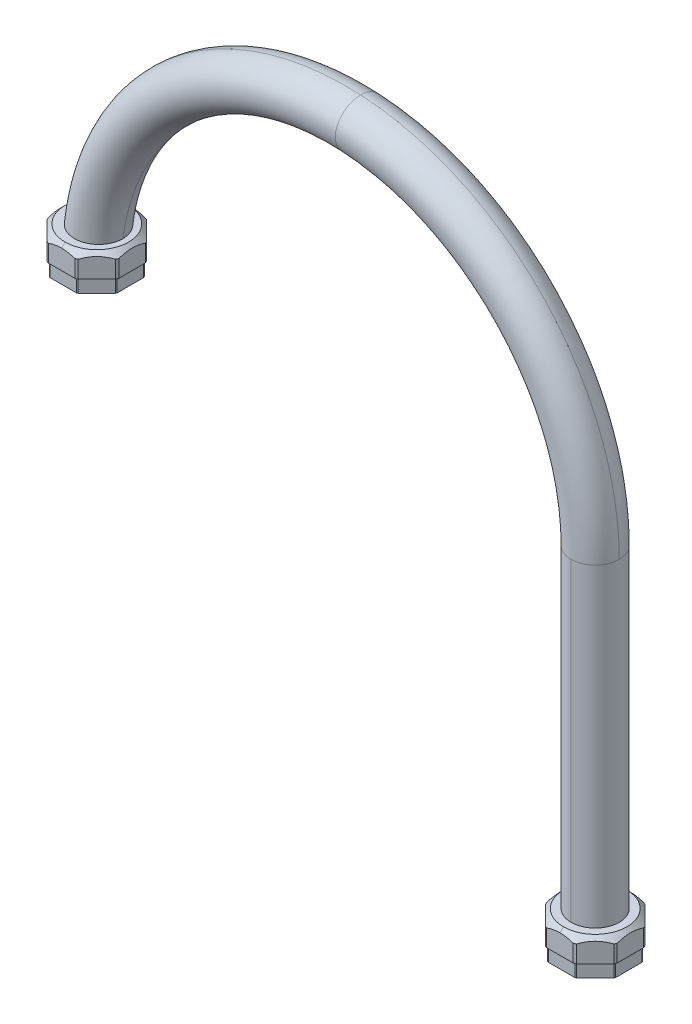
ISO-10303-21;
HEADER;
FILE_DESCRIPTION(('STEP AP214'),'2;1');
FILE_NAME('part.step','',(''),(''),'','','');
FILE_SCHEMA(('AUTOMOTIVE_DESIGN { 1 0 10303 214 1 1 1 1 }'));
ENDSEC;
DATA;
#1=APPLICATION_CONTEXT('core data for automotive mechanical design processes');
#2=APPLICATION_PROTOCOL_DEFINITION('international standard','automotive_design',2000,#1);
#3=PRODUCT_CONTEXT('',#1,'mechanical');
#4=PRODUCT('Part','Part','',(#3));
#5=PRODUCT_RELATED_PRODUCT_CATEGORY('part','',(#4));
#6=PRODUCT_DEFINITION_FORMATION('','',#4);
#7=PRODUCT_DEFINITION_CONTEXT('part definition',#1,'design');
#8=PRODUCT_DEFINITION('design','',#6,#7);
#9=PRODUCT_DEFINITION_SHAPE('','',#8);
#10=(LENGTH_UNIT() NAMED_UNIT(*) SI_UNIT(.MILLI.,.METRE.));
#11=(NAMED_UNIT(*) PLANE_ANGLE_UNIT() SI_UNIT($,.RADIAN.));
#12=(NAMED_UNIT(*) SI_UNIT($,.STERADIAN.) SOLID_ANGLE_UNIT());
#13=UNCERTAINTY_MEASURE_WITH_UNIT(LENGTH_MEASURE(1.E-05),#10,'distance_accuracy_value','');
#14=(GEOMETRIC_REPRESENTATION_CONTEXT(3) GLOBAL_UNCERTAINTY_ASSIGNED_CONTEXT((#13)) GLOBAL_UNIT_ASSIGNED_CONTEXT((#10,
#11,#12)) REPRESENTATION_CONTEXT('',''));
#15=CARTESIAN_POINT('',(0.,0.,0.));
#16=DIRECTION('',(0.,0.,1.));
#17=DIRECTION('',(1.,0.,0.));
#18=AXIS2_PLACEMENT_3D('',#15,#16,#17);
#19=CARTESIAN_POINT('',(-330.972,250.587,0.));
#20=DIRECTION('',(0.,-1.,0.));
#21=DIRECTION('',(0.,0.,-1.));
#22=AXIS2_PLACEMENT_3D('',#19,#20,#21);
#23=CONICAL_SURFACE('',#22,23.05,0.7853981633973);
#24=CARTESIAN_POINT('',(-330.972,248.637,0.));
#25=DIRECTION('',(0.,1.,0.));
#26=DIRECTION('',(0.936,0.,-0.352));
#27=AXIS2_PLACEMENT_3D('',#24,#25,#26);
#28=CIRCLE('',#27,25.);
#29=CARTESIAN_POINT('',(-307.572,248.637,-8.8));
#30=VERTEX_POINT('',#29);
#31=CARTESIAN_POINT('',(-308.2031616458,248.637,-10.32375900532));
#32=VERTEX_POINT('',#31);
#33=EDGE_CURVE('E10',#30,#32,#28,.T.);
#34=ORIENTED_EDGE('',*,*,#33,.T.);
#35=CARTESIAN_POINT('',(-308.2031616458,248.637,-10.32375900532));
#36=CARTESIAN_POINT('',(-308.3531819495,248.7116805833,-10.47377930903));
#37=CARTESIAN_POINT('',(-308.6523146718,248.8558440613,-10.77291203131));
#38=CARTESIAN_POINT('',(-309.0969650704,249.0558825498,-11.21756242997));
#39=CARTESIAN_POINT('',(-309.5415986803,249.2413270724,-11.66219603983));
#40=CARTESIAN_POINT('',(-309.9808698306,249.4098611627,-12.10146719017));
#41=CARTESIAN_POINT('',(-310.4163494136,249.5622943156,-12.53694677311));
#42=CARTESIAN_POINT('',(-310.8471552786,249.6984234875,-12.96775263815));
#43=CARTESIAN_POINT('',(-311.2723627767,249.8182749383,-13.3929601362));
#44=CARTESIAN_POINT('',(-311.6952928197,249.9229862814,-13.8158901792));
#45=CARTESIAN_POINT('',(-312.117584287,250.0128999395,-14.23818164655));
#46=CARTESIAN_POINT('',(-312.5403363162,250.0880841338,-14.66093367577));
#47=CARTESIAN_POINT('',(-312.9633327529,250.1483057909,-15.08393011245));
#48=CARTESIAN_POINT('',(-313.3854009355,250.1933048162,-15.50599829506));
#49=CARTESIAN_POINT('',(-313.8044864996,250.2229903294,-15.92508385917));
#50=CARTESIAN_POINT('',(-314.2205601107,250.2376581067,-16.34115747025));
#51=CARTESIAN_POINT('',(-314.6357071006,250.2375709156,-16.7563044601));
#52=CARTESIAN_POINT('',(-315.0515254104,250.2227383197,-17.17212276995));
#53=CARTESIAN_POINT('',(-315.4699371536,250.1929484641,-17.59053451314));
#54=CARTESIAN_POINT('',(-315.8916557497,250.147853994,-18.01225310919));
#55=CARTESIAN_POINT('',(-316.3142300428,250.0875744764,-18.43482740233));
#56=CARTESIAN_POINT('',(-316.7370990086,250.0122622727,-18.85769636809));
#57=CARTESIAN_POINT('',(-317.159843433,249.9221323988,-19.28044079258));
#58=CARTESIAN_POINT('',(-317.5835704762,249.8170870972,-19.70416783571));
#59=CARTESIAN_POINT('',(-318.0099509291,249.6967263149,-20.13054828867));
#60=CARTESIAN_POINT('',(-318.4412030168,249.5602477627,-20.56180037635));
#61=CARTESIAN_POINT('',(-318.8767037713,249.4075863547,-20.99730113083));
#62=CARTESIAN_POINT('',(-319.3144453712,249.2394475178,-21.4350427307));
#63=CARTESIAN_POINT('',(-319.7573280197,249.05460796,-21.87792537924));
#64=CARTESIAN_POINT('',(-320.2000505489,248.8553784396,-22.3206479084));
#65=CARTESIAN_POINT('',(-320.498484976,248.7115490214,-22.61908233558));
#66=CARTESIAN_POINT('',(-320.6482409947,248.637,-22.76883835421));
#67=(BOUNDED_CURVE() B_SPLINE_CURVE(3,(#35,#36,#37,#38,#39,#40,#41,#42,#43,#44,#45,#46,#47,#48,
#49,#50,#51,#52,#53,#54,#55,#56,#57,#58,#59,#60,#61,#62,#63,#64,#65,#66),.UNSPECIFIED.,.F.,
.F.) B_SPLINE_CURVE_WITH_KNOTS((4,1,1,1,1,1,1,1,1,1,1,1,1,1,1,1,1,1,1,1,1,1,1,1,1,1,1,1,1,4),
(0.,0.03448275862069,0.06896551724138,0.1034482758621,0.1379310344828,0.1724137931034,
0.2068965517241,0.2413793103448,0.2758620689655,0.3103448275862,0.3448275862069,0.3793103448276,
0.4137931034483,0.448275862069,0.4827586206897,0.5172413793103,0.551724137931,0.5862068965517,
0.6206896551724,0.6551724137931,0.6896551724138,0.7241379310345,0.7586206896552,0.7931034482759,
0.8275862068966,0.8620689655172,0.8965517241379,0.9310344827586,0.9655172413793,1.),
.UNSPECIFIED.) CURVE() GEOMETRIC_REPRESENTATION_ITEM() RATIONAL_B_SPLINE_CURVE((1.,1.,1.,1.,1.,
1.,1.,1.,1.,1.,1.,1.,1.,1.,1.,1.,1.,1.,1.,1.,1.,1.,1.,1.,1.,1.,1.,1.,1.,1.,1.,1.)) REPRESENTATION_ITEM(''));
#68=CARTESIAN_POINT('',(-320.6482409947,248.637,-22.76883835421));
#69=VERTEX_POINT('',#68);
#70=EDGE_CURVE('E28',#32,#69,#67,.T.);
#71=ORIENTED_EDGE('',*,*,#70,.T.);
#72=CARTESIAN_POINT('',(-330.972,248.637,0.));
#73=DIRECTION('',(0.,1.,0.));
#74=DIRECTION('',(0.412950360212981,0.,-0.910753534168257));
#75=AXIS2_PLACEMENT_3D('',#72,#73,#74);
#76=CIRCLE('',#75,25.);
#77=CARTESIAN_POINT('',(-322.172,248.637,-23.4));
#78=VERTEX_POINT('',#77);
#79=EDGE_CURVE('E747',#69,#78,#76,.T.);
#80=ORIENTED_EDGE('',*,*,#79,.T.);
#81=CARTESIAN_POINT('',(-322.172,248.637,-23.4));
#82=CARTESIAN_POINT('',(-322.3746314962,248.7083262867,-23.4));
#83=CARTESIAN_POINT('',(-322.7798109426,248.8466354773,-23.4));
#84=CARTESIAN_POINT('',(-323.38802405,249.0409605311,-23.4));
#85=CARTESIAN_POINT('',(-323.9950089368,249.2213036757,-23.4));
#86=CARTESIAN_POINT('',(-324.5988375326,249.3869621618,-23.39999999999));
#87=CARTESIAN_POINT('',(-325.2009736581,249.538213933,-23.40000000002));
#88=CARTESIAN_POINT('',(-325.7976636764,249.6740633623,-23.39999999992));
#89=CARTESIAN_POINT('',(-326.3864321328,249.7942533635,-23.40000000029));
#90=CARTESIAN_POINT('',(-326.9732560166,249.9001204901,-23.3999999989));
#91=CARTESIAN_POINT('',(-327.5533638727,249.9908906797,-23.4000000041));
#92=CARTESIAN_POINT('',(-328.1277990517,250.0670648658,-23.39999998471));
#93=CARTESIAN_POINT('',(-328.6988498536,250.1291312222,-23.40000005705));
#94=CARTESIAN_POINT('',(-329.2684018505,250.1773578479,-23.3999997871));
#95=CARTESIAN_POINT('',(-329.8366254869,250.2117497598,-23.40000079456));
#96=CARTESIAN_POINT('',(-330.4027293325,250.2323714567,-23.39999703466));
#97=CARTESIAN_POINT('',(-330.7821026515,250.2369872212,-23.40000638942));
#98=CARTESIAN_POINT('',(-330.9719999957,250.2369872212,-23.40000638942));
#99=(BOUNDED_CURVE() B_SPLINE_CURVE(3,(#81,#82,#83,#84,#85,#86,#87,#88,#89,#90,#91,#92,#93,#94,
#95,#96,#97,#98),.UNSPECIFIED.,.F.,.F.) B_SPLINE_CURVE_WITH_KNOTS((4,1,1,1,1,1,1,1,1,1,1,1,1,1,
1,4),(0.,0.06666666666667,0.1333333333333,0.2,0.2666666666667,0.3333333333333,0.4,
0.4666666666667,0.5333333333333,0.6,0.6666666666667,0.7333333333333,0.8,0.8666666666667,
0.9333333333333,1.),
.UNSPECIFIED.) CURVE() GEOMETRIC_REPRESENTATION_ITEM() RATIONAL_B_SPLINE_CURVE((1.,1.,1.,1.,1.,
1.,1.,1.,1.,1.,1.,1.,1.,1.,1.,1.,1.,1.)) REPRESENTATION_ITEM(''));
#100=CARTESIAN_POINT('',(-330.9719999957,250.2369872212,-23.40000638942));
#101=VERTEX_POINT('',#100);
#102=EDGE_CURVE('E741',#78,#101,#99,.T.);
#103=ORIENTED_EDGE('',*,*,#102,.T.);
#104=DIRECTION('',(1.31326682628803E-09,-0.707107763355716,-0.707105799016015));
#105=VECTOR('',#104,1.);
#106=CARTESIAN_POINT('',(-330.972,252.537,-21.1));
#107=LINE('',#106,#105);
#108=CARTESIAN_POINT('',(-330.972,252.537,-21.1));
#109=VERTEX_POINT('',#108);
#110=EDGE_CURVE('E1183',#109,#101,#107,.T.);
#111=ORIENTED_EDGE('',*,*,#110,.F.);
#112=CARTESIAN_POINT('',(-330.972,252.537,0.));
#113=DIRECTION('',(0.,1.,0.));
#114=DIRECTION('',(0.,0.,1.));
#115=AXIS2_PLACEMENT_3D('',#112,#113,#114);
#116=CIRCLE('',#115,21.1);
#117=CARTESIAN_POINT('',(-330.972,252.537,21.1));
#118=VERTEX_POINT('',#117);
#119=EDGE_CURVE('E1033',#118,#109,#116,.T.);
#120=ORIENTED_EDGE('',*,*,#119,.F.);
#121=DIRECTION('',(-1.31326865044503E-09,-0.707107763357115,0.707105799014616));
#122=VECTOR('',#121,1.);
#123=CARTESIAN_POINT('',(-330.972,252.537,21.1));
#124=LINE('',#123,#122);
#125=CARTESIAN_POINT('',(-330.9720000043,250.2369904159,23.40000319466));
#126=VERTEX_POINT('',#125);
#127=EDGE_CURVE('E748',#118,#126,#124,.T.);
#128=ORIENTED_EDGE('',*,*,#127,.T.);
#129=CARTESIAN_POINT('',(-330.9720000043,250.2369904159,23.40000319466));
#130=CARTESIAN_POINT('',(-330.8730017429,250.2369904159,23.40000319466));
#131=CARTESIAN_POINT('',(-330.6748479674,250.2357476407,23.39999851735));
#132=CARTESIAN_POINT('',(-330.3772329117,250.2300727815,23.40000039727));
#133=CARTESIAN_POINT('',(-330.0789711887,250.2205998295,23.39999989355));
#134=CARTESIAN_POINT('',(-329.779857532,250.2072889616,23.40000002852));
#135=CARTESIAN_POINT('',(-329.4797543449,250.1901064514,23.39999999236));
#136=CARTESIAN_POINT('',(-329.1789706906,250.1690447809,23.40000000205));
#137=CARTESIAN_POINT('',(-328.8777459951,250.1441103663,23.39999999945));
#138=CARTESIAN_POINT('',(-328.5762834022,250.1153191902,23.40000000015));
#139=CARTESIAN_POINT('',(-328.2747444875,250.0826953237,23.39999999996));
#140=CARTESIAN_POINT('',(-327.9731470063,250.0462542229,23.40000000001));
#141=CARTESIAN_POINT('',(-327.6716854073,250.0060366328,23.4));
#142=CARTESIAN_POINT('',(-327.3709169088,249.9621521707,23.4));
#143=CARTESIAN_POINT('',(-327.0707503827,249.9146364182,23.4));
#144=CARTESIAN_POINT('',(-326.7704754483,249.8634083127,23.4));
#145=CARTESIAN_POINT('',(-326.4698853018,249.8084464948,23.4));
#146=CARTESIAN_POINT('',(-326.1689682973,249.7497624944,23.4));
#147=CARTESIAN_POINT('',(-325.8678002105,249.6873862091,23.4));
#148=CARTESIAN_POINT('',(-325.5667094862,249.6214120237,23.4));
#149=CARTESIAN_POINT('',(-325.2652082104,249.5517603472,23.4));
#150=CARTESIAN_POINT('',(-324.9624480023,249.4782351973,23.4));
#151=CARTESIAN_POINT('',(-324.6583141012,249.4007922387,23.4));
#152=CARTESIAN_POINT('',(-324.3528855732,249.3194393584,23.4));
#153=CARTESIAN_POINT('',(-324.0460432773,249.234133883,23.4));
#154=CARTESIAN_POINT('',(-323.7376364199,249.1448190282,23.4));
#155=CARTESIAN_POINT('',(-323.4276664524,249.051479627,23.4));
#156=CARTESIAN_POINT('',(-323.1161561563,248.9541098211,23.4));
#157=CARTESIAN_POINT('',(-322.8030961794,248.8526960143,23.4));
#158=CARTESIAN_POINT('',(-322.4884729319,248.7472245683,23.4));
#159=CARTESIAN_POINT('',(-322.2776661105,248.6741944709,23.4));
#160=CARTESIAN_POINT('',(-322.172,248.637,23.4));
#161=(BOUNDED_CURVE() B_SPLINE_CURVE(3,(#129,#130,#131,#132,#133,#134,#135,#136,#137,#138,#139,
#140,#141,#142,#143,#144,#145,#146,#147,#148,#149,#150,#151,#152,#153,#154,#155,#156,#157,#158,
#159,#160),.UNSPECIFIED.,.F.,.F.) B_SPLINE_CURVE_WITH_KNOTS((4,1,1,1,1,1,1,1,1,1,1,1,1,1,1,1,1,
1,1,1,1,1,1,1,1,1,1,1,1,4),(0.,0.03448275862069,0.06896551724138,0.1034482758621,
0.1379310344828,0.1724137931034,0.2068965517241,0.2413793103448,0.2758620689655,0.3103448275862,
0.3448275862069,0.3793103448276,0.4137931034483,0.448275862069,0.4827586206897,0.5172413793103,
0.551724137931,0.5862068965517,0.6206896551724,0.6551724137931,0.6896551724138,0.7241379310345,
0.7586206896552,0.7931034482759,0.8275862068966,0.8620689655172,0.8965517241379,0.9310344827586,
0.9655172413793,1.),
.UNSPECIFIED.) CURVE() GEOMETRIC_REPRESENTATION_ITEM() RATIONAL_B_SPLINE_CURVE((1.,1.,1.,1.,1.,
1.,1.,1.,1.,1.,1.,1.,1.,1.,1.,1.,1.,1.,1.,1.,1.,1.,1.,1.,1.,1.,1.,1.,1.,1.,1.,1.)) REPRESENTATION_ITEM(''));
#162=CARTESIAN_POINT('',(-322.172,248.637,23.4));
#163=VERTEX_POINT('',#162);
#164=EDGE_CURVE('E1152',#126,#163,#161,.T.);
#165=ORIENTED_EDGE('',*,*,#164,.T.);
#166=CARTESIAN_POINT('',(-330.972,248.637,0.));
#167=DIRECTION('',(0.,1.,0.));
#168=DIRECTION('',(0.352,0.,0.936));
#169=AXIS2_PLACEMENT_3D('',#166,#167,#168);
#170=CIRCLE('',#169,25.);
#171=CARTESIAN_POINT('',(-320.6482409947,248.637,22.76883835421));
#172=VERTEX_POINT('',#171);
#173=EDGE_CURVE('E898',#163,#172,#170,.T.);
#174=ORIENTED_EDGE('',*,*,#173,.T.);
#175=CARTESIAN_POINT('',(-320.6482409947,248.637,22.76883835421));
#176=CARTESIAN_POINT('',(-320.498220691,248.7116805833,22.6188180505));
#177=CARTESIAN_POINT('',(-320.1990879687,248.8558440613,22.31968532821));
#178=CARTESIAN_POINT('',(-319.75443757,249.0558825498,21.87503492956));
#179=CARTESIAN_POINT('',(-319.3098039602,249.2413270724,21.4304013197));
#180=CARTESIAN_POINT('',(-318.8705328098,249.4098611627,20.99113016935));
#181=CARTESIAN_POINT('',(-318.4350532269,249.5622943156,20.5556505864));
#182=CARTESIAN_POINT('',(-318.0042473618,249.6984234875,20.12484472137));
#183=CARTESIAN_POINT('',(-317.5790398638,249.8182749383,19.69963722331));
#184=CARTESIAN_POINT('',(-317.1561098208,249.9229862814,19.27670718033));
#185=CARTESIAN_POINT('',(-316.7338183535,250.0128999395,18.85441571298));
#186=CARTESIAN_POINT('',(-316.3110663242,250.0880841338,18.43166368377));
#187=CARTESIAN_POINT('',(-315.8880698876,250.1483057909,18.0086672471));
#188=CARTESIAN_POINT('',(-315.466001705,250.1933048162,17.58659906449));
#189=CARTESIAN_POINT('',(-315.0469161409,250.2229903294,17.16751350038));
#190=CARTESIAN_POINT('',(-314.6308425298,250.2376581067,16.7514398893));
#191=CARTESIAN_POINT('',(-314.2156955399,250.2375709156,16.33629289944));
#192=CARTESIAN_POINT('',(-313.7998772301,250.2227383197,15.92047458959));
#193=CARTESIAN_POINT('',(-313.3814654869,250.1929484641,15.5020628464));
#194=CARTESIAN_POINT('',(-312.9597468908,250.147853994,15.08034425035));
#195=CARTESIAN_POINT('',(-312.5371725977,250.0875744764,14.65776995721));
#196=CARTESIAN_POINT('',(-312.1143036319,250.0122622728,14.23490099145));
#197=CARTESIAN_POINT('',(-311.6915592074,249.9221323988,13.81215656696));
#198=CARTESIAN_POINT('',(-311.2678321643,249.8170870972,13.38842952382));
#199=CARTESIAN_POINT('',(-310.8414517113,249.6967263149,12.96204907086));
#200=CARTESIAN_POINT('',(-310.4101996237,249.5602477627,12.53079698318));
#201=CARTESIAN_POINT('',(-309.9746988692,249.4075863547,12.0952962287));
#202=CARTESIAN_POINT('',(-309.5369572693,249.2394475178,11.65755462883));
#203=CARTESIAN_POINT('',(-309.0940746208,249.05460796,11.21467198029));
#204=CARTESIAN_POINT('',(-308.6513520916,248.8553784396,10.77194945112));
#205=CARTESIAN_POINT('',(-308.3529176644,248.7115490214,10.47351502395));
#206=CARTESIAN_POINT('',(-308.2031616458,248.637,10.32375900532));
#207=(BOUNDED_CURVE() B_SPLINE_CURVE(3,(#175,#176,#177,#178,#179,#180,#181,#182,#183,#184,#185,
#186,#187,#188,#189,#190,#191,#192,#193,#194,#195,#196,#197,#198,#199,#200,#201,#202,#203,#204,
#205,#206),.UNSPECIFIED.,.F.,.F.) B_SPLINE_CURVE_WITH_KNOTS((4,1,1,1,1,1,1,1,1,1,1,1,1,1,1,1,1,
1,1,1,1,1,1,1,1,1,1,1,1,4),(0.,0.03448275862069,0.06896551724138,0.1034482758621,
0.1379310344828,0.1724137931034,0.2068965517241,0.2413793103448,0.2758620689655,0.3103448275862,
0.3448275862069,0.3793103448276,0.4137931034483,0.448275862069,0.4827586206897,0.5172413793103,
0.551724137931,0.5862068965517,0.6206896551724,0.6551724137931,0.6896551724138,0.7241379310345,
0.7586206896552,0.7931034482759,0.8275862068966,0.8620689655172,0.8965517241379,0.9310344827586,
0.9655172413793,1.),
.UNSPECIFIED.) CURVE() GEOMETRIC_REPRESENTATION_ITEM() RATIONAL_B_SPLINE_CURVE((1.,1.,1.,1.,1.,
1.,1.,1.,1.,1.,1.,1.,1.,1.,1.,1.,1.,1.,1.,1.,1.,1.,1.,1.,1.,1.,1.,1.,1.,1.,1.,1.)) REPRESENTATION_ITEM(''));
#208=CARTESIAN_POINT('',(-308.2031616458,248.637,10.32375900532));
#209=VERTEX_POINT('',#208);
#210=EDGE_CURVE('E892',#172,#209,#207,.T.);
#211=ORIENTED_EDGE('',*,*,#210,.T.);
#212=CARTESIAN_POINT('',(-330.972,248.637,0.));
#213=DIRECTION('',(0.,1.,0.));
#214=DIRECTION('',(0.910753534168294,0.,0.412950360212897));
#215=AXIS2_PLACEMENT_3D('',#212,#213,#214);
#216=CIRCLE('',#215,25.);
#217=CARTESIAN_POINT('',(-307.572,248.637,8.8));
#218=VERTEX_POINT('',#217);
#219=EDGE_CURVE('E833',#209,#218,#216,.T.);
#220=ORIENTED_EDGE('',*,*,#219,.T.);
#221=CARTESIAN_POINT('',(-307.572,248.637,8.8));
#222=CARTESIAN_POINT('',(-307.572,248.6744024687,8.693742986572));
#223=CARTESIAN_POINT('',(-307.572,248.7478042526,8.481841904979));
#224=CARTESIAN_POINT('',(-307.572,248.8536701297,8.165961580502));
#225=CARTESIAN_POINT('',(-307.572,248.9554409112,7.851676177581));
#226=CARTESIAN_POINT('',(-307.572,249.0532045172,7.538731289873));
#227=CARTESIAN_POINT('',(-307.572,249.1470446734,7.226853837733));
#228=CARTESIAN_POINT('',(-307.572,249.2369823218,6.915953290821));
#229=CARTESIAN_POINT('',(-307.572,249.3230359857,6.605938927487));
#230=CARTESIAN_POINT('',(-307.572,249.4051752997,6.296897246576));
#231=CARTESIAN_POINT('',(-307.572,249.4833771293,5.988912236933));
#232=CARTESIAN_POINT('',(-307.572,249.5576412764,5.681994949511));
#233=CARTESIAN_POINT('',(-307.572,249.6279707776,5.376150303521));
#234=CARTESIAN_POINT('',(-307.572,249.6943476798,5.071491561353));
#235=CARTESIAN_POINT('',(-307.572,249.7567627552,4.768129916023));
#236=CARTESIAN_POINT('',(-307.572,249.8152490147,4.465990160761));
#237=CARTESIAN_POINT('',(-307.572,249.8698428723,4.164965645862));
#238=CARTESIAN_POINT('',(-307.572,249.9205890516,3.864879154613));
#239=CARTESIAN_POINT('',(-307.572,249.9675248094,3.565554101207));
#240=CARTESIAN_POINT('',(-307.572,250.0106684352,3.26690164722));
#241=CARTESIAN_POINT('',(-307.572,250.0500350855,2.968839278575));
#242=CARTESIAN_POINT('',(-307.572,250.0856381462,2.671280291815));
#243=CARTESIAN_POINT('',(-307.572,250.1174886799,2.37413256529));
#244=CARTESIAN_POINT('',(-307.572,250.1455848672,2.077415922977));
#245=CARTESIAN_POINT('',(-307.572,250.1699279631,1.781156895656));
#246=CARTESIAN_POINT('',(-307.572,250.1905316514,1.485237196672));
#247=CARTESIAN_POINT('',(-307.572,250.2074049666,1.189526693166));
#248=CARTESIAN_POINT('',(-307.572,250.2205438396,0.8941076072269));
#249=CARTESIAN_POINT('',(-307.572,250.2299515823,0.5990722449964));
#250=CARTESIAN_POINT('',(-307.572,250.2356409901,0.3042382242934));
#251=CARTESIAN_POINT('',(-307.572,250.2376179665,0.009420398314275));
#252=CARTESIAN_POINT('',(-307.572,250.235876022,-0.2860357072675));
#253=CARTESIAN_POINT('',(-307.572,250.2303732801,-0.5827817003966));
#254=CARTESIAN_POINT('',(-307.572,250.2210645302,-0.8807401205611));
#255=CARTESIAN_POINT('',(-307.572,250.2079120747,-1.179830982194));
#256=CARTESIAN_POINT('',(-307.572,250.190895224,-1.479786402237));
#257=CARTESIAN_POINT('',(-307.572,250.1700095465,-1.780346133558));
#258=CARTESIAN_POINT('',(-307.572,250.1452527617,-2.081394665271));
#259=CARTESIAN_POINT('',(-307.572,250.1166306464,-2.382807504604));
#260=CARTESIAN_POINT('',(-307.572,250.0841645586,-2.684397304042));
#261=CARTESIAN_POINT('',(-307.572,250.0478870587,-2.985978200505));
#262=CARTESIAN_POINT('',(-307.572,250.0078507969,-3.287297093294));
#263=CARTESIAN_POINT('',(-307.572,249.9641182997,-3.588144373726));
#264=CARTESIAN_POINT('',(-307.572,249.9166676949,-3.888897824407));
#265=CARTESIAN_POINT('',(-307.572,249.8654664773,-4.189878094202));
#266=CARTESIAN_POINT('',(-307.572,249.810557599,-4.490934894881));
#267=CARTESIAN_POINT('',(-307.572,249.7519780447,-4.792001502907));
#268=CARTESIAN_POINT('',(-307.572,249.6897400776,-5.093145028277));
#269=CARTESIAN_POINT('',(-307.572,249.6238478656,-5.394466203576));
#270=CARTESIAN_POINT('',(-307.572,249.554184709,-5.69656277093));
#271=CARTESIAN_POINT('',(-307.572,249.480622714,-5.999956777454));
#272=CARTESIAN_POINT('',(-307.572,249.4031394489,-6.304679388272));
#273=CARTESIAN_POINT('',(-307.572,249.321707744,-6.610787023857));
#274=CARTESIAN_POINT('',(-307.572,249.2362630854,-6.918463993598));
#275=CARTESIAN_POINT('',(-307.572,249.1467373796,-7.22788058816));
#276=CARTESIAN_POINT('',(-307.572,249.0531325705,-7.538959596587));
#277=CARTESIAN_POINT('',(-307.572,248.9554545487,-7.851632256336));
#278=CARTESIAN_POINT('',(-307.572,248.8536760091,-8.165945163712));
#279=CARTESIAN_POINT('',(-307.572,248.7477684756,-8.481947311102));
#280=CARTESIAN_POINT('',(-307.572,248.6743859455,-8.693789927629));
#281=CARTESIAN_POINT('',(-307.572,248.637,-8.8));
#282=(BOUNDED_CURVE() B_SPLINE_CURVE(3,(#221,#222,#223,#224,#225,#226,#227,#228,#229,#230,#231,
#232,#233,#234,#235,#236,#237,#238,#239,#240,#241,#242,#243,#244,#245,#246,#247,#248,#249,#250,
#251,#252,#253,#254,#255,#256,#257,#258,#259,#260,#261,#262,#263,#264,#265,#266,#267,#268,#269,
#270,#271,#272,#273,#274,#275,#276,#277,#278,#279,#280,#281),.UNSPECIFIED.,.F.,
.F.) B_SPLINE_CURVE_WITH_KNOTS((4,1,1,1,1,1,1,1,1,1,1,1,1,1,1,1,1,1,1,1,1,1,1,1,1,1,1,1,1,1,1,1,
1,1,1,1,1,1,1,1,1,1,1,1,1,1,1,1,1,1,1,1,1,1,1,1,1,1,4),(0.,0.01724137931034,0.03448275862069,
0.05172413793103,0.06896551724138,0.08620689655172,0.1034482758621,0.1206896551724,
0.1379310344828,0.1551724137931,0.1724137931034,0.1896551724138,0.2068965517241,0.2241379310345,
0.2413793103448,0.2586206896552,0.2758620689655,0.2931034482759,0.3103448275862,0.3275862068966,
0.3448275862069,0.3620689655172,0.3793103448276,0.3965517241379,0.4137931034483,0.4310344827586,
0.448275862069,0.4655172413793,0.4827586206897,0.5,0.5172413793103,0.5344827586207,
0.551724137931,0.5689655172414,0.5862068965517,0.6034482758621,0.6206896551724,0.6379310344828,
0.6551724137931,0.6724137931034,0.6896551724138,0.7068965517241,0.7241379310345,0.7413793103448,
0.7586206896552,0.7758620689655,0.7931034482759,0.8103448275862,0.8275862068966,0.8448275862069,
0.8620689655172,0.8793103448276,0.8965517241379,0.9137931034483,0.9310344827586,0.948275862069,
0.9655172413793,0.9827586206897,1.),
.UNSPECIFIED.) CURVE() GEOMETRIC_REPRESENTATION_ITEM() RATIONAL_B_SPLINE_CURVE((1.,1.,1.,1.,1.,
1.,1.,1.,1.,1.,1.,1.,1.,1.,1.,1.,1.,1.,1.,1.,1.,1.,1.,1.,1.,1.,1.,1.,1.,1.,1.,1.,1.,1.,1.,1.,1.,
1.,1.,1.,1.,1.,1.,1.,1.,1.,1.,1.,1.,1.,1.,1.,1.,1.,1.,1.,1.,1.,1.,1.,1.)) REPRESENTATION_ITEM(''));
#283=EDGE_CURVE('E828',#218,#30,#282,.T.);
#284=ORIENTED_EDGE('',*,*,#283,.T.);
#285=EDGE_LOOP('',(#34,#71,#80,#103,#111,#120,#128,#165,#174,#211,#220,#284));
#286=FACE_BOUND('',#285,.T.);
#287=ADVANCED_FACE('F15',(#286),#23,.T.);
#288=CARTESIAN_POINT('',(-307.572,237.237,9.69259735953));
#289=DIRECTION('',(1.,0.,0.));
#290=DIRECTION('',(0.,1.,0.));
#291=AXIS2_PLACEMENT_3D('',#288,#289,#290);
#292=PLANE('',#291);
#293=DIRECTION('',(0.,0.,1.));
#294=VECTOR('',#293,1.);
#295=CARTESIAN_POINT('',(-307.572,237.237,-8.8));
#296=LINE('',#295,#294);
#297=CARTESIAN_POINT('',(-307.572,237.237,-8.8));
#298=VERTEX_POINT('',#297);
#299=CARTESIAN_POINT('',(-307.572,237.237,8.8));
#300=VERTEX_POINT('',#299);
#301=EDGE_CURVE('E1061',#298,#300,#296,.T.);
#302=ORIENTED_EDGE('',*,*,#301,.F.);
#303=DIRECTION('',(0.,-1.,0.));
#304=VECTOR('',#303,1.);
#305=CARTESIAN_POINT('',(-307.572,248.637,-8.8));
#306=LINE('',#305,#304);
#307=EDGE_CURVE('E1044',#30,#298,#306,.T.);
#308=ORIENTED_EDGE('',*,*,#307,.F.);
#309=ORIENTED_EDGE('',*,*,#283,.F.);
#310=DIRECTION('',(0.,1.,0.));
#311=VECTOR('',#310,1.);
#312=CARTESIAN_POINT('',(-307.572,237.237,8.8));
#313=LINE('',#312,#311);
#314=EDGE_CURVE('E1184',#300,#218,#313,.T.);
#315=ORIENTED_EDGE('',*,*,#314,.F.);
#316=EDGE_LOOP('',(#302,#308,#309,#315));
#317=FACE_BOUND('',#316,.T.);
#318=ADVANCED_FACE('F1723',(#317),#292,.T.);
#319=CARTESIAN_POINT('',(-330.972,228.298,0.));
#320=DIRECTION('',(0.,-1.,0.));
#321=DIRECTION('',(0.,0.,-1.));
#322=AXIS2_PLACEMENT_3D('',#319,#320,#321);
#323=CYLINDRICAL_SURFACE('',#322,25.);
#324=ORIENTED_EDGE('',*,*,#219,.F.);
#325=DIRECTION('',(0.,-1.,0.));
#326=VECTOR('',#325,1.);
#327=CARTESIAN_POINT('',(-308.2031616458,248.637,10.32375900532));
#328=LINE('',#327,#326);
#329=CARTESIAN_POINT('',(-308.2031616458,237.237,10.32375900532));
#330=VERTEX_POINT('',#329);
#331=EDGE_CURVE('E834',#209,#330,#328,.T.);
#332=ORIENTED_EDGE('',*,*,#331,.T.);
#333=CARTESIAN_POINT('',(-330.972,237.237,0.));
#334=DIRECTION('',(0.,-1.,0.));
#335=DIRECTION('',(0.936,0.,0.352));
#336=AXIS2_PLACEMENT_3D('',#333,#334,#335);
#337=CIRCLE('',#336,25.);
#338=EDGE_CURVE('E1058',#300,#330,#337,.T.);
#339=ORIENTED_EDGE('',*,*,#338,.F.);
#340=ORIENTED_EDGE('',*,*,#314,.T.);
#341=EDGE_LOOP('',(#324,#332,#339,#340));
#342=FACE_BOUND('',#341,.T.);
#343=ADVANCED_FACE('F1727',(#342),#323,.T.);
#344=CARTESIAN_POINT('',(-305.972,237.237,0.));
#345=DIRECTION('',(0.,1.,0.));
#346=DIRECTION('',(1.,0.,0.));
#347=AXIS2_PLACEMENT_3D('',#344,#345,#346);
#348=PLANE('',#347);
#349=CARTESIAN_POINT('',(-330.972,237.237,0.));
#350=DIRECTION('',(0.,-1.,0.));
#351=DIRECTION('',(-0.412950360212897,0.,-0.910753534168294));
#352=AXIS2_PLACEMENT_3D('',#349,#350,#351);
#353=CIRCLE('',#352,25.);
#354=CARTESIAN_POINT('',(-341.2957590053,237.237,-22.76883835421));
#355=VERTEX_POINT('',#354);
#356=CARTESIAN_POINT('',(-339.772,237.237,-23.4));
#357=VERTEX_POINT('',#356);
#358=EDGE_CURVE('E986',#355,#357,#353,.T.);
#359=ORIENTED_EDGE('',*,*,#358,.T.);
#360=DIRECTION('',(1.,0.,0.));
#361=VECTOR('',#360,1.);
#362=CARTESIAN_POINT('',(-339.772,237.237,-23.4));
#363=LINE('',#362,#361);
#364=CARTESIAN_POINT('',(-322.172,237.237,-23.4));
#365=VERTEX_POINT('',#364);
#366=EDGE_CURVE('E982',#357,#365,#363,.T.);
#367=ORIENTED_EDGE('',*,*,#366,.T.);
#368=CARTESIAN_POINT('',(-330.972,237.237,0.));
#369=DIRECTION('',(0.,-1.,0.));
#370=DIRECTION('',(0.352,0.,-0.936));
#371=AXIS2_PLACEMENT_3D('',#368,#369,#370);
#372=CIRCLE('',#371,25.);
#373=CARTESIAN_POINT('',(-320.6482409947,237.237,-22.76883835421));
#374=VERTEX_POINT('',#373);
#375=EDGE_CURVE('E987',#365,#374,#372,.T.);
#376=ORIENTED_EDGE('',*,*,#375,.T.);
#377=DIRECTION('',(0.707106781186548,0.,0.707106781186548));
#378=VECTOR('',#377,1.);
#379=CARTESIAN_POINT('',(-320.6482409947,237.237,-22.76883835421));
#380=LINE('',#379,#378);
#381=CARTESIAN_POINT('',(-308.2031616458,237.237,-10.32375900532));
#382=VERTEX_POINT('',#381);
#383=EDGE_CURVE('E1260',#374,#382,#380,.T.);
#384=ORIENTED_EDGE('',*,*,#383,.T.);
#385=CARTESIAN_POINT('',(-330.972,237.237,0.));
#386=DIRECTION('',(0.,-1.,0.));
#387=DIRECTION('',(0.910753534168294,0.,-0.412950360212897));
#388=AXIS2_PLACEMENT_3D('',#385,#386,#387);
#389=CIRCLE('',#388,25.);
#390=EDGE_CURVE('E1256',#382,#298,#389,.T.);
#391=ORIENTED_EDGE('',*,*,#390,.T.);
#392=ORIENTED_EDGE('',*,*,#301,.T.);
#393=ORIENTED_EDGE('',*,*,#338,.T.);
#394=DIRECTION('',(-0.707106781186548,0.,0.707106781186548));
#395=VECTOR('',#394,1.);
#396=CARTESIAN_POINT('',(-308.2031616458,237.237,10.32375900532));
#397=LINE('',#396,#395);
#398=CARTESIAN_POINT('',(-320.6482409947,237.237,22.76883835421));
#399=VERTEX_POINT('',#398);
#400=EDGE_CURVE('E1062',#330,#399,#397,.T.);
#401=ORIENTED_EDGE('',*,*,#400,.T.);
#402=CARTESIAN_POINT('',(-330.972,237.237,0.));
#403=DIRECTION('',(0.,-1.,0.));
#404=DIRECTION('',(0.412950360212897,0.,0.910753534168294));
#405=AXIS2_PLACEMENT_3D('',#402,#403,#404);
#406=CIRCLE('',#405,25.);
#407=CARTESIAN_POINT('',(-322.172,237.237,23.4));
#408=VERTEX_POINT('',#407);
#409=EDGE_CURVE('E966',#399,#408,#406,.T.);
#410=ORIENTED_EDGE('',*,*,#409,.T.);
#411=DIRECTION('',(-1.,0.,0.));
#412=VECTOR('',#411,1.);
#413=CARTESIAN_POINT('',(-322.172,237.237,23.4));
#414=LINE('',#413,#412);
#415=CARTESIAN_POINT('',(-339.772,237.237,23.4));
#416=VERTEX_POINT('',#415);
#417=EDGE_CURVE('E920',#408,#416,#414,.T.);
#418=ORIENTED_EDGE('',*,*,#417,.T.);
#419=CARTESIAN_POINT('',(-330.972,237.237,0.));
#420=DIRECTION('',(0.,-1.,0.));
#421=DIRECTION('',(-0.352,0.,0.936));
#422=AXIS2_PLACEMENT_3D('',#419,#420,#421);
#423=CIRCLE('',#422,25.);
#424=CARTESIAN_POINT('',(-341.2957590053,237.237,22.76883835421));
#425=VERTEX_POINT('',#424);
#426=EDGE_CURVE('E916',#416,#425,#423,.T.);
#427=ORIENTED_EDGE('',*,*,#426,.T.);
#428=DIRECTION('',(-0.707106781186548,0.,-0.707106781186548));
#429=VECTOR('',#428,1.);
#430=CARTESIAN_POINT('',(-341.2957590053,237.237,22.76883835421));
#431=LINE('',#430,#429);
#432=CARTESIAN_POINT('',(-353.7408383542,237.237,10.32375900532));
#433=VERTEX_POINT('',#432);
#434=EDGE_CURVE('E921',#425,#433,#431,.T.);
#435=ORIENTED_EDGE('',*,*,#434,.T.);
#436=CARTESIAN_POINT('',(-330.972,237.237,0.));
#437=DIRECTION('',(0.,-1.,0.));
#438=DIRECTION('',(-0.910753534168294,0.,0.412950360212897));
#439=AXIS2_PLACEMENT_3D('',#436,#437,#438);
#440=CIRCLE('',#439,25.);
#441=CARTESIAN_POINT('',(-354.372,237.237,8.8));
#442=VERTEX_POINT('',#441);
#443=EDGE_CURVE('E1097',#433,#442,#440,.T.);
#444=ORIENTED_EDGE('',*,*,#443,.T.);
#445=DIRECTION('',(0.,0.,-1.));
#446=VECTOR('',#445,1.);
#447=CARTESIAN_POINT('',(-354.372,237.237,8.8));
#448=LINE('',#447,#446);
#449=CARTESIAN_POINT('',(-354.372,237.237,-8.8));
#450=VERTEX_POINT('',#449);
#451=EDGE_CURVE('E1838',#442,#450,#448,.T.);
#452=ORIENTED_EDGE('',*,*,#451,.T.);
#453=CARTESIAN_POINT('',(-330.972,237.237,0.));
#454=DIRECTION('',(0.,-1.,0.));
#455=DIRECTION('',(-0.936,0.,-0.352));
#456=AXIS2_PLACEMENT_3D('',#453,#454,#455);
#457=CIRCLE('',#456,25.);
#458=CARTESIAN_POINT('',(-353.7408383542,237.237,-10.32375900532));
#459=VERTEX_POINT('',#458);
#460=EDGE_CURVE('E1843',#450,#459,#457,.T.);
#461=ORIENTED_EDGE('',*,*,#460,.T.);
#462=DIRECTION('',(0.707106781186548,0.,-0.707106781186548));
#463=VECTOR('',#462,1.);
#464=CARTESIAN_POINT('',(-353.7408383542,237.237,-10.32375900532));
#465=LINE('',#464,#463);
#466=EDGE_CURVE('E756',#459,#355,#465,.T.);
#467=ORIENTED_EDGE('',*,*,#466,.T.);
#468=EDGE_LOOP('',(#359,#367,#376,#384,#391,#392,#393,#401,#410,#418,#427,#435,#444,#452,#461,#467));
#469=FACE_BOUND('',#468,.T.);
#470=CARTESIAN_POINT('',(-330.972,237.237,0.));
#471=DIRECTION('',(0.,1.,0.));
#472=DIRECTION('',(0.,0.,1.));
#473=AXIS2_PLACEMENT_3D('',#470,#471,#472);
#474=CIRCLE('',#473,20.3);
#475=CARTESIAN_POINT('',(-330.972,237.237,20.3));
#476=VERTEX_POINT('',#475);
#477=CARTESIAN_POINT('',(-330.972,237.237,-20.3));
#478=VERTEX_POINT('',#477);
#479=EDGE_CURVE('E749',#476,#478,#474,.T.);
#480=ORIENTED_EDGE('',*,*,#479,.T.);
#481=CARTESIAN_POINT('',(-330.972,237.237,0.));
#482=DIRECTION('',(0.,1.,0.));
#483=DIRECTION('',(0.,0.,-1.));
#484=AXIS2_PLACEMENT_3D('',#481,#482,#483);
#485=CIRCLE('',#484,20.3);
#486=EDGE_CURVE('E757',#478,#476,#485,.T.);
#487=ORIENTED_EDGE('',*,*,#486,.T.);
#488=EDGE_LOOP('',(#480,#487));
#489=FACE_BOUND('',#488,.T.);
#490=ADVANCED_FACE('F1655',(#469,#489),#348,.F.);
#491=CARTESIAN_POINT('',(-330.972,228.298,0.));
#492=DIRECTION('',(0.,-1.,0.));
#493=DIRECTION('',(0.,0.,-1.));
#494=AXIS2_PLACEMENT_3D('',#491,#492,#493);
#495=CYLINDRICAL_SURFACE('',#494,20.3);
#496=DIRECTION('',(0.,-1.,0.));
#497=VECTOR('',#496,1.);
#498=CARTESIAN_POINT('',(-330.972,237.237,20.3));
#499=LINE('',#498,#497);
#500=CARTESIAN_POINT('',(-330.972,236.798,20.3));
#501=VERTEX_POINT('',#500);
#502=EDGE_CURVE('E840',#476,#501,#499,.T.);
#503=ORIENTED_EDGE('',*,*,#502,.F.);
#504=ORIENTED_EDGE('',*,*,#486,.F.);
#505=DIRECTION('',(0.,-1.,0.));
#506=VECTOR('',#505,1.);
#507=CARTESIAN_POINT('',(-330.972,237.237,-20.3));
#508=LINE('',#507,#506);
#509=CARTESIAN_POINT('',(-330.972,236.798,-20.3));
#510=VERTEX_POINT('',#509);
#511=EDGE_CURVE('E997',#478,#510,#508,.T.);
#512=ORIENTED_EDGE('',*,*,#511,.T.);
#513=CARTESIAN_POINT('',(-330.972,236.798,0.));
#514=DIRECTION('',(0.,-1.,0.));
#515=DIRECTION('',(0.,0.,1.));
#516=AXIS2_PLACEMENT_3D('',#513,#514,#515);
#517=CIRCLE('',#516,20.3);
#518=EDGE_CURVE('E1212',#501,#510,#517,.T.);
#519=ORIENTED_EDGE('',*,*,#518,.F.);
#520=EDGE_LOOP('',(#503,#504,#512,#519));
#521=FACE_BOUND('',#520,.T.);
#522=ADVANCED_FACE('F1596',(#521),#495,.T.);
#523=CARTESIAN_POINT('',(-310.672,236.798,0.));
#524=DIRECTION('',(0.,-1.,0.));
#525=DIRECTION('',(0.,0.,-1.));
#526=AXIS2_PLACEMENT_3D('',#523,#524,#525);
#527=PLANE('',#526);
#528=DIRECTION('',(0.,0.,1.));
#529=VECTOR('',#528,1.);
#530=CARTESIAN_POINT('',(-308.672,236.798,-8.735702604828));
#531=LINE('',#530,#529);
#532=CARTESIAN_POINT('',(-308.672,236.798,-8.735702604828));
#533=VERTEX_POINT('',#532);
#534=CARTESIAN_POINT('',(-308.672,236.798,8.735702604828));
#535=VERTEX_POINT('',#534);
#536=EDGE_CURVE('E843',#533,#535,#531,.T.);
#537=ORIENTED_EDGE('',*,*,#536,.F.);
#538=CARTESIAN_POINT('',(-330.972,236.798,0.));
#539=DIRECTION('',(0.,1.,0.));
#540=DIRECTION('',(0.931106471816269,0.,-0.364747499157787));
#541=AXIS2_PLACEMENT_3D('',#538,#539,#540);
#542=CIRCLE('',#541,23.95);
#543=CARTESIAN_POINT('',(-309.0264442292,236.798,-9.591406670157));
#544=VERTEX_POINT('',#543);
#545=EDGE_CURVE('E1001',#533,#544,#542,.T.);
#546=ORIENTED_EDGE('',*,*,#545,.T.);
#547=DIRECTION('',(-0.707106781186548,0.,-0.707106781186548));
#548=VECTOR('',#547,1.);
#549=CARTESIAN_POINT('',(-309.0264442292,236.798,-9.591406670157));
#550=LINE('',#549,#548);
#551=CARTESIAN_POINT('',(-321.3805933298,236.798,-21.94555577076));
#552=VERTEX_POINT('',#551);
#553=EDGE_CURVE('E1415',#544,#552,#550,.T.);
#554=ORIENTED_EDGE('',*,*,#553,.T.);
#555=CARTESIAN_POINT('',(-330.972,236.798,0.));
#556=DIRECTION('',(0.,1.,0.));
#557=DIRECTION('',(0.400476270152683,0.,-0.91630713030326));
#558=AXIS2_PLACEMENT_3D('',#555,#556,#557);
#559=CIRCLE('',#558,23.95);
#560=CARTESIAN_POINT('',(-322.2362973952,236.798,-22.3));
#561=VERTEX_POINT('',#560);
#562=EDGE_CURVE('E1912',#552,#561,#559,.T.);
#563=ORIENTED_EDGE('',*,*,#562,.T.);
#564=DIRECTION('',(1.,0.,0.));
#565=VECTOR('',#564,1.);
#566=CARTESIAN_POINT('',(-339.7077026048,236.798,-22.3));
#567=LINE('',#566,#565);
#568=CARTESIAN_POINT('',(-339.7077026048,236.798,-22.3));
#569=VERTEX_POINT('',#568);
#570=EDGE_CURVE('E813',#569,#561,#567,.T.);
#571=ORIENTED_EDGE('',*,*,#570,.F.);
#572=CARTESIAN_POINT('',(-330.972,236.798,0.));
#573=DIRECTION('',(0.,1.,0.));
#574=DIRECTION('',(-0.364747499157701,0.,-0.931106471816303));
#575=AXIS2_PLACEMENT_3D('',#572,#573,#574);
#576=CIRCLE('',#575,23.95);
#577=CARTESIAN_POINT('',(-340.5634066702,236.798,-21.94555577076));
#578=VERTEX_POINT('',#577);
#579=EDGE_CURVE('E766',#569,#578,#576,.T.);
#580=ORIENTED_EDGE('',*,*,#579,.T.);
#581=DIRECTION('',(-0.707106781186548,0.,0.707106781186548));
#582=VECTOR('',#581,1.);
#583=CARTESIAN_POINT('',(-340.5634066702,236.798,-21.94555577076));
#584=LINE('',#583,#582);
#585=CARTESIAN_POINT('',(-352.9175557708,236.798,-9.591406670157));
#586=VERTEX_POINT('',#585);
#587=EDGE_CURVE('E762',#578,#586,#584,.T.);
#588=ORIENTED_EDGE('',*,*,#587,.T.);
#589=CARTESIAN_POINT('',(-330.972,236.798,0.));
#590=DIRECTION('',(0.,1.,0.));
#591=DIRECTION('',(-0.91630713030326,0.,-0.400476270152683));
#592=AXIS2_PLACEMENT_3D('',#589,#590,#591);
#593=CIRCLE('',#592,23.95);
#594=CARTESIAN_POINT('',(-353.272,236.798,-8.735702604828));
#595=VERTEX_POINT('',#594);
#596=EDGE_CURVE('E767',#586,#595,#593,.T.);
#597=ORIENTED_EDGE('',*,*,#596,.T.);
#598=DIRECTION('',(0.,0.,-1.));
#599=VECTOR('',#598,1.);
#600=CARTESIAN_POINT('',(-353.272,236.798,8.735702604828));
#601=LINE('',#600,#599);
#602=CARTESIAN_POINT('',(-353.272,236.798,8.735702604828));
#603=VERTEX_POINT('',#602);
#604=EDGE_CURVE('E877',#603,#595,#601,.T.);
#605=ORIENTED_EDGE('',*,*,#604,.F.);
#606=CARTESIAN_POINT('',(-330.972,236.798,0.));
#607=DIRECTION('',(0.,1.,0.));
#608=DIRECTION('',(-0.931106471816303,0.,0.364747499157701));
#609=AXIS2_PLACEMENT_3D('',#606,#607,#608);
#610=CIRCLE('',#609,23.95);
#611=CARTESIAN_POINT('',(-352.9175557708,236.798,9.591406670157));
#612=VERTEX_POINT('',#611);
#613=EDGE_CURVE('E1137',#603,#612,#610,.T.);
#614=ORIENTED_EDGE('',*,*,#613,.T.);
#615=DIRECTION('',(0.707106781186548,0.,0.707106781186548));
#616=VECTOR('',#615,1.);
#617=CARTESIAN_POINT('',(-352.9175557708,236.798,9.591406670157));
#618=LINE('',#617,#616);
#619=CARTESIAN_POINT('',(-340.5634066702,236.798,21.94555577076));
#620=VERTEX_POINT('',#619);
#621=EDGE_CURVE('E1133',#612,#620,#618,.T.);
#622=ORIENTED_EDGE('',*,*,#621,.T.);
#623=CARTESIAN_POINT('',(-330.972,236.798,0.));
#624=DIRECTION('',(0.,1.,0.));
#625=DIRECTION('',(-0.400476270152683,0.,0.91630713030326));
#626=AXIS2_PLACEMENT_3D('',#623,#624,#625);
#627=CIRCLE('',#626,23.95);
#628=CARTESIAN_POINT('',(-339.7077026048,236.798,22.3));
#629=VERTEX_POINT('',#628);
#630=EDGE_CURVE('E723',#620,#629,#627,.T.);
#631=ORIENTED_EDGE('',*,*,#630,.T.);
#632=DIRECTION('',(-1.,0.,0.));
#633=VECTOR('',#632,1.);
#634=CARTESIAN_POINT('',(-322.2362973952,236.798,22.3));
#635=LINE('',#634,#633);
#636=CARTESIAN_POINT('',(-322.2362973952,236.798,22.3));
#637=VERTEX_POINT('',#636);
#638=EDGE_CURVE('E1880',#637,#629,#635,.T.);
#639=ORIENTED_EDGE('',*,*,#638,.F.);
#640=CARTESIAN_POINT('',(-330.972,236.798,0.));
#641=DIRECTION('',(0.,1.,0.));
#642=DIRECTION('',(0.364747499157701,0.,0.931106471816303));
#643=AXIS2_PLACEMENT_3D('',#640,#641,#642);
#644=CIRCLE('',#643,23.95);
#645=CARTESIAN_POINT('',(-321.3805933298,236.798,21.94555577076));
#646=VERTEX_POINT('',#645);
#647=EDGE_CURVE('E719',#637,#646,#644,.T.);
#648=ORIENTED_EDGE('',*,*,#647,.T.);
#649=DIRECTION('',(0.707106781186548,0.,-0.707106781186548));
#650=VECTOR('',#649,1.);
#651=CARTESIAN_POINT('',(-321.3805933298,236.798,21.94555577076));
#652=LINE('',#651,#650);
#653=CARTESIAN_POINT('',(-309.0264442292,236.798,9.591406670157));
#654=VERTEX_POINT('',#653);
#655=EDGE_CURVE('E724',#646,#654,#652,.T.);
#656=ORIENTED_EDGE('',*,*,#655,.T.);
#657=CARTESIAN_POINT('',(-330.972,236.798,0.));
#658=DIRECTION('',(0.,1.,0.));
#659=DIRECTION('',(0.91630713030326,0.,0.400476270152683));
#660=AXIS2_PLACEMENT_3D('',#657,#658,#659);
#661=CIRCLE('',#660,23.95);
#662=EDGE_CURVE('E761',#654,#535,#661,.T.);
#663=ORIENTED_EDGE('',*,*,#662,.T.);
#664=EDGE_LOOP('',(#537,#546,#554,#563,#571,#580,#588,#597,#605,#614,#622,#631,#639,#648,#656,#663));
#665=FACE_BOUND('',#664,.T.);
#666=ORIENTED_EDGE('',*,*,#518,.T.);
#667=CARTESIAN_POINT('',(-330.972,236.798,0.));
#668=DIRECTION('',(0.,-1.,0.));
#669=DIRECTION('',(0.,0.,-1.));
#670=AXIS2_PLACEMENT_3D('',#667,#668,#669);
#671=CIRCLE('',#670,20.3);
#672=EDGE_CURVE('E860',#510,#501,#671,.T.);
#673=ORIENTED_EDGE('',*,*,#672,.T.);
#674=EDGE_LOOP('',(#666,#673));
#675=FACE_BOUND('',#674,.T.);
#676=ADVANCED_FACE('F1592',(#665,#675),#527,.F.);
#677=CARTESIAN_POINT('',(-330.972,228.298,0.));
#678=DIRECTION('',(0.,-1.,0.));
#679=DIRECTION('',(0.,0.,-1.));
#680=AXIS2_PLACEMENT_3D('',#677,#678,#679);
#681=CYLINDRICAL_SURFACE('',#680,23.95);
#682=DIRECTION('',(0.,1.,0.));
#683=VECTOR('',#682,1.);
#684=CARTESIAN_POINT('',(-308.672,228.298,8.735702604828));
#685=LINE('',#684,#683);
#686=CARTESIAN_POINT('',(-308.672,228.298,8.735702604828));
#687=VERTEX_POINT('',#686);
#688=EDGE_CURVE('E856',#687,#535,#685,.T.);
#689=ORIENTED_EDGE('',*,*,#688,.T.);
#690=ORIENTED_EDGE('',*,*,#662,.F.);
#691=DIRECTION('',(0.,-1.,0.));
#692=VECTOR('',#691,1.);
#693=CARTESIAN_POINT('',(-309.0264442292,236.798,9.591406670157));
#694=LINE('',#693,#692);
#695=CARTESIAN_POINT('',(-309.0264442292,228.298,9.591406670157));
#696=VERTEX_POINT('',#695);
#697=EDGE_CURVE('E861',#654,#696,#694,.T.);
#698=ORIENTED_EDGE('',*,*,#697,.T.);
#699=CARTESIAN_POINT('',(-330.972,228.298,0.));
#700=DIRECTION('',(0.,-1.,0.));
#701=DIRECTION('',(0.931106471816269,0.,0.364747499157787));
#702=AXIS2_PLACEMENT_3D('',#699,#700,#701);
#703=CIRCLE('',#702,23.95);
#704=EDGE_CURVE('E712',#687,#696,#703,.T.);
#705=ORIENTED_EDGE('',*,*,#704,.F.);
#706=EDGE_LOOP('',(#689,#690,#698,#705));
#707=FACE_BOUND('',#706,.T.);
#708=ADVANCED_FACE('F1595',(#707),#681,.T.);
#709=CARTESIAN_POINT('',(-307.022,228.298,0.));
#710=DIRECTION('',(0.,1.,0.));
#711=DIRECTION('',(1.,0.,0.));
#712=AXIS2_PLACEMENT_3D('',#709,#710,#711);
#713=PLANE('',#712);
#714=DIRECTION('',(0.707106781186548,0.,-0.707106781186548));
#715=VECTOR('',#714,1.);
#716=CARTESIAN_POINT('',(-352.9175557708,228.298,-9.591406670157));
#717=LINE('',#716,#715);
#718=CARTESIAN_POINT('',(-352.9175557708,228.298,-9.591406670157));
#719=VERTEX_POINT('',#718);
#720=CARTESIAN_POINT('',(-340.5634066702,228.298,-21.94555577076));
#721=VERTEX_POINT('',#720);
#722=EDGE_CURVE('E974',#719,#721,#717,.T.);
#723=ORIENTED_EDGE('',*,*,#722,.T.);
#724=CARTESIAN_POINT('',(-330.972,228.298,0.));
#725=DIRECTION('',(0.,-1.,0.));
#726=DIRECTION('',(-0.400476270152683,0.,-0.91630713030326));
#727=AXIS2_PLACEMENT_3D('',#724,#725,#726);
#728=CIRCLE('',#727,23.95);
#729=CARTESIAN_POINT('',(-339.7077026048,228.298,-22.3));
#730=VERTEX_POINT('',#729);
#731=EDGE_CURVE('E978',#721,#730,#728,.T.);
#732=ORIENTED_EDGE('',*,*,#731,.T.);
#733=DIRECTION('',(1.,0.,0.));
#734=VECTOR('',#733,1.);
#735=CARTESIAN_POINT('',(-339.7077026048,228.298,-22.3));
#736=LINE('',#735,#734);
#737=CARTESIAN_POINT('',(-322.2362973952,228.298,-22.3));
#738=VERTEX_POINT('',#737);
#739=EDGE_CURVE('E1151',#730,#738,#736,.T.);
#740=ORIENTED_EDGE('',*,*,#739,.T.);
#741=CARTESIAN_POINT('',(-330.972,228.298,0.));
#742=DIRECTION('',(0.,-1.,0.));
#743=DIRECTION('',(0.364747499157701,0.,-0.931106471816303));
#744=AXIS2_PLACEMENT_3D('',#741,#742,#743);
#745=CIRCLE('',#744,23.95);
#746=CARTESIAN_POINT('',(-321.3805933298,228.298,-21.94555577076));
#747=VERTEX_POINT('',#746);
#748=EDGE_CURVE('E1147',#738,#747,#745,.T.);
#749=ORIENTED_EDGE('',*,*,#748,.T.);
#750=DIRECTION('',(0.707106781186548,0.,0.707106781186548));
#751=VECTOR('',#750,1.);
#752=CARTESIAN_POINT('',(-321.3805933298,228.298,-21.94555577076));
#753=LINE('',#752,#751);
#754=CARTESIAN_POINT('',(-309.0264442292,228.298,-9.591406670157));
#755=VERTEX_POINT('',#754);
#756=EDGE_CURVE('E711',#747,#755,#753,.T.);
#757=ORIENTED_EDGE('',*,*,#756,.T.);
#758=CARTESIAN_POINT('',(-330.972,228.298,0.));
#759=DIRECTION('',(0.,-1.,0.));
#760=DIRECTION('',(0.91630713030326,0.,-0.400476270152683));
#761=AXIS2_PLACEMENT_3D('',#758,#759,#760);
#762=CIRCLE('',#761,23.95);
#763=CARTESIAN_POINT('',(-308.672,228.298,-8.735702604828));
#764=VERTEX_POINT('',#763);
#765=EDGE_CURVE('E707',#755,#764,#762,.T.);
#766=ORIENTED_EDGE('',*,*,#765,.T.);
#767=DIRECTION('',(0.,0.,-1.));
#768=VECTOR('',#767,1.);
#769=CARTESIAN_POINT('',(-308.672,228.298,8.735702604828));
#770=LINE('',#769,#768);
#771=EDGE_CURVE('E1237',#687,#764,#770,.T.);
#772=ORIENTED_EDGE('',*,*,#771,.F.);
#773=ORIENTED_EDGE('',*,*,#704,.T.);
#774=DIRECTION('',(-0.707106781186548,0.,0.707106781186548));
#775=VECTOR('',#774,1.);
#776=CARTESIAN_POINT('',(-309.0264442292,228.298,9.591406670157));
#777=LINE('',#776,#775);
#778=CARTESIAN_POINT('',(-321.3805933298,228.298,21.94555577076));
#779=VERTEX_POINT('',#778);
#780=EDGE_CURVE('E717',#696,#779,#777,.T.);
#781=ORIENTED_EDGE('',*,*,#780,.T.);
#782=CARTESIAN_POINT('',(-330.972,228.298,0.));
#783=DIRECTION('',(0.,-1.,0.));
#784=DIRECTION('',(0.400476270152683,0.,0.91630713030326));
#785=AXIS2_PLACEMENT_3D('',#782,#783,#784);
#786=CIRCLE('',#785,23.95);
#787=CARTESIAN_POINT('',(-322.2362973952,228.298,22.3));
#788=VERTEX_POINT('',#787);
#789=EDGE_CURVE('E713',#779,#788,#786,.T.);
#790=ORIENTED_EDGE('',*,*,#789,.T.);
#791=DIRECTION('',(-1.,0.,0.));
#792=VECTOR('',#791,1.);
#793=CARTESIAN_POINT('',(-322.2362973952,228.298,22.3));
#794=LINE('',#793,#792);
#795=CARTESIAN_POINT('',(-339.7077026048,228.298,22.3));
#796=VERTEX_POINT('',#795);
#797=EDGE_CURVE('E718',#788,#796,#794,.T.);
#798=ORIENTED_EDGE('',*,*,#797,.T.);
#799=CARTESIAN_POINT('',(-330.972,228.298,0.));
#800=DIRECTION('',(0.,-1.,0.));
#801=DIRECTION('',(-0.364747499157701,0.,0.931106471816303));
#802=AXIS2_PLACEMENT_3D('',#799,#800,#801);
#803=CIRCLE('',#802,23.95);
#804=CARTESIAN_POINT('',(-340.5634066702,228.298,21.94555577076));
#805=VERTEX_POINT('',#804);
#806=EDGE_CURVE('E1332',#796,#805,#803,.T.);
#807=ORIENTED_EDGE('',*,*,#806,.T.);
#808=DIRECTION('',(-0.707106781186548,0.,-0.707106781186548));
#809=VECTOR('',#808,1.);
#810=CARTESIAN_POINT('',(-340.5634066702,228.298,21.94555577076));
#811=LINE('',#810,#809);
#812=CARTESIAN_POINT('',(-352.9175557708,228.298,9.591406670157));
#813=VERTEX_POINT('',#812);
#814=EDGE_CURVE('E1092',#805,#813,#811,.T.);
#815=ORIENTED_EDGE('',*,*,#814,.T.);
#816=CARTESIAN_POINT('',(-330.972,228.298,0.));
#817=DIRECTION('',(0.,-1.,0.));
#818=DIRECTION('',(-0.91630713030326,0.,0.400476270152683));
#819=AXIS2_PLACEMENT_3D('',#816,#817,#818);
#820=CIRCLE('',#819,23.95);
#821=CARTESIAN_POINT('',(-353.272,228.298,8.735702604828));
#822=VERTEX_POINT('',#821);
#823=EDGE_CURVE('E1088',#813,#822,#820,.T.);
#824=ORIENTED_EDGE('',*,*,#823,.T.);
#825=DIRECTION('',(0.,0.,-1.));
#826=VECTOR('',#825,1.);
#827=CARTESIAN_POINT('',(-353.272,228.298,8.735702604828));
#828=LINE('',#827,#826);
#829=CARTESIAN_POINT('',(-353.272,228.298,-8.735702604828));
#830=VERTEX_POINT('',#829);
#831=EDGE_CURVE('E1093',#822,#830,#828,.T.);
#832=ORIENTED_EDGE('',*,*,#831,.T.);
#833=CARTESIAN_POINT('',(-330.972,228.298,0.));
#834=DIRECTION('',(0.,-1.,0.));
#835=DIRECTION('',(-0.931106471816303,0.,-0.364747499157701));
#836=AXIS2_PLACEMENT_3D('',#833,#834,#835);
#837=CIRCLE('',#836,23.95);
#838=EDGE_CURVE('E1115',#830,#719,#837,.T.);
#839=ORIENTED_EDGE('',*,*,#838,.T.);
#840=EDGE_LOOP('',(#723,#732,#740,#749,#757,#766,#772,#773,#781,#790,#798,#807,#815,#824,#832,#839));
#841=FACE_BOUND('',#840,.T.);
#842=ADVANCED_FACE('F1541',(#841),#713,.F.);
#843=CARTESIAN_POINT('',(-330.972,228.298,0.));
#844=DIRECTION('',(0.,-1.,0.));
#845=DIRECTION('',(0.,0.,-1.));
#846=AXIS2_PLACEMENT_3D('',#843,#844,#845);
#847=CYLINDRICAL_SURFACE('',#846,23.95);
#848=DIRECTION('',(0.,-1.,0.));
#849=VECTOR('',#848,1.);
#850=CARTESIAN_POINT('',(-352.9175557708,236.798,-9.591406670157));
#851=LINE('',#850,#849);
#852=EDGE_CURVE('E876',#586,#719,#851,.T.);
#853=ORIENTED_EDGE('',*,*,#852,.T.);
#854=ORIENTED_EDGE('',*,*,#838,.F.);
#855=DIRECTION('',(0.,1.,0.));
#856=VECTOR('',#855,1.);
#857=CARTESIAN_POINT('',(-353.272,228.298,-8.735702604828));
#858=LINE('',#857,#856);
#859=EDGE_CURVE('E872',#830,#595,#858,.T.);
#860=ORIENTED_EDGE('',*,*,#859,.T.);
#861=ORIENTED_EDGE('',*,*,#596,.F.);
#862=EDGE_LOOP('',(#853,#854,#860,#861));
#863=FACE_BOUND('',#862,.T.);
#864=ADVANCED_FACE('F1537',(#863),#847,.T.);
#865=CARTESIAN_POINT('',(-353.272,236.798,-9.23696244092));
#866=DIRECTION('',(1.,0.,0.));
#867=DIRECTION('',(0.,1.,0.));
#868=AXIS2_PLACEMENT_3D('',#865,#866,#867);
#869=PLANE('',#868);
#870=ORIENTED_EDGE('',*,*,#859,.F.);
#871=ORIENTED_EDGE('',*,*,#831,.F.);
#872=DIRECTION('',(0.,-1.,0.));
#873=VECTOR('',#872,1.);
#874=CARTESIAN_POINT('',(-353.272,236.798,8.735702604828));
#875=LINE('',#874,#873);
#876=EDGE_CURVE('E1264',#603,#822,#875,.T.);
#877=ORIENTED_EDGE('',*,*,#876,.F.);
#878=ORIENTED_EDGE('',*,*,#604,.T.);
#879=EDGE_LOOP('',(#870,#871,#877,#878));
#880=FACE_BOUND('',#879,.T.);
#881=ADVANCED_FACE('F1540',(#880),#869,.F.);
#882=CARTESIAN_POINT('',(-330.972,228.298,0.));
#883=DIRECTION('',(0.,-1.,0.));
#884=DIRECTION('',(0.,0.,-1.));
#885=AXIS2_PLACEMENT_3D('',#882,#883,#884);
#886=CYLINDRICAL_SURFACE('',#885,23.95);
#887=DIRECTION('',(0.,1.,0.));
#888=VECTOR('',#887,1.);
#889=CARTESIAN_POINT('',(-352.9175557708,228.298,9.591406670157));
#890=LINE('',#889,#888);
#891=EDGE_CURVE('E1268',#813,#612,#890,.T.);
#892=ORIENTED_EDGE('',*,*,#891,.T.);
#893=ORIENTED_EDGE('',*,*,#613,.F.);
#894=ORIENTED_EDGE('',*,*,#876,.T.);
#895=ORIENTED_EDGE('',*,*,#823,.F.);
#896=EDGE_LOOP('',(#892,#893,#894,#895));
#897=FACE_BOUND('',#896,.T.);
#898=ADVANCED_FACE('F1518',(#897),#886,.T.);
#899=CARTESIAN_POINT('',(-353.272,236.798,9.23696244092));
#900=DIRECTION('',(0.707106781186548,0.,-0.707106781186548));
#901=DIRECTION('',(0.,-1.,0.));
#902=AXIS2_PLACEMENT_3D('',#899,#900,#901);
#903=PLANE('',#902);
#904=ORIENTED_EDGE('',*,*,#891,.F.);
#905=ORIENTED_EDGE('',*,*,#814,.F.);
#906=DIRECTION('',(0.,-1.,0.));
#907=VECTOR('',#906,1.);
#908=CARTESIAN_POINT('',(-340.5634066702,236.798,21.94555577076));
#909=LINE('',#908,#907);
#910=EDGE_CURVE('E1342',#620,#805,#909,.T.);
#911=ORIENTED_EDGE('',*,*,#910,.F.);
#912=ORIENTED_EDGE('',*,*,#621,.F.);
#913=EDGE_LOOP('',(#904,#905,#911,#912));
#914=FACE_BOUND('',#913,.T.);
#915=ADVANCED_FACE('F1514',(#914),#903,.F.);
#916=CARTESIAN_POINT('',(-330.972,228.298,0.));
#917=DIRECTION('',(0.,-1.,0.));
#918=DIRECTION('',(0.,0.,-1.));
#919=AXIS2_PLACEMENT_3D('',#916,#917,#918);
#920=CYLINDRICAL_SURFACE('',#919,23.95);
#921=DIRECTION('',(0.,1.,0.));
#922=VECTOR('',#921,1.);
#923=CARTESIAN_POINT('',(-339.7077026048,228.298,22.3));
#924=LINE('',#923,#922);
#925=EDGE_CURVE('E1269',#796,#629,#924,.T.);
#926=ORIENTED_EDGE('',*,*,#925,.T.);
#927=ORIENTED_EDGE('',*,*,#630,.F.);
#928=ORIENTED_EDGE('',*,*,#910,.T.);
#929=ORIENTED_EDGE('',*,*,#806,.F.);
#930=EDGE_LOOP('',(#926,#927,#928,#929));
#931=FACE_BOUND('',#930,.T.);
#932=ADVANCED_FACE('F1517',(#931),#920,.T.);
#933=CARTESIAN_POINT('',(-340.2089624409,236.798,22.3));
#934=DIRECTION('',(0.,0.,-1.));
#935=DIRECTION('',(0.,-1.,0.));
#936=AXIS2_PLACEMENT_3D('',#933,#934,#935);
#937=PLANE('',#936);
#938=ORIENTED_EDGE('',*,*,#925,.F.);
#939=ORIENTED_EDGE('',*,*,#797,.F.);
#940=DIRECTION('',(0.,-1.,0.));
#941=VECTOR('',#940,1.);
#942=CARTESIAN_POINT('',(-322.2362973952,236.798,22.3));
#943=LINE('',#942,#941);
#944=EDGE_CURVE('E662',#637,#788,#943,.T.);
#945=ORIENTED_EDGE('',*,*,#944,.F.);
#946=ORIENTED_EDGE('',*,*,#638,.T.);
#947=EDGE_LOOP('',(#938,#939,#945,#946));
#948=FACE_BOUND('',#947,.T.);
#949=ADVANCED_FACE('F1605',(#948),#937,.F.);
#950=CARTESIAN_POINT('',(-330.972,228.298,0.));
#951=DIRECTION('',(0.,-1.,0.));
#952=DIRECTION('',(0.,0.,-1.));
#953=AXIS2_PLACEMENT_3D('',#950,#951,#952);
#954=CYLINDRICAL_SURFACE('',#953,23.95);
#955=DIRECTION('',(0.,1.,0.));
#956=VECTOR('',#955,1.);
#957=CARTESIAN_POINT('',(-321.3805933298,228.298,21.94555577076));
#958=LINE('',#957,#956);
#959=EDGE_CURVE('E915',#779,#646,#958,.T.);
#960=ORIENTED_EDGE('',*,*,#959,.T.);
#961=ORIENTED_EDGE('',*,*,#647,.F.);
#962=ORIENTED_EDGE('',*,*,#944,.T.);
#963=ORIENTED_EDGE('',*,*,#789,.F.);
#964=EDGE_LOOP('',(#960,#961,#962,#963));
#965=FACE_BOUND('',#964,.T.);
#966=ADVANCED_FACE('F1618',(#965),#954,.T.);
#967=CARTESIAN_POINT('',(-321.7350375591,236.798,22.3));
#968=DIRECTION('',(-0.707106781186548,0.,-0.707106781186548));
#969=DIRECTION('',(-0.707106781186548,0.,0.707106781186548));
#970=AXIS2_PLACEMENT_3D('',#967,#968,#969);
#971=PLANE('',#970);
#972=ORIENTED_EDGE('',*,*,#959,.F.);
#973=ORIENTED_EDGE('',*,*,#780,.F.);
#974=ORIENTED_EDGE('',*,*,#697,.F.);
#975=ORIENTED_EDGE('',*,*,#655,.F.);
#976=EDGE_LOOP('',(#972,#973,#974,#975));
#977=FACE_BOUND('',#976,.T.);
#978=ADVANCED_FACE('F1628',(#977),#971,.F.);
#979=CARTESIAN_POINT('',(-340.2089624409,236.798,-22.3));
#980=DIRECTION('',(0.707106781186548,0.,0.707106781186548));
#981=DIRECTION('',(0.,-1.,0.));
#982=AXIS2_PLACEMENT_3D('',#979,#980,#981);
#983=PLANE('',#982);
#984=DIRECTION('',(0.,1.,0.));
#985=VECTOR('',#984,1.);
#986=CARTESIAN_POINT('',(-340.5634066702,228.298,-21.94555577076));
#987=LINE('',#986,#985);
#988=EDGE_CURVE('E658',#721,#578,#987,.T.);
#989=ORIENTED_EDGE('',*,*,#988,.F.);
#990=ORIENTED_EDGE('',*,*,#722,.F.);
#991=ORIENTED_EDGE('',*,*,#852,.F.);
#992=ORIENTED_EDGE('',*,*,#587,.F.);
#993=EDGE_LOOP('',(#989,#990,#991,#992));
#994=FACE_BOUND('',#993,.T.);
#995=ADVANCED_FACE('F1701',(#994),#983,.F.);
#996=CARTESIAN_POINT('',(-330.972,228.298,0.));
#997=DIRECTION('',(0.,-1.,0.));
#998=DIRECTION('',(0.,0.,-1.));
#999=AXIS2_PLACEMENT_3D('',#996,#997,#998);
#1000=CYLINDRICAL_SURFACE('',#999,23.95);
#1001=ORIENTED_EDGE('',*,*,#988,.T.);
#1002=ORIENTED_EDGE('',*,*,#579,.F.);
#1003=DIRECTION('',(0.,-1.,0.));
#1004=VECTOR('',#1003,1.);
#1005=CARTESIAN_POINT('',(-339.7077026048,236.798,-22.3));
#1006=LINE('',#1005,#1004);
#1007=EDGE_CURVE('E663',#569,#730,#1006,.T.);
#1008=ORIENTED_EDGE('',*,*,#1007,.T.);
#1009=ORIENTED_EDGE('',*,*,#731,.F.);
#1010=EDGE_LOOP('',(#1001,#1002,#1008,#1009));
#1011=FACE_BOUND('',#1010,.T.);
#1012=ADVANCED_FACE('F1674',(#1011),#1000,.T.);
#1013=CARTESIAN_POINT('',(-321.7350375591,236.798,-22.3));
#1014=DIRECTION('',(0.,0.,1.));
#1015=DIRECTION('',(1.,0.,0.));
#1016=AXIS2_PLACEMENT_3D('',#1013,#1014,#1015);
#1017=PLANE('',#1016);
#1018=DIRECTION('',(0.,1.,0.));
#1019=VECTOR('',#1018,1.);
#1020=CARTESIAN_POINT('',(-322.2362973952,228.298,-22.3));
#1021=LINE('',#1020,#1019);
#1022=EDGE_CURVE('E809',#738,#561,#1021,.T.);
#1023=ORIENTED_EDGE('',*,*,#1022,.F.);
#1024=ORIENTED_EDGE('',*,*,#739,.F.);
#1025=ORIENTED_EDGE('',*,*,#1007,.F.);
#1026=ORIENTED_EDGE('',*,*,#570,.T.);
#1027=EDGE_LOOP('',(#1023,#1024,#1025,#1026));
#1028=FACE_BOUND('',#1027,.T.);
#1029=ADVANCED_FACE('F1671',(#1028),#1017,.F.);
#1030=CARTESIAN_POINT('',(-330.972,228.298,0.));
#1031=DIRECTION('',(0.,-1.,0.));
#1032=DIRECTION('',(0.,0.,-1.));
#1033=AXIS2_PLACEMENT_3D('',#1030,#1031,#1032);
#1034=CYLINDRICAL_SURFACE('',#1033,23.95);
#1035=ORIENTED_EDGE('',*,*,#1022,.T.);
#1036=ORIENTED_EDGE('',*,*,#562,.F.);
#1037=DIRECTION('',(0.,-1.,0.));
#1038=VECTOR('',#1037,1.);
#1039=CARTESIAN_POINT('',(-321.3805933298,236.798,-21.94555577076));
#1040=LINE('',#1039,#1038);
#1041=EDGE_CURVE('E814',#552,#747,#1040,.T.);
#1042=ORIENTED_EDGE('',*,*,#1041,.T.);
#1043=ORIENTED_EDGE('',*,*,#748,.F.);
#1044=EDGE_LOOP('',(#1035,#1036,#1042,#1043));
#1045=FACE_BOUND('',#1044,.T.);
#1046=ADVANCED_FACE('F1590',(#1045),#1034,.T.);
#1047=CARTESIAN_POINT('',(-308.672,236.798,-9.23696244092));
#1048=DIRECTION('',(-0.707106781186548,0.,0.707106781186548));
#1049=DIRECTION('',(0.,1.,0.));
#1050=AXIS2_PLACEMENT_3D('',#1047,#1048,#1049);
#1051=PLANE('',#1050);
#1052=DIRECTION('',(0.,1.,0.));
#1053=VECTOR('',#1052,1.);
#1054=CARTESIAN_POINT('',(-309.0264442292,228.298,-9.591406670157));
#1055=LINE('',#1054,#1053);
#1056=EDGE_CURVE('E1390',#755,#544,#1055,.T.);
#1057=ORIENTED_EDGE('',*,*,#1056,.F.);
#1058=ORIENTED_EDGE('',*,*,#756,.F.);
#1059=ORIENTED_EDGE('',*,*,#1041,.F.);
#1060=ORIENTED_EDGE('',*,*,#553,.F.);
#1061=EDGE_LOOP('',(#1057,#1058,#1059,#1060));
#1062=FACE_BOUND('',#1061,.T.);
#1063=ADVANCED_FACE('F1586',(#1062),#1051,.F.);
#1064=CARTESIAN_POINT('',(-330.972,228.298,0.));
#1065=DIRECTION('',(0.,-1.,0.));
#1066=DIRECTION('',(0.,0.,-1.));
#1067=AXIS2_PLACEMENT_3D('',#1064,#1065,#1066);
#1068=CYLINDRICAL_SURFACE('',#1067,23.95);
#1069=ORIENTED_EDGE('',*,*,#1056,.T.);
#1070=ORIENTED_EDGE('',*,*,#545,.F.);
#1071=DIRECTION('',(0.,-1.,0.));
#1072=VECTOR('',#1071,1.);
#1073=CARTESIAN_POINT('',(-308.672,236.798,-8.735702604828));
#1074=LINE('',#1073,#1072);
#1075=EDGE_CURVE('E1240',#533,#764,#1074,.T.);
#1076=ORIENTED_EDGE('',*,*,#1075,.T.);
#1077=ORIENTED_EDGE('',*,*,#765,.F.);
#1078=EDGE_LOOP('',(#1069,#1070,#1076,#1077));
#1079=FACE_BOUND('',#1078,.T.);
#1080=ADVANCED_FACE('F1589',(#1079),#1068,.T.);
#1081=CARTESIAN_POINT('',(-308.672,236.798,9.23696244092));
#1082=DIRECTION('',(-1.,0.,0.));
#1083=DIRECTION('',(0.,0.,1.));
#1084=AXIS2_PLACEMENT_3D('',#1081,#1082,#1083);
#1085=PLANE('',#1084);
#1086=ORIENTED_EDGE('',*,*,#688,.F.);
#1087=ORIENTED_EDGE('',*,*,#771,.T.);
#1088=ORIENTED_EDGE('',*,*,#1075,.F.);
#1089=ORIENTED_EDGE('',*,*,#536,.T.);
#1090=EDGE_LOOP('',(#1086,#1087,#1088,#1089));
#1091=FACE_BOUND('',#1090,.T.);
#1092=ADVANCED_FACE('F1607',(#1091),#1085,.F.);
#1093=CARTESIAN_POINT('',(-330.972,228.298,0.));
#1094=DIRECTION('',(0.,-1.,0.));
#1095=DIRECTION('',(0.,0.,-1.));
#1096=AXIS2_PLACEMENT_3D('',#1093,#1094,#1095);
#1097=CYLINDRICAL_SURFACE('',#1096,20.3);
#1098=ORIENTED_EDGE('',*,*,#511,.F.);
#1099=ORIENTED_EDGE('',*,*,#479,.F.);
#1100=ORIENTED_EDGE('',*,*,#502,.T.);
#1101=ORIENTED_EDGE('',*,*,#672,.F.);
#1102=EDGE_LOOP('',(#1098,#1099,#1100,#1101));
#1103=FACE_BOUND('',#1102,.T.);
#1104=ADVANCED_FACE('F1610',(#1103),#1097,.T.);
#1105=CARTESIAN_POINT('',(-340.6645973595,237.237,-23.4));
#1106=DIRECTION('',(-0.707106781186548,0.,-0.707106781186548));
#1107=DIRECTION('',(-0.707106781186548,0.,0.707106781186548));
#1108=AXIS2_PLACEMENT_3D('',#1105,#1106,#1107);
#1109=PLANE('',#1108);
#1110=ORIENTED_EDGE('',*,*,#466,.F.);
#1111=DIRECTION('',(0.,-1.,0.));
#1112=VECTOR('',#1111,1.);
#1113=CARTESIAN_POINT('',(-353.7408383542,248.637,-10.32375900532));
#1114=LINE('',#1113,#1112);
#1115=CARTESIAN_POINT('',(-353.7408383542,248.637,-10.32375900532));
#1116=VERTEX_POINT('',#1115);
#1117=EDGE_CURVE('E644',#1116,#459,#1114,.T.);
#1118=ORIENTED_EDGE('',*,*,#1117,.F.);
#1119=CARTESIAN_POINT('',(-341.2957590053,248.637,-22.76883835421));
#1120=CARTESIAN_POINT('',(-341.445779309,248.7116805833,-22.6188180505));
#1121=CARTESIAN_POINT('',(-341.7449120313,248.8558440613,-22.31968532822));
#1122=CARTESIAN_POINT('',(-342.18956243,249.0558825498,-21.87503492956));
#1123=CARTESIAN_POINT('',(-342.6341960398,249.2413270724,-21.4304013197));
#1124=CARTESIAN_POINT('',(-343.0734671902,249.4098611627,-20.99113016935));
#1125=CARTESIAN_POINT('',(-343.5089467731,249.5622943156,-20.5556505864));
#1126=CARTESIAN_POINT('',(-343.9397526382,249.6984234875,-20.12484472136));
#1127=CARTESIAN_POINT('',(-344.3649601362,249.8182749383,-19.69963722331));
#1128=CARTESIAN_POINT('',(-344.7878901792,249.9229862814,-19.27670718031));
#1129=CARTESIAN_POINT('',(-345.2101816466,250.0128999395,-18.85441571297));
#1130=CARTESIAN_POINT('',(-345.6329336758,250.0880841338,-18.43166368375));
#1131=CARTESIAN_POINT('',(-346.0559301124,250.1483057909,-18.00866724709));
#1132=CARTESIAN_POINT('',(-346.4779982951,250.1933048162,-17.58659906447));
#1133=CARTESIAN_POINT('',(-346.8970838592,250.2229903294,-17.16751350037));
#1134=CARTESIAN_POINT('',(-347.3131574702,250.2376581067,-16.75143988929));
#1135=CARTESIAN_POINT('',(-347.7283044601,250.2375709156,-16.33629289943));
#1136=CARTESIAN_POINT('',(-348.14412277,250.2227383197,-15.92047458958));
#1137=CARTESIAN_POINT('',(-348.5625345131,250.1929484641,-15.50206284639));
#1138=CARTESIAN_POINT('',(-348.9842531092,250.147853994,-15.08034425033));
#1139=CARTESIAN_POINT('',(-349.4068274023,250.0875744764,-14.6577699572));
#1140=CARTESIAN_POINT('',(-349.8296963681,250.0122622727,-14.23490099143));
#1141=CARTESIAN_POINT('',(-350.2524407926,249.9221323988,-13.81215656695));
#1142=CARTESIAN_POINT('',(-350.6761678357,249.8170870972,-13.38842952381));
#1143=CARTESIAN_POINT('',(-351.1025482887,249.6967263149,-12.96204907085));
#1144=CARTESIAN_POINT('',(-351.5338003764,249.5602477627,-12.53079698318));
#1145=CARTESIAN_POINT('',(-351.9693011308,249.4075863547,-12.09529622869));
#1146=CARTESIAN_POINT('',(-352.4070427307,249.2394475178,-11.65755462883));
#1147=CARTESIAN_POINT('',(-352.8499253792,249.05460796,-11.21467198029));
#1148=CARTESIAN_POINT('',(-353.2926479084,248.8553784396,-10.77194945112));
#1149=CARTESIAN_POINT('',(-353.5910823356,248.7115490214,-10.47351502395));
#1150=CARTESIAN_POINT('',(-353.7408383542,248.637,-10.32375900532));
#1151=(BOUNDED_CURVE() B_SPLINE_CURVE(3,(#1119,#1120,#1121,#1122,#1123,#1124,#1125,#1126,#1127,
#1128,#1129,#1130,#1131,#1132,#1133,#1134,#1135,#1136,#1137,#1138,#1139,#1140,#1141,#1142,#1143,
#1144,#1145,#1146,#1147,#1148,#1149,#1150),.UNSPECIFIED.,.F.,.F.) B_SPLINE_CURVE_WITH_KNOTS((4,
1,1,1,1,1,1,1,1,1,1,1,1,1,1,1,1,1,1,1,1,1,1,1,1,1,1,1,1,4),(0.,0.03448275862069,
0.06896551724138,0.1034482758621,0.1379310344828,0.1724137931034,0.2068965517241,
0.2413793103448,0.2758620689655,0.3103448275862,0.3448275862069,0.3793103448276,0.4137931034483,
0.448275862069,0.4827586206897,0.5172413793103,0.551724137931,0.5862068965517,0.6206896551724,
0.6551724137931,0.6896551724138,0.7241379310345,0.7586206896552,0.7931034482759,0.8275862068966,
0.8620689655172,0.8965517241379,0.9310344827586,0.9655172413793,1.),
.UNSPECIFIED.) CURVE() GEOMETRIC_REPRESENTATION_ITEM() RATIONAL_B_SPLINE_CURVE((1.,1.,1.,1.,1.,
1.,1.,1.,1.,1.,1.,1.,1.,1.,1.,1.,1.,1.,1.,1.,1.,1.,1.,1.,1.,1.,1.,1.,1.,1.,1.,1.)) REPRESENTATION_ITEM(''));
#1152=CARTESIAN_POINT('',(-341.2957590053,248.637,-22.76883835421));
#1153=VERTEX_POINT('',#1152);
#1154=EDGE_CURVE('E1213',#1153,#1116,#1151,.T.);
#1155=ORIENTED_EDGE('',*,*,#1154,.F.);
#1156=DIRECTION('',(0.,1.,0.));
#1157=VECTOR('',#1156,1.);
#1158=CARTESIAN_POINT('',(-341.2957590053,237.237,-22.76883835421));
#1159=LINE('',#1158,#1157);
#1160=EDGE_CURVE('E768',#355,#1153,#1159,.T.);
#1161=ORIENTED_EDGE('',*,*,#1160,.F.);
#1162=EDGE_LOOP('',(#1110,#1118,#1155,#1161));
#1163=FACE_BOUND('',#1162,.T.);
#1164=ADVANCED_FACE('F1645',(#1163),#1109,.T.);
#1165=CARTESIAN_POINT('',(-330.972,228.298,0.));
#1166=DIRECTION('',(0.,-1.,0.));
#1167=DIRECTION('',(0.,0.,-1.));
#1168=AXIS2_PLACEMENT_3D('',#1165,#1166,#1167);
#1169=CYLINDRICAL_SURFACE('',#1168,25.);
#1170=CARTESIAN_POINT('',(-330.972,248.637,0.));
#1171=DIRECTION('',(0.,1.,0.));
#1172=DIRECTION('',(-0.352,0.,-0.936));
#1173=AXIS2_PLACEMENT_3D('',#1170,#1171,#1172);
#1174=CIRCLE('',#1173,25.);
#1175=CARTESIAN_POINT('',(-339.772,248.637,-23.4));
#1176=VERTEX_POINT('',#1175);
#1177=EDGE_CURVE('E1219',#1176,#1153,#1174,.T.);
#1178=ORIENTED_EDGE('',*,*,#1177,.F.);
#1179=DIRECTION('',(0.,-1.,0.));
#1180=VECTOR('',#1179,1.);
#1181=CARTESIAN_POINT('',(-339.772,248.637,-23.4));
#1182=LINE('',#1181,#1180);
#1183=EDGE_CURVE('E639',#1176,#357,#1182,.T.);
#1184=ORIENTED_EDGE('',*,*,#1183,.T.);
#1185=ORIENTED_EDGE('',*,*,#358,.F.);
#1186=ORIENTED_EDGE('',*,*,#1160,.T.);
#1187=EDGE_LOOP('',(#1178,#1184,#1185,#1186));
#1188=FACE_BOUND('',#1187,.T.);
#1189=ADVANCED_FACE('F1634',(#1188),#1169,.T.);
#1190=CARTESIAN_POINT('',(-321.2794026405,237.237,-23.4));
#1191=DIRECTION('',(0.,0.,-1.));
#1192=DIRECTION('',(0.,-1.,0.));
#1193=AXIS2_PLACEMENT_3D('',#1190,#1191,#1192);
#1194=PLANE('',#1193);
#1195=ORIENTED_EDGE('',*,*,#366,.F.);
#1196=ORIENTED_EDGE('',*,*,#1183,.F.);
#1197=CARTESIAN_POINT('',(-330.9719999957,250.2369872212,-23.40000638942));
#1198=CARTESIAN_POINT('',(-331.0709982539,250.2369872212,-23.40000638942));
#1199=CARTESIAN_POINT('',(-331.2691520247,250.2357491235,-23.39999703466));
#1200=CARTESIAN_POINT('',(-331.5667670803,250.2300723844,-23.40000079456));
#1201=CARTESIAN_POINT('',(-331.8650288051,250.2205999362,-23.3999997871));
#1202=CARTESIAN_POINT('',(-332.1641424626,250.2072889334,-23.40000005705));
#1203=CARTESIAN_POINT('',(-332.4642456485,250.1901064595,-23.39999998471));
#1204=CARTESIAN_POINT('',(-332.7650293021,250.1690447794,-23.4000000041));
#1205=CARTESIAN_POINT('',(-333.0662539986,250.1441103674,-23.3999999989));
#1206=CARTESIAN_POINT('',(-333.3677165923,250.1153191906,-23.40000000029));
#1207=CARTESIAN_POINT('',(-333.669255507,250.0826953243,-23.39999999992));
#1208=CARTESIAN_POINT('',(-333.9708529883,250.0462542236,-23.40000000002));
#1209=CARTESIAN_POINT('',(-334.2723145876,250.0060366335,-23.39999999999));
#1210=CARTESIAN_POINT('',(-334.5730830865,249.9621521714,-23.4));
#1211=CARTESIAN_POINT('',(-334.8732496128,249.9146364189,-23.4));
#1212=CARTESIAN_POINT('',(-335.1735245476,249.8634083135,-23.4));
#1213=CARTESIAN_POINT('',(-335.4741146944,249.8084464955,-23.4));
#1214=CARTESIAN_POINT('',(-335.7750316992,249.7497624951,-23.4));
#1215=CARTESIAN_POINT('',(-336.0761997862,249.6873862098,-23.4));
#1216=CARTESIAN_POINT('',(-336.3772905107,249.6214120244,-23.4));
#1217=CARTESIAN_POINT('',(-336.6787917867,249.5517603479,-23.4));
#1218=CARTESIAN_POINT('',(-336.9815519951,249.4782351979,-23.4));
#1219=CARTESIAN_POINT('',(-337.2856858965,249.4007922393,-23.4));
#1220=CARTESIAN_POINT('',(-337.5911144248,249.319439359,-23.4));
#1221=CARTESIAN_POINT('',(-337.897956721,249.2341338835,-23.4));
#1222=CARTESIAN_POINT('',(-338.2063635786,249.1448190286,-23.4));
#1223=CARTESIAN_POINT('',(-338.5163335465,249.0514796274,-23.4));
#1224=CARTESIAN_POINT('',(-338.8278438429,248.9541098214,-23.4));
#1225=CARTESIAN_POINT('',(-339.1409038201,248.8526960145,-23.4));
#1226=CARTESIAN_POINT('',(-339.4555270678,248.7472245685,-23.4));
#1227=CARTESIAN_POINT('',(-339.6663338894,248.6741944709,-23.4));
#1228=CARTESIAN_POINT('',(-339.772,248.637,-23.4));
#1229=(BOUNDED_CURVE() B_SPLINE_CURVE(3,(#1197,#1198,#1199,#1200,#1201,#1202,#1203,#1204,#1205,
#1206,#1207,#1208,#1209,#1210,#1211,#1212,#1213,#1214,#1215,#1216,#1217,#1218,#1219,#1220,#1221,
#1222,#1223,#1224,#1225,#1226,#1227,#1228),.UNSPECIFIED.,.F.,.F.) B_SPLINE_CURVE_WITH_KNOTS((4,
1,1,1,1,1,1,1,1,1,1,1,1,1,1,1,1,1,1,1,1,1,1,1,1,1,1,1,1,4),(0.,0.03448275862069,
0.06896551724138,0.1034482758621,0.1379310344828,0.1724137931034,0.2068965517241,
0.2413793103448,0.2758620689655,0.3103448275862,0.3448275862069,0.3793103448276,0.4137931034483,
0.448275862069,0.4827586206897,0.5172413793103,0.551724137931,0.5862068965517,0.6206896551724,
0.6551724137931,0.6896551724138,0.7241379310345,0.7586206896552,0.7931034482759,0.8275862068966,
0.8620689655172,0.8965517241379,0.9310344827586,0.9655172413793,1.),
.UNSPECIFIED.) CURVE() GEOMETRIC_REPRESENTATION_ITEM() RATIONAL_B_SPLINE_CURVE((1.,1.,1.,1.,1.,
1.,1.,1.,1.,1.,1.,1.,1.,1.,1.,1.,1.,1.,1.,1.,1.,1.,1.,1.,1.,1.,1.,1.,1.,1.,1.,1.)) REPRESENTATION_ITEM(''));
#1230=EDGE_CURVE('E1255',#101,#1176,#1229,.T.);
#1231=ORIENTED_EDGE('',*,*,#1230,.F.);
#1232=ORIENTED_EDGE('',*,*,#102,.F.);
#1233=DIRECTION('',(0.,1.,0.));
#1234=VECTOR('',#1233,1.);
#1235=CARTESIAN_POINT('',(-322.172,237.237,-23.4));
#1236=LINE('',#1235,#1234);
#1237=EDGE_CURVE('E782',#365,#78,#1236,.T.);
#1238=ORIENTED_EDGE('',*,*,#1237,.F.);
#1239=EDGE_LOOP('',(#1195,#1196,#1231,#1232,#1238));
#1240=FACE_BOUND('',#1239,.T.);
#1241=ADVANCED_FACE('F1630',(#1240),#1194,.T.);
#1242=CARTESIAN_POINT('',(-330.972,228.298,0.));
#1243=DIRECTION('',(0.,-1.,0.));
#1244=DIRECTION('',(0.,0.,-1.));
#1245=AXIS2_PLACEMENT_3D('',#1242,#1243,#1244);
#1246=CYLINDRICAL_SURFACE('',#1245,25.);
#1247=ORIENTED_EDGE('',*,*,#79,.F.);
#1248=DIRECTION('',(0.,-1.,0.));
#1249=VECTOR('',#1248,1.);
#1250=CARTESIAN_POINT('',(-320.6482409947,248.637,-22.76883835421));
#1251=LINE('',#1250,#1249);
#1252=EDGE_CURVE('E772',#69,#374,#1251,.T.);
#1253=ORIENTED_EDGE('',*,*,#1252,.T.);
#1254=ORIENTED_EDGE('',*,*,#375,.F.);
#1255=ORIENTED_EDGE('',*,*,#1237,.T.);
#1256=EDGE_LOOP('',(#1247,#1253,#1254,#1255));
#1257=FACE_BOUND('',#1256,.T.);
#1258=ADVANCED_FACE('F1633',(#1257),#1246,.T.);
#1259=CARTESIAN_POINT('',(-307.572,237.237,-9.69259735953));
#1260=DIRECTION('',(0.707106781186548,0.,-0.707106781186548));
#1261=DIRECTION('',(0.,-1.,0.));
#1262=AXIS2_PLACEMENT_3D('',#1259,#1260,#1261);
#1263=PLANE('',#1262);
#1264=ORIENTED_EDGE('',*,*,#383,.F.);
#1265=ORIENTED_EDGE('',*,*,#1252,.F.);
#1266=ORIENTED_EDGE('',*,*,#70,.F.);
#1267=DIRECTION('',(0.,1.,0.));
#1268=VECTOR('',#1267,1.);
#1269=CARTESIAN_POINT('',(-308.2031616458,237.237,-10.32375900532));
#1270=LINE('',#1269,#1268);
#1271=EDGE_CURVE('E1050',#382,#32,#1270,.T.);
#1272=ORIENTED_EDGE('',*,*,#1271,.F.);
#1273=EDGE_LOOP('',(#1264,#1265,#1266,#1272));
#1274=FACE_BOUND('',#1273,.T.);
#1275=ADVANCED_FACE('F1710',(#1274),#1263,.T.);
#1276=CARTESIAN_POINT('',(-330.972,228.298,0.));
#1277=DIRECTION('',(0.,-1.,0.));
#1278=DIRECTION('',(0.,0.,-1.));
#1279=AXIS2_PLACEMENT_3D('',#1276,#1277,#1278);
#1280=CYLINDRICAL_SURFACE('',#1279,25.);
#1281=ORIENTED_EDGE('',*,*,#33,.F.);
#1282=ORIENTED_EDGE('',*,*,#307,.T.);
#1283=ORIENTED_EDGE('',*,*,#390,.F.);
#1284=ORIENTED_EDGE('',*,*,#1271,.T.);
#1285=EDGE_LOOP('',(#1281,#1282,#1283,#1284));
#1286=FACE_BOUND('',#1285,.T.);
#1287=ADVANCED_FACE('F1669',(#1286),#1280,.T.);
#1288=CARTESIAN_POINT('',(-330.972,250.587,0.));
#1289=DIRECTION('',(0.,-1.,0.));
#1290=DIRECTION('',(0.,0.,-1.));
#1291=AXIS2_PLACEMENT_3D('',#1288,#1289,#1290);
#1292=CONICAL_SURFACE('',#1291,23.05,0.7853981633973);
#1293=ORIENTED_EDGE('',*,*,#1177,.T.);
#1294=ORIENTED_EDGE('',*,*,#1154,.T.);
#1295=CARTESIAN_POINT('',(-330.972,248.637,0.));
#1296=DIRECTION('',(0.,1.,0.));
#1297=DIRECTION('',(-0.910753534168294,0.,-0.412950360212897));
#1298=AXIS2_PLACEMENT_3D('',#1295,#1296,#1297);
#1299=CIRCLE('',#1298,25.);
#1300=CARTESIAN_POINT('',(-354.372,248.637,-8.8));
#1301=VERTEX_POINT('',#1300);
#1302=EDGE_CURVE('E1220',#1116,#1301,#1299,.T.);
#1303=ORIENTED_EDGE('',*,*,#1302,.T.);
#1304=CARTESIAN_POINT('',(-354.372,248.637,-8.8));
#1305=CARTESIAN_POINT('',(-354.372,248.6744024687,-8.693742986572));
#1306=CARTESIAN_POINT('',(-354.372,248.7478042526,-8.481841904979));
#1307=CARTESIAN_POINT('',(-354.372,248.8536701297,-8.165961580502));
#1308=CARTESIAN_POINT('',(-354.372,248.9554409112,-7.851676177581));
#1309=CARTESIAN_POINT('',(-354.372,249.0532045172,-7.538731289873));
#1310=CARTESIAN_POINT('',(-354.372,249.1470446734,-7.226853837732));
#1311=CARTESIAN_POINT('',(-354.372,249.2369823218,-6.915953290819));
#1312=CARTESIAN_POINT('',(-354.372,249.3230359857,-6.605938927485));
#1313=CARTESIAN_POINT('',(-354.372,249.4051752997,-6.296897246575));
#1314=CARTESIAN_POINT('',(-354.372,249.4833771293,-5.988912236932));
#1315=CARTESIAN_POINT('',(-354.372,249.5576412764,-5.68199494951));
#1316=CARTESIAN_POINT('',(-354.372,249.6279707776,-5.37615030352));
#1317=CARTESIAN_POINT('',(-354.372,249.6943476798,-5.071491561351));
#1318=CARTESIAN_POINT('',(-354.372,249.7567627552,-4.768129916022));
#1319=CARTESIAN_POINT('',(-354.372,249.8152490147,-4.46599016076));
#1320=CARTESIAN_POINT('',(-354.372,249.8698428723,-4.164965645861));
#1321=CARTESIAN_POINT('',(-354.372,249.9205890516,-3.864879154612));
#1322=CARTESIAN_POINT('',(-354.372,249.9675248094,-3.565554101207));
#1323=CARTESIAN_POINT('',(-354.372,250.0106684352,-3.266901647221));
#1324=CARTESIAN_POINT('',(-354.372,250.0500350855,-2.968839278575));
#1325=CARTESIAN_POINT('',(-354.372,250.0856381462,-2.671280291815));
#1326=CARTESIAN_POINT('',(-354.372,250.1174886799,-2.37413256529));
#1327=CARTESIAN_POINT('',(-354.372,250.1455848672,-2.077415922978));
#1328=CARTESIAN_POINT('',(-354.372,250.1699279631,-1.781156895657));
#1329=CARTESIAN_POINT('',(-354.372,250.1905316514,-1.485237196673));
#1330=CARTESIAN_POINT('',(-354.372,250.2074049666,-1.189526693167));
#1331=CARTESIAN_POINT('',(-354.372,250.2205438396,-0.8941076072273));
#1332=CARTESIAN_POINT('',(-354.372,250.2299515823,-0.5990722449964));
#1333=CARTESIAN_POINT('',(-354.372,250.2356409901,-0.3042382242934));
#1334=CARTESIAN_POINT('',(-354.372,250.2376179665,-0.009420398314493));
#1335=CARTESIAN_POINT('',(-354.372,250.235876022,0.2860357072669));
#1336=CARTESIAN_POINT('',(-354.372,250.2303732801,0.5827817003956));
#1337=CARTESIAN_POINT('',(-354.372,250.2210645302,0.88074012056));
#1338=CARTESIAN_POINT('',(-354.372,250.2079120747,1.179830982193));
#1339=CARTESIAN_POINT('',(-354.372,250.190895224,1.479786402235));
#1340=CARTESIAN_POINT('',(-354.372,250.1700095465,1.780346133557));
#1341=CARTESIAN_POINT('',(-354.372,250.1452527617,2.081394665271));
#1342=CARTESIAN_POINT('',(-354.372,250.1166306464,2.382807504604));
#1343=CARTESIAN_POINT('',(-354.372,250.0841645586,2.684397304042));
#1344=CARTESIAN_POINT('',(-354.372,250.0478870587,2.985978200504));
#1345=CARTESIAN_POINT('',(-354.372,250.0078507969,3.287297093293));
#1346=CARTESIAN_POINT('',(-354.372,249.9641182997,3.588144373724));
#1347=CARTESIAN_POINT('',(-354.372,249.9166676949,3.888897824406));
#1348=CARTESIAN_POINT('',(-354.372,249.8654664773,4.189878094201));
#1349=CARTESIAN_POINT('',(-354.372,249.810557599,4.49093489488));
#1350=CARTESIAN_POINT('',(-354.372,249.7519780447,4.792001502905));
#1351=CARTESIAN_POINT('',(-354.372,249.6897400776,5.093145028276));
#1352=CARTESIAN_POINT('',(-354.372,249.6238478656,5.394466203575));
#1353=CARTESIAN_POINT('',(-354.372,249.554184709,5.69656277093));
#1354=CARTESIAN_POINT('',(-354.372,249.480622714,5.999956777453));
#1355=CARTESIAN_POINT('',(-354.372,249.4031394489,6.304679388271));
#1356=CARTESIAN_POINT('',(-354.372,249.321707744,6.610787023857));
#1357=CARTESIAN_POINT('',(-354.372,249.2362630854,6.918463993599));
#1358=CARTESIAN_POINT('',(-354.372,249.1467373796,7.22788058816));
#1359=CARTESIAN_POINT('',(-354.372,249.0531325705,7.538959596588));
#1360=CARTESIAN_POINT('',(-354.372,248.9554545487,7.851632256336));
#1361=CARTESIAN_POINT('',(-354.372,248.8536760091,8.165945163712));
#1362=CARTESIAN_POINT('',(-354.372,248.7477684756,8.481947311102));
#1363=CARTESIAN_POINT('',(-354.372,248.6743859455,8.693789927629));
#1364=CARTESIAN_POINT('',(-354.372,248.637,8.8));
#1365=(BOUNDED_CURVE() B_SPLINE_CURVE(3,(#1304,#1305,#1306,#1307,#1308,#1309,#1310,#1311,#1312,
#1313,#1314,#1315,#1316,#1317,#1318,#1319,#1320,#1321,#1322,#1323,#1324,#1325,#1326,#1327,#1328,
#1329,#1330,#1331,#1332,#1333,#1334,#1335,#1336,#1337,#1338,#1339,#1340,#1341,#1342,#1343,#1344,
#1345,#1346,#1347,#1348,#1349,#1350,#1351,#1352,#1353,#1354,#1355,#1356,#1357,#1358,#1359,#1360,
#1361,#1362,#1363,#1364),.UNSPECIFIED.,.F.,.F.) B_SPLINE_CURVE_WITH_KNOTS((4,1,1,1,1,1,1,1,1,1,
1,1,1,1,1,1,1,1,1,1,1,1,1,1,1,1,1,1,1,1,1,1,1,1,1,1,1,1,1,1,1,1,1,1,1,1,1,1,1,1,1,1,1,1,1,1,1,1,
4),(0.,0.01724137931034,0.03448275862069,0.05172413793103,0.06896551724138,0.08620689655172,
0.1034482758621,0.1206896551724,0.1379310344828,0.1551724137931,0.1724137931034,0.1896551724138,
0.2068965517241,0.2241379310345,0.2413793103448,0.2586206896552,0.2758620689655,0.2931034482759,
0.3103448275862,0.3275862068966,0.3448275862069,0.3620689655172,0.3793103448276,0.3965517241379,
0.4137931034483,0.4310344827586,0.448275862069,0.4655172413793,0.4827586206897,0.5,
0.5172413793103,0.5344827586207,0.551724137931,0.5689655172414,0.5862068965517,0.6034482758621,
0.6206896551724,0.6379310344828,0.6551724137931,0.6724137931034,0.6896551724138,0.7068965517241,
0.7241379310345,0.7413793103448,0.7586206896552,0.7758620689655,0.7931034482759,0.8103448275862,
0.8275862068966,0.8448275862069,0.8620689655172,0.8793103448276,0.8965517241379,0.9137931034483,
0.9310344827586,0.948275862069,0.9655172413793,0.9827586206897,1.),
.UNSPECIFIED.) CURVE() GEOMETRIC_REPRESENTATION_ITEM() RATIONAL_B_SPLINE_CURVE((1.,1.,1.,1.,1.,
1.,1.,1.,1.,1.,1.,1.,1.,1.,1.,1.,1.,1.,1.,1.,1.,1.,1.,1.,1.,1.,1.,1.,1.,1.,1.,1.,1.,1.,1.,1.,1.,
1.,1.,1.,1.,1.,1.,1.,1.,1.,1.,1.,1.,1.,1.,1.,1.,1.,1.,1.,1.,1.,1.,1.,1.)) REPRESENTATION_ITEM(''));
#1366=CARTESIAN_POINT('',(-354.372,248.637,8.8));
#1367=VERTEX_POINT('',#1366);
#1368=EDGE_CURVE('E1350',#1301,#1367,#1365,.T.);
#1369=ORIENTED_EDGE('',*,*,#1368,.T.);
#1370=CARTESIAN_POINT('',(-330.972,248.637,0.));
#1371=DIRECTION('',(0.,1.,0.));
#1372=DIRECTION('',(-0.936,0.,0.352));
#1373=AXIS2_PLACEMENT_3D('',#1370,#1371,#1372);
#1374=CIRCLE('',#1373,25.);
#1375=CARTESIAN_POINT('',(-353.7408383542,248.637,10.32375900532));
#1376=VERTEX_POINT('',#1375);
#1377=EDGE_CURVE('E1008',#1367,#1376,#1374,.T.);
#1378=ORIENTED_EDGE('',*,*,#1377,.T.);
#1379=CARTESIAN_POINT('',(-353.7408383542,248.637,10.32375900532));
#1380=CARTESIAN_POINT('',(-353.5908180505,248.7116805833,10.47377930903));
#1381=CARTESIAN_POINT('',(-353.2916853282,248.8558440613,10.77291203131));
#1382=CARTESIAN_POINT('',(-352.8470349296,249.0558825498,11.21756242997));
#1383=CARTESIAN_POINT('',(-352.4024013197,249.2413270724,11.66219603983));
#1384=CARTESIAN_POINT('',(-351.9631301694,249.4098611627,12.10146719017));
#1385=CARTESIAN_POINT('',(-351.5276505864,249.5622943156,12.53694677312));
#1386=CARTESIAN_POINT('',(-351.0968447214,249.6984234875,12.96775263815));
#1387=CARTESIAN_POINT('',(-350.6716372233,249.8182749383,13.39296013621));
#1388=CARTESIAN_POINT('',(-350.2487071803,249.9229862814,13.8158901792));
#1389=CARTESIAN_POINT('',(-349.826415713,250.0128999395,14.23818164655));
#1390=CARTESIAN_POINT('',(-349.4036636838,250.0880841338,14.66093367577));
#1391=CARTESIAN_POINT('',(-348.9806672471,250.1483057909,15.08393011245));
#1392=CARTESIAN_POINT('',(-348.5585990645,250.1933048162,15.50599829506));
#1393=CARTESIAN_POINT('',(-348.1395135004,250.2229903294,15.92508385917));
#1394=CARTESIAN_POINT('',(-347.7234398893,250.2376581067,16.34115747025));
#1395=CARTESIAN_POINT('',(-347.3082928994,250.2375709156,16.7563044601));
#1396=CARTESIAN_POINT('',(-346.8924745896,250.2227383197,17.17212276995));
#1397=CARTESIAN_POINT('',(-346.4740628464,250.1929484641,17.59053451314));
#1398=CARTESIAN_POINT('',(-346.0523442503,250.147853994,18.01225310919));
#1399=CARTESIAN_POINT('',(-345.6297699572,250.0875744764,18.43482740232));
#1400=CARTESIAN_POINT('',(-345.2069009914,250.0122622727,18.85769636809));
#1401=CARTESIAN_POINT('',(-344.784156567,249.9221323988,19.28044079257));
#1402=CARTESIAN_POINT('',(-344.3604295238,249.8170870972,19.70416783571));
#1403=CARTESIAN_POINT('',(-343.9340490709,249.6967263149,20.13054828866));
#1404=CARTESIAN_POINT('',(-343.5027969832,249.5602477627,20.56180037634));
#1405=CARTESIAN_POINT('',(-343.0672962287,249.4075863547,20.99730113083));
#1406=CARTESIAN_POINT('',(-342.6295546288,249.2394475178,21.43504273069));
#1407=CARTESIAN_POINT('',(-342.1866719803,249.05460796,21.87792537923));
#1408=CARTESIAN_POINT('',(-341.7439494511,248.8553784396,22.3206479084));
#1409=CARTESIAN_POINT('',(-341.445515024,248.7115490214,22.61908233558));
#1410=CARTESIAN_POINT('',(-341.2957590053,248.637,22.76883835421));
#1411=(BOUNDED_CURVE() B_SPLINE_CURVE(3,(#1379,#1380,#1381,#1382,#1383,#1384,#1385,#1386,#1387,
#1388,#1389,#1390,#1391,#1392,#1393,#1394,#1395,#1396,#1397,#1398,#1399,#1400,#1401,#1402,#1403,
#1404,#1405,#1406,#1407,#1408,#1409,#1410),.UNSPECIFIED.,.F.,.F.) B_SPLINE_CURVE_WITH_KNOTS((4,
1,1,1,1,1,1,1,1,1,1,1,1,1,1,1,1,1,1,1,1,1,1,1,1,1,1,1,1,4),(0.,0.03448275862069,
0.06896551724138,0.1034482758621,0.1379310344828,0.1724137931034,0.2068965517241,
0.2413793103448,0.2758620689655,0.3103448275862,0.3448275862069,0.3793103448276,0.4137931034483,
0.448275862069,0.4827586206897,0.5172413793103,0.551724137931,0.5862068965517,0.6206896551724,
0.6551724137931,0.6896551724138,0.7241379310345,0.7586206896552,0.7931034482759,0.8275862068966,
0.8620689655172,0.8965517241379,0.9310344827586,0.9655172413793,1.),
.UNSPECIFIED.) CURVE() GEOMETRIC_REPRESENTATION_ITEM() RATIONAL_B_SPLINE_CURVE((1.,1.,1.,1.,1.,
1.,1.,1.,1.,1.,1.,1.,1.,1.,1.,1.,1.,1.,1.,1.,1.,1.,1.,1.,1.,1.,1.,1.,1.,1.,1.,1.)) REPRESENTATION_ITEM(''));
#1412=CARTESIAN_POINT('',(-341.2957590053,248.637,22.76883835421));
#1413=VERTEX_POINT('',#1412);
#1414=EDGE_CURVE('E1002',#1376,#1413,#1411,.T.);
#1415=ORIENTED_EDGE('',*,*,#1414,.T.);
#1416=CARTESIAN_POINT('',(-330.972,248.637,0.));
#1417=DIRECTION('',(0.,1.,0.));
#1418=DIRECTION('',(-0.412950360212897,0.,0.910753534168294));
#1419=AXIS2_PLACEMENT_3D('',#1416,#1417,#1418);
#1420=CIRCLE('',#1419,25.);
#1421=CARTESIAN_POINT('',(-339.772,248.637,23.4));
#1422=VERTEX_POINT('',#1421);
#1423=EDGE_CURVE('E1009',#1413,#1422,#1420,.T.);
#1424=ORIENTED_EDGE('',*,*,#1423,.T.);
#1425=CARTESIAN_POINT('',(-339.772,248.637,23.4));
#1426=CARTESIAN_POINT('',(-339.5693685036,248.7083262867,23.4));
#1427=CARTESIAN_POINT('',(-339.1641890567,248.8466354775,23.4));
#1428=CARTESIAN_POINT('',(-338.555975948,249.0409605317,23.4));
#1429=CARTESIAN_POINT('',(-337.9489910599,249.2213036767,23.4));
#1430=CARTESIAN_POINT('',(-337.3451624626,249.3869621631,23.4));
#1431=CARTESIAN_POINT('',(-336.7430263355,249.5382139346,23.40000000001));
#1432=CARTESIAN_POINT('',(-336.146336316,249.6740633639,23.39999999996));
#1433=CARTESIAN_POINT('',(-335.5575678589,249.7942533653,23.40000000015));
#1434=CARTESIAN_POINT('',(-334.9707439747,249.900120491,23.39999999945));
#1435=CARTESIAN_POINT('',(-334.3906361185,249.990890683,23.40000000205));
#1436=CARTESIAN_POINT('',(-333.8162009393,250.0670648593,23.39999999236));
#1437=CARTESIAN_POINT('',(-333.2451501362,250.1291312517,23.40000002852));
#1438=CARTESIAN_POINT('',(-332.6755981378,250.1773577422,23.39999989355));
#1439=CARTESIAN_POINT('',(-332.1073745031,250.2117501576,23.40000039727));
#1440=CARTESIAN_POINT('',(-331.5412706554,250.2323699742,23.39999851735));
#1441=CARTESIAN_POINT('',(-331.1618973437,250.2369904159,23.40000319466));
#1442=CARTESIAN_POINT('',(-330.9720000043,250.2369904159,23.40000319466));
#1443=(BOUNDED_CURVE() B_SPLINE_CURVE(3,(#1425,#1426,#1427,#1428,#1429,#1430,#1431,#1432,#1433,
#1434,#1435,#1436,#1437,#1438,#1439,#1440,#1441,#1442),.UNSPECIFIED.,.F.,
.F.) B_SPLINE_CURVE_WITH_KNOTS((4,1,1,1,1,1,1,1,1,1,1,1,1,1,1,4),(0.,0.06666666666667,
0.1333333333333,0.2,0.2666666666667,0.3333333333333,0.4,0.4666666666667,0.5333333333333,0.6,
0.6666666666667,0.7333333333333,0.8,0.8666666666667,0.9333333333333,1.),
.UNSPECIFIED.) CURVE() GEOMETRIC_REPRESENTATION_ITEM() RATIONAL_B_SPLINE_CURVE((1.,1.,1.,1.,1.,
1.,1.,1.,1.,1.,1.,1.,1.,1.,1.,1.,1.,1.)) REPRESENTATION_ITEM(''));
#1444=EDGE_CURVE('E1028',#1422,#126,#1443,.T.);
#1445=ORIENTED_EDGE('',*,*,#1444,.T.);
#1446=ORIENTED_EDGE('',*,*,#127,.F.);
#1447=CARTESIAN_POINT('',(-330.972,252.537,0.));
#1448=DIRECTION('',(0.,1.,0.));
#1449=DIRECTION('',(0.,0.,-1.));
#1450=AXIS2_PLACEMENT_3D('',#1447,#1448,#1449);
#1451=CIRCLE('',#1450,21.1);
#1452=EDGE_CURVE('E1029',#109,#118,#1451,.T.);
#1453=ORIENTED_EDGE('',*,*,#1452,.F.);
#1454=ORIENTED_EDGE('',*,*,#110,.T.);
#1455=ORIENTED_EDGE('',*,*,#1230,.T.);
#1456=EDGE_LOOP('',(#1293,#1294,#1303,#1369,#1378,#1415,#1424,#1445,#1446,#1453,#1454,#1455));
#1457=FACE_BOUND('',#1456,.T.);
#1458=ADVANCED_FACE('F1469',(#1457),#1292,.T.);
#1459=CARTESIAN_POINT('',(-330.972,252.537,0.));
#1460=DIRECTION('',(0.,-1.,0.));
#1461=DIRECTION('',(0.,0.,-1.));
#1462=AXIS2_PLACEMENT_3D('',#1459,#1460,#1461);
#1463=PLANE('',#1462);
#1464=ORIENTED_EDGE('',*,*,#119,.T.);
#1465=ORIENTED_EDGE('',*,*,#1452,.T.);
#1466=EDGE_LOOP('',(#1464,#1465));
#1467=FACE_BOUND('',#1466,.T.);
#1468=CARTESIAN_POINT('',(-313.7178864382,252.537,0.));
#1469=CARTESIAN_POINT('',(-313.717886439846,252.537,1.56565890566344));
#1470=CARTESIAN_POINT('',(-314.024264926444,252.537,3.10266459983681));
#1471=CARTESIAN_POINT('',(-314.330408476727,252.537,4.63849169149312));
#1472=CARTESIAN_POINT('',(-314.931517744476,252.537,6.08740729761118));
#1473=CARTESIAN_POINT('',(-315.536741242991,252.537,7.54623985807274));
#1474=CARTESIAN_POINT('',(-316.418236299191,252.537,8.8607253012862));
#1475=CARTESIAN_POINT('',(-317.293126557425,252.537,10.1653616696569));
#1476=CARTESIAN_POINT('',(-318.407182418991,252.537,11.2775584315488));
#1477=CARTESIAN_POINT('',(-319.53527180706,252.537,12.4037653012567));
#1478=CARTESIAN_POINT('',(-320.865147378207,252.537,13.2886752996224));
#1479=CARTESIAN_POINT('',(-322.181131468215,252.537,14.1643417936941));
#1480=CARTESIAN_POINT('',(-323.644637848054,252.537,14.7695214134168));
#1481=CARTESIAN_POINT('',(-325.121745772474,252.537,15.3803254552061));
#1482=CARTESIAN_POINT('',(-326.69198632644,252.537,15.6911887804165));
#1483=CARTESIAN_POINT('',(-328.254482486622,252.537,16.0005189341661));
#1484=CARTESIAN_POINT('',(-329.848653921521,252.537,16.0000003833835));
#1485=CARTESIAN_POINT('',(-331.437829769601,252.537,15.9994834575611));
#1486=CARTESIAN_POINT('',(-332.996901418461,252.537,15.6903697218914));
#1487=CARTESIAN_POINT('',(-334.563254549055,252.537,15.3798123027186));
#1488=CARTESIAN_POINT('',(-336.03829720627,252.537,14.7692758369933));
#1489=CARTESIAN_POINT('',(-337.499337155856,252.537,14.1645352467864));
#1490=CARTESIAN_POINT('',(-338.814471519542,252.537,13.288095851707));
#1491=CARTESIAN_POINT('',(-340.135499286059,252.537,12.4077289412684));
#1492=CARTESIAN_POINT('',(-341.258288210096,252.537,11.286549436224));
#1493=CARTESIAN_POINT('',(-342.375643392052,252.537,10.1707958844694));
#1494=CARTESIAN_POINT('',(-343.253311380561,252.537,8.85876138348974));
#1495=CARTESIAN_POINT('',(-344.126813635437,252.537,7.55295427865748));
#1496=CARTESIAN_POINT('',(-344.72890988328,252.537,6.10233272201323));
#1497=CARTESIAN_POINT('',(-345.333937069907,252.537,4.64464969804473));
#1498=CARTESIAN_POINT('',(-345.6411570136,252.537,3.0965781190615));
#1499=CARTESIAN_POINT('',(-345.9453894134,252.537,1.56356067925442));
#1500=CARTESIAN_POINT('',(-345.9453894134,252.537,5.792292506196E-08));
#1501=B_SPLINE_CURVE_WITH_KNOTS('',2,(#1468,#1469,#1470,#1471,#1472,#1473,#1474,#1475,#1476,
#1477,#1478,#1479,#1480,#1481,#1482,#1483,#1484,#1485,#1486,#1487,#1488,#1489,#1490,#1491,#1492,
#1493,#1494,#1495,#1496,#1497,#1498,#1499,#1500),.UNSPECIFIED.,.F.,.F.,(3,2,2,2,2,2,2,2,2,2,2,2,
2,2,2,2,3),(0.,0.0625,0.125,0.1875,0.25,0.3125,0.375,0.4375,0.5,0.5625,0.625,0.6875,0.75,0.8125,
0.875,0.9375,1.),.UNSPECIFIED.);
#1502=CARTESIAN_POINT('',(-313.7179305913,252.5370174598,0.));
#1503=VERTEX_POINT('',#1502);
#1504=CARTESIAN_POINT('',(-345.9454351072,252.5370148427,0.));
#1505=VERTEX_POINT('',#1504);
#1506=EDGE_CURVE('E1034',#1503,#1505,#1501,.T.);
#1507=ORIENTED_EDGE('',*,*,#1506,.T.);
#1508=CARTESIAN_POINT('',(-345.9453894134,252.537,1.64559937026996E-13));
#1509=CARTESIAN_POINT('',(-345.945389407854,252.537,-1.54055015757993));
#1510=CARTESIAN_POINT('',(-345.649771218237,252.537,-3.05283954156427));
#1511=CARTESIAN_POINT('',(-345.354392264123,252.537,-4.56390507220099));
#1512=CARTESIAN_POINT('',(-344.774146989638,252.537,-5.99217521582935));
#1513=CARTESIAN_POINT('',(-344.194803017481,252.537,-7.41822680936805));
#1514=CARTESIAN_POINT('',(-343.35211927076,252.537,-8.70923472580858));
#1515=CARTESIAN_POINT('',(-342.510870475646,252.537,-9.99804426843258));
#1516=CARTESIAN_POINT('',(-341.4371268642,252.537,-11.10497293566));
#1517=B_SPLINE_CURVE_WITH_KNOTS('',2,(#1508,#1509,#1510,#1511,#1512,#1513,#1514,#1515,#1516),
.UNSPECIFIED.,.F.,.F.,(3,2,2,2,3),(0.,0.25,0.5,0.75,1.),.UNSPECIFIED.);
#1518=CARTESIAN_POINT('',(-341.4371268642,252.5370063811,-11.10497293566));
#1519=VERTEX_POINT('',#1518);
#1520=EDGE_CURVE('E1492',#1505,#1519,#1517,.T.);
#1521=ORIENTED_EDGE('',*,*,#1520,.T.);
#1522=CARTESIAN_POINT('',(-341.4371268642,252.537,-11.10497293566));
#1523=CARTESIAN_POINT('',(-340.600872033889,252.537,-11.9670730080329));
#1524=CARTESIAN_POINT('',(-339.645617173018,252.537,-12.6952512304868));
#1525=CARTESIAN_POINT('',(-338.69628348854,252.537,-13.4189158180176));
#1526=CARTESIAN_POINT('',(-337.649068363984,252.537,-13.9954783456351));
#1527=CARTESIAN_POINT('',(-336.604306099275,252.537,-14.570690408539));
#1528=CARTESIAN_POINT('',(-335.484178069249,252.537,-14.98678829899));
#1529=CARTESIAN_POINT('',(-334.355233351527,252.537,-15.4061613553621));
#1530=CARTESIAN_POINT('',(-333.17475984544,252.537,-15.6540657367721));
#1531=CARTESIAN_POINT('',(-332.007257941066,252.537,-15.8992460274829));
#1532=CARTESIAN_POINT('',(-330.81456769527,252.537,-15.9708661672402));
#1533=CARTESIAN_POINT('',(-329.613046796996,252.537,-16.0430165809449));
#1534=CARTESIAN_POINT('',(-328.412619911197,252.537,-15.9368551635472));
#1535=CARTESIAN_POINT('',(-327.213118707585,252.537,-15.8307756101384));
#1536=CARTESIAN_POINT('',(-326.041840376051,252.537,-15.5485943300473));
#1537=CARTESIAN_POINT('',(-324.878918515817,252.537,-15.2684262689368));
#1538=CARTESIAN_POINT('',(-323.76893643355,252.537,-14.8203149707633));
#1539=CARTESIAN_POINT('',(-322.654249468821,252.537,-14.3703042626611));
#1540=CARTESIAN_POINT('',(-321.617623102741,252.537,-13.760021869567));
#1541=CARTESIAN_POINT('',(-320.588306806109,252.537,-13.1540430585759));
#1542=CARTESIAN_POINT('',(-319.659579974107,252.537,-12.4032687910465));
#1543=CARTESIAN_POINT('',(-318.729975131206,252.537,-11.6517847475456));
#1544=CARTESIAN_POINT('',(-317.921942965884,252.537,-10.771538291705));
#1545=CARTESIAN_POINT('',(-317.118770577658,252.537,-9.8965859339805));
#1546=CARTESIAN_POINT('',(-316.453532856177,252.537,-8.91314163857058));
#1547=CARTESIAN_POINT('',(-315.785770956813,252.537,-7.92596576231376));
#1548=CARTESIAN_POINT('',(-315.27194846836,252.537,-6.85070698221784));
#1549=CARTESIAN_POINT('',(-314.762150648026,252.537,-5.78387048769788));
#1550=CARTESIAN_POINT('',(-314.41557522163,252.537,-4.65356088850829));
#1551=CARTESIAN_POINT('',(-314.069622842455,252.537,-3.52528327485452));
#1552=CARTESIAN_POINT('',(-313.894101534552,252.537,-2.35765750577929));
#1553=CARTESIAN_POINT('',(-313.7178864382,252.537,-1.185416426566));
#1554=CARTESIAN_POINT('',(-313.7178864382,252.537,-1.652181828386E-08));
#1555=B_SPLINE_CURVE_WITH_KNOTS('',2,(#1522,#1523,#1524,#1525,#1526,#1527,#1528,#1529,#1530,
#1531,#1532,#1533,#1534,#1535,#1536,#1537,#1538,#1539,#1540,#1541,#1542,#1543,#1544,#1545,#1546,
#1547,#1548,#1549,#1550,#1551,#1552,#1553,#1554),.UNSPECIFIED.,.F.,.F.,(3,2,2,2,2,2,2,2,2,2,2,2,
2,2,2,2,3),(0.,0.0625,0.125,0.1875,0.25,0.3125,0.375,0.4375,0.5,0.5625,0.625,0.6875,0.75,0.8125,
0.875,0.9375,1.),.UNSPECIFIED.);
#1556=EDGE_CURVE('E1446',#1519,#1503,#1555,.T.);
#1557=ORIENTED_EDGE('',*,*,#1556,.T.);
#1558=EDGE_LOOP('',(#1507,#1521,#1557));
#1559=FACE_BOUND('',#1558,.T.);
#1560=ADVANCED_FACE('F1458',(#1467,#1559),#1463,.F.);
#1561=CARTESIAN_POINT('',(-165.5,233.,0.));
#1562=DIRECTION('',(0.,0.,1.));
#1563=DIRECTION('',(1.,0.,0.));
#1564=AXIS2_PLACEMENT_3D('',#1561,#1562,#1563);
#1565=TOROIDAL_SURFACE('',#1564,165.5,16.);
#1566=CARTESIAN_POINT('',(-165.5,233.,0.));
#1567=DIRECTION('',(0.,0.,1.));
#1568=DIRECTION('',(0.0538993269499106,0.99854637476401,0.));
#1569=AXIS2_PLACEMENT_3D('',#1566,#1567,#1568);
#1570=CIRCLE('',#1569,181.5);
#1571=CARTESIAN_POINT('',(-155.7172721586,414.2361670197,0.));
#1572=VERTEX_POINT('',#1571);
#1573=EDGE_CURVE('E961',#1572,#1505,#1570,.T.);
#1574=ORIENTED_EDGE('',*,*,#1573,.F.);
#1575=CARTESIAN_POINT('',(-156.5796613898,398.2594250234,0.));
#1576=DIRECTION('',(0.998546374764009,-0.0538993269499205,0.));
#1577=DIRECTION('',(-0.0538993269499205,-0.998546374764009,0.));
#1578=AXIS2_PLACEMENT_3D('',#1575,#1576,#1577);
#1579=CIRCLE('',#1578,16.);
#1580=CARTESIAN_POINT('',(-157.442050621,382.2826830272,0.));
#1581=VERTEX_POINT('',#1580);
#1582=EDGE_CURVE('E1173',#1581,#1572,#1579,.T.);
#1583=ORIENTED_EDGE('',*,*,#1582,.F.);
#1584=CARTESIAN_POINT('',(-165.5,233.,0.));
#1585=DIRECTION('',(0.,0.,1.));
#1586=DIRECTION('',(0.0538993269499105,0.99854637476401,0.));
#1587=AXIS2_PLACEMENT_3D('',#1584,#1585,#1586);
#1588=CIRCLE('',#1587,149.5);
#1589=EDGE_CURVE('E1440',#1581,#1503,#1588,.T.);
#1590=ORIENTED_EDGE('',*,*,#1589,.T.);
#1591=ORIENTED_EDGE('',*,*,#1556,.F.);
#1592=ORIENTED_EDGE('',*,*,#1520,.F.);
#1593=EDGE_LOOP('',(#1574,#1583,#1590,#1591,#1592));
#1594=FACE_BOUND('',#1593,.T.);
#1595=ADVANCED_FACE('F1468',(#1594),#1565,.T.);
#1596=CARTESIAN_POINT('',(-165.5,233.,0.));
#1597=DIRECTION('',(0.,0.,1.));
#1598=DIRECTION('',(1.,0.,0.));
#1599=AXIS2_PLACEMENT_3D('',#1596,#1597,#1598);
#1600=TOROIDAL_SURFACE('',#1599,165.5,16.);
#1601=ORIENTED_EDGE('',*,*,#1589,.F.);
#1602=CARTESIAN_POINT('',(-156.5796613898,398.2594250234,0.));
#1603=DIRECTION('',(0.998546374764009,-0.0538993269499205,0.));
#1604=DIRECTION('',(0.0538993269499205,0.998546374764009,0.));
#1605=AXIS2_PLACEMENT_3D('',#1602,#1603,#1604);
#1606=CIRCLE('',#1605,16.);
#1607=EDGE_CURVE('E1057',#1572,#1581,#1606,.T.);
#1608=ORIENTED_EDGE('',*,*,#1607,.F.);
#1609=ORIENTED_EDGE('',*,*,#1573,.T.);
#1610=ORIENTED_EDGE('',*,*,#1506,.F.);
#1611=EDGE_LOOP('',(#1601,#1608,#1609,#1610));
#1612=FACE_BOUND('',#1611,.T.);
#1613=ADVANCED_FACE('F1505',(#1612),#1600,.T.);
#1614=CARTESIAN_POINT('',(-165.5,233.,0.));
#1615=DIRECTION('',(0.,0.,1.));
#1616=DIRECTION('',(1.,0.,0.));
#1617=AXIS2_PLACEMENT_3D('',#1614,#1615,#1616);
#1618=TOROIDAL_SURFACE('',#1617,165.5,16.);
#1619=CARTESIAN_POINT('',(0.,233.,0.));
#1620=DIRECTION('',(0.,1.,0.));
#1621=DIRECTION('',(0.,0.,1.));
#1622=AXIS2_PLACEMENT_3D('',#1619,#1620,#1621);
#1623=CIRCLE('',#1622,16.);
#1624=CARTESIAN_POINT('',(0.,233.,16.));
#1625=VERTEX_POINT('',#1624);
#1626=CARTESIAN_POINT('',(16.,233.,0.));
#1627=VERTEX_POINT('',#1626);
#1628=EDGE_CURVE('E957',#1625,#1627,#1623,.T.);
#1629=ORIENTED_EDGE('',*,*,#1628,.T.);
#1630=CARTESIAN_POINT('',(-165.5,233.,0.));
#1631=DIRECTION('',(0.,0.,1.));
#1632=DIRECTION('',(1.,0.,0.));
#1633=AXIS2_PLACEMENT_3D('',#1630,#1631,#1632);
#1634=CIRCLE('',#1633,181.5);
#1635=EDGE_CURVE('E962',#1627,#1572,#1634,.T.);
#1636=ORIENTED_EDGE('',*,*,#1635,.T.);
#1637=ORIENTED_EDGE('',*,*,#1607,.T.);
#1638=CARTESIAN_POINT('',(-165.5,233.,0.));
#1639=DIRECTION('',(0.,0.,1.));
#1640=DIRECTION('',(1.,0.,0.));
#1641=AXIS2_PLACEMENT_3D('',#1638,#1639,#1640);
#1642=CIRCLE('',#1641,149.5);
#1643=CARTESIAN_POINT('',(-16.,233.,0.));
#1644=VERTEX_POINT('',#1643);
#1645=EDGE_CURVE('E667',#1644,#1581,#1642,.T.);
#1646=ORIENTED_EDGE('',*,*,#1645,.F.);
#1647=CARTESIAN_POINT('',(0.,233.,0.));
#1648=DIRECTION('',(0.,1.,0.));
#1649=DIRECTION('',(-1.,0.,0.));
#1650=AXIS2_PLACEMENT_3D('',#1647,#1648,#1649);
#1651=CIRCLE('',#1650,16.);
#1652=EDGE_CURVE('E706',#1644,#1625,#1651,.T.);
#1653=ORIENTED_EDGE('',*,*,#1652,.T.);
#1654=EDGE_LOOP('',(#1629,#1636,#1637,#1646,#1653));
#1655=FACE_BOUND('',#1654,.T.);
#1656=ADVANCED_FACE('F1696',(#1655),#1618,.T.);
#1657=CARTESIAN_POINT('',(0.,233.,0.));
#1658=DIRECTION('',(0.,-1.,0.));
#1659=DIRECTION('',(0.,0.,-1.));
#1660=AXIS2_PLACEMENT_3D('',#1657,#1658,#1659);
#1661=CYLINDRICAL_SURFACE('',#1660,16.);
#1662=CARTESIAN_POINT('',(0.,233.,0.));
#1663=DIRECTION('',(0.,1.,0.));
#1664=DIRECTION('',(0.,0.,-1.));
#1665=AXIS2_PLACEMENT_3D('',#1662,#1663,#1664);
#1666=CIRCLE('',#1665,16.);
#1667=CARTESIAN_POINT('',(0.,233.,-16.));
#1668=VERTEX_POINT('',#1667);
#1669=EDGE_CURVE('E657',#1668,#1644,#1666,.T.);
#1670=ORIENTED_EDGE('',*,*,#1669,.F.);
#1671=DIRECTION('',(0.,-1.,0.));
#1672=VECTOR('',#1671,1.);
#1673=CARTESIAN_POINT('',(0.,233.,-16.));
#1674=LINE('',#1673,#1672);
#1675=CARTESIAN_POINT('',(0.,24.239,-16.));
#1676=VERTEX_POINT('',#1675);
#1677=EDGE_CURVE('E656',#1668,#1676,#1674,.T.);
#1678=ORIENTED_EDGE('',*,*,#1677,.T.);
#1679=CARTESIAN_POINT('',(0.,24.239,0.));
#1680=DIRECTION('',(0.,-1.,0.));
#1681=DIRECTION('',(0.,0.,1.));
#1682=AXIS2_PLACEMENT_3D('',#1679,#1680,#1681);
#1683=CIRCLE('',#1682,16.);
#1684=CARTESIAN_POINT('',(0.,24.239,16.));
#1685=VERTEX_POINT('',#1684);
#1686=EDGE_CURVE('E701',#1685,#1676,#1683,.T.);
#1687=ORIENTED_EDGE('',*,*,#1686,.F.);
#1688=DIRECTION('',(0.,-1.,0.));
#1689=VECTOR('',#1688,1.);
#1690=CARTESIAN_POINT('',(0.,233.,16.));
#1691=LINE('',#1690,#1689);
#1692=EDGE_CURVE('E652',#1625,#1685,#1691,.T.);
#1693=ORIENTED_EDGE('',*,*,#1692,.F.);
#1694=ORIENTED_EDGE('',*,*,#1652,.F.);
#1695=EDGE_LOOP('',(#1670,#1678,#1687,#1693,#1694));
#1696=FACE_BOUND('',#1695,.T.);
#1697=ADVANCED_FACE('F1624',(#1696),#1661,.T.);
#1698=CARTESIAN_POINT('',(0.,233.,0.));
#1699=DIRECTION('',(0.,-1.,0.));
#1700=DIRECTION('',(0.,0.,-1.));
#1701=AXIS2_PLACEMENT_3D('',#1698,#1699,#1700);
#1702=CYLINDRICAL_SURFACE('',#1701,16.);
#1703=ORIENTED_EDGE('',*,*,#1692,.T.);
#1704=CARTESIAN_POINT('',(0.,24.239,0.));
#1705=DIRECTION('',(0.,-1.,0.));
#1706=DIRECTION('',(1.,0.,0.));
#1707=AXIS2_PLACEMENT_3D('',#1704,#1705,#1706);
#1708=CIRCLE('',#1707,16.);
#1709=CARTESIAN_POINT('',(16.,24.239,0.));
#1710=VERTEX_POINT('',#1709);
#1711=EDGE_CURVE('E702',#1710,#1685,#1708,.T.);
#1712=ORIENTED_EDGE('',*,*,#1711,.F.);
#1713=CARTESIAN_POINT('',(0.,24.239,0.));
#1714=DIRECTION('',(0.,-1.,0.));
#1715=DIRECTION('',(0.,0.,-1.));
#1716=AXIS2_PLACEMENT_3D('',#1713,#1714,#1715);
#1717=CIRCLE('',#1716,16.);
#1718=EDGE_CURVE('E697',#1676,#1710,#1717,.T.);
#1719=ORIENTED_EDGE('',*,*,#1718,.F.);
#1720=ORIENTED_EDGE('',*,*,#1677,.F.);
#1721=CARTESIAN_POINT('',(0.,233.,0.));
#1722=DIRECTION('',(0.,1.,0.));
#1723=DIRECTION('',(1.,0.,0.));
#1724=AXIS2_PLACEMENT_3D('',#1721,#1722,#1723);
#1725=CIRCLE('',#1724,16.);
#1726=EDGE_CURVE('E1166',#1627,#1668,#1725,.T.);
#1727=ORIENTED_EDGE('',*,*,#1726,.F.);
#1728=ORIENTED_EDGE('',*,*,#1628,.F.);
#1729=EDGE_LOOP('',(#1703,#1712,#1719,#1720,#1727,#1728));
#1730=FACE_BOUND('',#1729,.T.);
#1731=ADVANCED_FACE('F1620',(#1730),#1702,.T.);
#1732=CARTESIAN_POINT('',(-165.5,233.,0.));
#1733=DIRECTION('',(0.,0.,1.));
#1734=DIRECTION('',(1.,0.,0.));
#1735=AXIS2_PLACEMENT_3D('',#1732,#1733,#1734);
#1736=TOROIDAL_SURFACE('',#1735,165.5,16.);
#1737=ORIENTED_EDGE('',*,*,#1669,.T.);
#1738=ORIENTED_EDGE('',*,*,#1645,.T.);
#1739=ORIENTED_EDGE('',*,*,#1582,.T.);
#1740=ORIENTED_EDGE('',*,*,#1635,.F.);
#1741=ORIENTED_EDGE('',*,*,#1726,.T.);
#1742=EDGE_LOOP('',(#1737,#1738,#1739,#1740,#1741));
#1743=FACE_BOUND('',#1742,.T.);
#1744=ADVANCED_FACE('F1623',(#1743),#1736,.T.);
#1745=CARTESIAN_POINT('',(0.,24.239,0.));
#1746=DIRECTION('',(0.,-1.,0.));
#1747=DIRECTION('',(0.,0.,-1.));
#1748=AXIS2_PLACEMENT_3D('',#1745,#1746,#1747);
#1749=PLANE('',#1748);
#1750=CARTESIAN_POINT('',(0.,24.239,0.));
#1751=DIRECTION('',(0.,1.,0.));
#1752=DIRECTION('',(0.,0.,1.));
#1753=AXIS2_PLACEMENT_3D('',#1750,#1751,#1752);
#1754=CIRCLE('',#1753,21.1);
#1755=CARTESIAN_POINT('',(0.,24.239,21.1));
#1756=VERTEX_POINT('',#1755);
#1757=CARTESIAN_POINT('',(0.,24.239,-21.1));
#1758=VERTEX_POINT('',#1757);
#1759=EDGE_CURVE('E1174',#1756,#1758,#1754,.T.);
#1760=ORIENTED_EDGE('',*,*,#1759,.T.);
#1761=CARTESIAN_POINT('',(0.,24.239,0.));
#1762=DIRECTION('',(0.,1.,0.));
#1763=DIRECTION('',(0.,0.,-1.));
#1764=AXIS2_PLACEMENT_3D('',#1761,#1762,#1763);
#1765=CIRCLE('',#1764,21.1);
#1766=EDGE_CURVE('E1325',#1758,#1756,#1765,.T.);
#1767=ORIENTED_EDGE('',*,*,#1766,.T.);
#1768=EDGE_LOOP('',(#1760,#1767));
#1769=FACE_BOUND('',#1768,.T.);
#1770=ORIENTED_EDGE('',*,*,#1686,.T.);
#1771=ORIENTED_EDGE('',*,*,#1718,.T.);
#1772=ORIENTED_EDGE('',*,*,#1711,.T.);
#1773=EDGE_LOOP('',(#1770,#1771,#1772));
#1774=FACE_BOUND('',#1773,.T.);
#1775=ADVANCED_FACE('F1473',(#1769,#1774),#1749,.F.);
#1776=CARTESIAN_POINT('',(0.,22.289,0.));
#1777=DIRECTION('',(0.,-1.,0.));
#1778=DIRECTION('',(0.,0.,-1.));
#1779=AXIS2_PLACEMENT_3D('',#1776,#1777,#1778);
#1780=CONICAL_SURFACE('',#1779,23.05,0.7853981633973);
#1781=CARTESIAN_POINT('',(0.,20.339,0.));
#1782=DIRECTION('',(0.,1.,0.));
#1783=DIRECTION('',(-0.352,0.,-0.936));
#1784=AXIS2_PLACEMENT_3D('',#1781,#1782,#1783);
#1785=CIRCLE('',#1784,25.);
#1786=CARTESIAN_POINT('',(-8.8,20.339,-23.4));
#1787=VERTEX_POINT('',#1786);
#1788=CARTESIAN_POINT('',(-10.32375900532,20.339,-22.76883835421));
#1789=VERTEX_POINT('',#1788);
#1790=EDGE_CURVE('E737',#1787,#1789,#1785,.T.);
#1791=ORIENTED_EDGE('',*,*,#1790,.T.);
#1792=CARTESIAN_POINT('',(-10.32375900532,20.339,-22.76883835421));
#1793=CARTESIAN_POINT('',(-10.47377930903,20.41368058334,-22.6188180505));
#1794=CARTESIAN_POINT('',(-10.77291203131,20.55784406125,-22.31968532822));
#1795=CARTESIAN_POINT('',(-11.21756242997,20.75788254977,-21.87503492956));
#1796=CARTESIAN_POINT('',(-11.66219603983,20.94332707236,-21.4304013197));
#1797=CARTESIAN_POINT('',(-12.10146719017,21.11186116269,-20.99113016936));
#1798=CARTESIAN_POINT('',(-12.53694677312,21.26429431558,-20.55565058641));
#1799=CARTESIAN_POINT('',(-12.96775263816,21.40042348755,-20.12484472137));
#1800=CARTESIAN_POINT('',(-13.39296013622,21.52027493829,-19.69963722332));
#1801=CARTESIAN_POINT('',(-13.81589017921,21.62498628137,-19.27670718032));
#1802=CARTESIAN_POINT('',(-14.23818164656,21.71489993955,-18.85441571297));
#1803=CARTESIAN_POINT('',(-14.66093367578,21.79008413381,-18.43166368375));
#1804=CARTESIAN_POINT('',(-15.08393011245,21.85030579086,-18.00866724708));
#1805=CARTESIAN_POINT('',(-15.50599829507,21.89530481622,-17.58659906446));
#1806=CARTESIAN_POINT('',(-15.92508385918,21.92499032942,-17.16751350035));
#1807=CARTESIAN_POINT('',(-16.34115747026,21.93965810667,-16.75143988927));
#1808=CARTESIAN_POINT('',(-16.75630446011,21.93957091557,-16.33629289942));
#1809=CARTESIAN_POINT('',(-17.17212276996,21.92473831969,-15.92047458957));
#1810=CARTESIAN_POINT('',(-17.59053451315,21.89494846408,-15.50206284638));
#1811=CARTESIAN_POINT('',(-18.0122531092,21.84985399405,-15.08034425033));
#1812=CARTESIAN_POINT('',(-18.43482740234,21.7895744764,-14.65776995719));
#1813=CARTESIAN_POINT('',(-18.8576963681,21.71426227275,-14.23490099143));
#1814=CARTESIAN_POINT('',(-19.28044079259,21.62413239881,-13.81215656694));
#1815=CARTESIAN_POINT('',(-19.70416783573,21.51908709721,-13.3884295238));
#1816=CARTESIAN_POINT('',(-20.13054828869,21.39872631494,-12.96204907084));
#1817=CARTESIAN_POINT('',(-20.56180037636,21.26224776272,-12.53079698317));
#1818=CARTESIAN_POINT('',(-20.99730113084,21.10958635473,-12.09529622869));
#1819=CARTESIAN_POINT('',(-21.4350427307,20.94144751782,-11.65755462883));
#1820=CARTESIAN_POINT('',(-21.87792537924,20.75660795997,-11.21467198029));
#1821=CARTESIAN_POINT('',(-22.3206479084,20.55737843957,-10.77194945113));
#1822=CARTESIAN_POINT('',(-22.61908233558,20.41354902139,-10.47351502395));
#1823=CARTESIAN_POINT('',(-22.76883835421,20.339,-10.32375900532));
#1824=(BOUNDED_CURVE() B_SPLINE_CURVE(3,(#1792,#1793,#1794,#1795,#1796,#1797,#1798,#1799,#1800,
#1801,#1802,#1803,#1804,#1805,#1806,#1807,#1808,#1809,#1810,#1811,#1812,#1813,#1814,#1815,#1816,
#1817,#1818,#1819,#1820,#1821,#1822,#1823),.UNSPECIFIED.,.F.,.F.) B_SPLINE_CURVE_WITH_KNOTS((4,
1,1,1,1,1,1,1,1,1,1,1,1,1,1,1,1,1,1,1,1,1,1,1,1,1,1,1,1,4),(0.,0.03448275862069,
0.06896551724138,0.1034482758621,0.1379310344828,0.1724137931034,0.2068965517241,
0.2413793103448,0.2758620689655,0.3103448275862,0.3448275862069,0.3793103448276,0.4137931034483,
0.448275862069,0.4827586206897,0.5172413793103,0.551724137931,0.5862068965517,0.6206896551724,
0.6551724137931,0.6896551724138,0.7241379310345,0.7586206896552,0.7931034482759,0.8275862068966,
0.8620689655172,0.8965517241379,0.9310344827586,0.9655172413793,1.),
.UNSPECIFIED.) CURVE() GEOMETRIC_REPRESENTATION_ITEM() RATIONAL_B_SPLINE_CURVE((1.,1.,1.,1.,1.,
1.,1.,1.,1.,1.,1.,1.,1.,1.,1.,1.,1.,1.,1.,1.,1.,1.,1.,1.,1.,1.,1.,1.,1.,1.,1.,1.)) REPRESENTATION_ITEM(''));
#1825=CARTESIAN_POINT('',(-22.76883835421,20.339,-10.32375900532));
#1826=VERTEX_POINT('',#1825);
#1827=EDGE_CURVE('E740',#1789,#1826,#1824,.T.);
#1828=ORIENTED_EDGE('',*,*,#1827,.T.);
#1829=CARTESIAN_POINT('',(0.,20.339,0.));
#1830=DIRECTION('',(0.,1.,0.));
#1831=DIRECTION('',(-0.910753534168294,0.,-0.412950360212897));
#1832=AXIS2_PLACEMENT_3D('',#1829,#1830,#1831);
#1833=CIRCLE('',#1832,25.);
#1834=CARTESIAN_POINT('',(-23.4,20.339,-8.8));
#1835=VERTEX_POINT('',#1834);
#1836=EDGE_CURVE('E1116',#1826,#1835,#1833,.T.);
#1837=ORIENTED_EDGE('',*,*,#1836,.T.);
#1838=CARTESIAN_POINT('',(-23.4,20.339,-8.8));
#1839=CARTESIAN_POINT('',(-23.4,20.37640246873,-8.693742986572));
#1840=CARTESIAN_POINT('',(-23.4,20.44980425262,-8.481841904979));
#1841=CARTESIAN_POINT('',(-23.4,20.55567012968,-8.165961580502));
#1842=CARTESIAN_POINT('',(-23.4,20.65744091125,-7.851676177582));
#1843=CARTESIAN_POINT('',(-23.4,20.75520451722,-7.538731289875));
#1844=CARTESIAN_POINT('',(-23.4,20.84904467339,-7.226853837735));
#1845=CARTESIAN_POINT('',(-23.4,20.93898232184,-6.915953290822));
#1846=CARTESIAN_POINT('',(-23.4,21.02503598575,-6.605938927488));
#1847=CARTESIAN_POINT('',(-23.4,21.10717529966,-6.296897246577));
#1848=CARTESIAN_POINT('',(-23.4,21.18537712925,-5.988912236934));
#1849=CARTESIAN_POINT('',(-23.4,21.25964127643,-5.681994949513));
#1850=CARTESIAN_POINT('',(-23.4,21.32997077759,-5.376150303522));
#1851=CARTESIAN_POINT('',(-23.4,21.39634767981,-5.071491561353));
#1852=CARTESIAN_POINT('',(-23.4,21.45876275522,-4.768129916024));
#1853=CARTESIAN_POINT('',(-23.4,21.51724901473,-4.465990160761));
#1854=CARTESIAN_POINT('',(-23.4,21.57184287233,-4.164965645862));
#1855=CARTESIAN_POINT('',(-23.4,21.6225890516,-3.864879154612));
#1856=CARTESIAN_POINT('',(-23.4,21.66952480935,-3.565554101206));
#1857=CARTESIAN_POINT('',(-23.4,21.71266843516,-3.26690164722));
#1858=CARTESIAN_POINT('',(-23.4,21.75203508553,-2.968839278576));
#1859=CARTESIAN_POINT('',(-23.4,21.78763814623,-2.671280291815));
#1860=CARTESIAN_POINT('',(-23.4,21.81948867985,-2.37413256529));
#1861=CARTESIAN_POINT('',(-23.4,21.84758486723,-2.077415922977));
#1862=CARTESIAN_POINT('',(-23.4,21.8719279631,-1.781156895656));
#1863=CARTESIAN_POINT('',(-23.4,21.89253165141,-1.485237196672));
#1864=CARTESIAN_POINT('',(-23.4,21.9094049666,-1.189526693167));
#1865=CARTESIAN_POINT('',(-23.4,21.92254383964,-0.8941076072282));
#1866=CARTESIAN_POINT('',(-23.4,21.93195158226,-0.5990722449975));
#1867=CARTESIAN_POINT('',(-23.4,21.93764099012,-0.3042382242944));
#1868=CARTESIAN_POINT('',(-23.4,21.9396179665,-0.009420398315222));
#1869=CARTESIAN_POINT('',(-23.4,21.93787602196,0.2860357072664));
#1870=CARTESIAN_POINT('',(-23.4,21.93237328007,0.5827817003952));
#1871=CARTESIAN_POINT('',(-23.4,21.92306453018,0.8807401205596));
#1872=CARTESIAN_POINT('',(-23.4,21.90991207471,1.179830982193));
#1873=CARTESIAN_POINT('',(-23.4,21.89289522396,1.479786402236));
#1874=CARTESIAN_POINT('',(-23.4,21.87200954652,1.780346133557));
#1875=CARTESIAN_POINT('',(-23.4,21.8472527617,2.081394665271));
#1876=CARTESIAN_POINT('',(-23.4,21.81863064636,2.382807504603));
#1877=CARTESIAN_POINT('',(-23.4,21.78616455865,2.684397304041));
#1878=CARTESIAN_POINT('',(-23.4,21.74988705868,2.985978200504));
#1879=CARTESIAN_POINT('',(-23.4,21.70985079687,3.287297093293));
#1880=CARTESIAN_POINT('',(-23.4,21.66611829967,3.588144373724));
#1881=CARTESIAN_POINT('',(-23.4,21.61866769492,3.888897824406));
#1882=CARTESIAN_POINT('',(-23.4,21.56746647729,4.189878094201));
#1883=CARTESIAN_POINT('',(-23.4,21.51255759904,4.490934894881));
#1884=CARTESIAN_POINT('',(-23.4,21.45397804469,4.792001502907));
#1885=CARTESIAN_POINT('',(-23.4,21.39174007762,5.093145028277));
#1886=CARTESIAN_POINT('',(-23.4,21.3258478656,5.394466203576));
#1887=CARTESIAN_POINT('',(-23.4,21.25618470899,5.69656277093));
#1888=CARTESIAN_POINT('',(-23.4,21.18262271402,5.999956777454));
#1889=CARTESIAN_POINT('',(-23.4,21.10513944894,6.304679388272));
#1890=CARTESIAN_POINT('',(-23.4,21.02370774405,6.610787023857));
#1891=CARTESIAN_POINT('',(-23.4,20.93826308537,6.9184639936));
#1892=CARTESIAN_POINT('',(-23.4,20.84873737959,7.227880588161));
#1893=CARTESIAN_POINT('',(-23.4,20.75513257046,7.538959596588));
#1894=CARTESIAN_POINT('',(-23.4,20.65745454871,7.851632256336));
#1895=CARTESIAN_POINT('',(-23.4,20.55567600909,8.165945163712));
#1896=CARTESIAN_POINT('',(-23.4,20.44976847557,8.481947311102));
#1897=CARTESIAN_POINT('',(-23.4,20.37638594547,8.693789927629));
#1898=CARTESIAN_POINT('',(-23.4,20.339,8.8));
#1899=(BOUNDED_CURVE() B_SPLINE_CURVE(3,(#1838,#1839,#1840,#1841,#1842,#1843,#1844,#1845,#1846,
#1847,#1848,#1849,#1850,#1851,#1852,#1853,#1854,#1855,#1856,#1857,#1858,#1859,#1860,#1861,#1862,
#1863,#1864,#1865,#1866,#1867,#1868,#1869,#1870,#1871,#1872,#1873,#1874,#1875,#1876,#1877,#1878,
#1879,#1880,#1881,#1882,#1883,#1884,#1885,#1886,#1887,#1888,#1889,#1890,#1891,#1892,#1893,#1894,
#1895,#1896,#1897,#1898),.UNSPECIFIED.,.F.,.F.) B_SPLINE_CURVE_WITH_KNOTS((4,1,1,1,1,1,1,1,1,1,
1,1,1,1,1,1,1,1,1,1,1,1,1,1,1,1,1,1,1,1,1,1,1,1,1,1,1,1,1,1,1,1,1,1,1,1,1,1,1,1,1,1,1,1,1,1,1,1,
4),(0.,0.01724137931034,0.03448275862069,0.05172413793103,0.06896551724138,0.08620689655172,
0.1034482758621,0.1206896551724,0.1379310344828,0.1551724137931,0.1724137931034,0.1896551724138,
0.2068965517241,0.2241379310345,0.2413793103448,0.2586206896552,0.2758620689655,0.2931034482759,
0.3103448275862,0.3275862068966,0.3448275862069,0.3620689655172,0.3793103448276,0.3965517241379,
0.4137931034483,0.4310344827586,0.448275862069,0.4655172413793,0.4827586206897,0.5,
0.5172413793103,0.5344827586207,0.551724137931,0.5689655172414,0.5862068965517,0.6034482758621,
0.6206896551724,0.6379310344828,0.6551724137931,0.6724137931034,0.6896551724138,0.7068965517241,
0.7241379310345,0.7413793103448,0.7586206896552,0.7758620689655,0.7931034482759,0.8103448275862,
0.8275862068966,0.8448275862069,0.8620689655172,0.8793103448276,0.8965517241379,0.9137931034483,
0.9310344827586,0.948275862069,0.9655172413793,0.9827586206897,1.),
.UNSPECIFIED.) CURVE() GEOMETRIC_REPRESENTATION_ITEM() RATIONAL_B_SPLINE_CURVE((1.,1.,1.,1.,1.,
1.,1.,1.,1.,1.,1.,1.,1.,1.,1.,1.,1.,1.,1.,1.,1.,1.,1.,1.,1.,1.,1.,1.,1.,1.,1.,1.,1.,1.,1.,1.,1.,
1.,1.,1.,1.,1.,1.,1.,1.,1.,1.,1.,1.,1.,1.,1.,1.,1.,1.,1.,1.,1.,1.,1.,1.)) REPRESENTATION_ITEM(''));
#1900=CARTESIAN_POINT('',(-23.4,20.339,8.8));
#1901=VERTEX_POINT('',#1900);
#1902=EDGE_CURVE('E1120',#1835,#1901,#1899,.T.);
#1903=ORIENTED_EDGE('',*,*,#1902,.T.);
#1904=CARTESIAN_POINT('',(0.,20.339,0.));
#1905=DIRECTION('',(0.,1.,0.));
#1906=DIRECTION('',(-0.936,0.,0.352));
#1907=AXIS2_PLACEMENT_3D('',#1904,#1905,#1906);
#1908=CIRCLE('',#1907,25.);
#1909=CARTESIAN_POINT('',(-22.76883835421,20.339,10.32375900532));
#1910=VERTEX_POINT('',#1909);
#1911=EDGE_CURVE('E613',#1901,#1910,#1908,.T.);
#1912=ORIENTED_EDGE('',*,*,#1911,.T.);
#1913=CARTESIAN_POINT('',(-22.76883835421,20.339,10.32375900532));
#1914=CARTESIAN_POINT('',(-22.6188180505,20.41368058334,10.47377930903));
#1915=CARTESIAN_POINT('',(-22.31968532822,20.55784406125,10.77291203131));
#1916=CARTESIAN_POINT('',(-21.87503492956,20.75788254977,11.21756242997));
#1917=CARTESIAN_POINT('',(-21.4304013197,20.94332707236,11.66219603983));
#1918=CARTESIAN_POINT('',(-20.99113016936,21.11186116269,12.10146719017));
#1919=CARTESIAN_POINT('',(-20.55565058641,21.26429431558,12.53694677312));
#1920=CARTESIAN_POINT('',(-20.12484472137,21.40042348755,12.96775263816));
#1921=CARTESIAN_POINT('',(-19.69963722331,21.52027493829,13.39296013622));
#1922=CARTESIAN_POINT('',(-19.27670718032,21.62498628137,13.81589017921));
#1923=CARTESIAN_POINT('',(-18.85441571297,21.71489993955,14.23818164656));
#1924=CARTESIAN_POINT('',(-18.43166368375,21.79008413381,14.66093367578));
#1925=CARTESIAN_POINT('',(-18.00866724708,21.85030579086,15.08393011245));
#1926=CARTESIAN_POINT('',(-17.58659906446,21.89530481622,15.50599829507));
#1927=CARTESIAN_POINT('',(-17.16751350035,21.92499032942,15.92508385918));
#1928=CARTESIAN_POINT('',(-16.75143988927,21.93965810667,16.34115747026));
#1929=CARTESIAN_POINT('',(-16.33629289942,21.93957091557,16.75630446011));
#1930=CARTESIAN_POINT('',(-15.92047458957,21.92473831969,17.17212276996));
#1931=CARTESIAN_POINT('',(-15.50206284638,21.89494846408,17.59053451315));
#1932=CARTESIAN_POINT('',(-15.08034425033,21.84985399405,18.0122531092));
#1933=CARTESIAN_POINT('',(-14.6577699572,21.7895744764,18.43482740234));
#1934=CARTESIAN_POINT('',(-14.23490099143,21.71426227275,18.8576963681));
#1935=CARTESIAN_POINT('',(-13.81215656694,21.62413239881,19.28044079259));
#1936=CARTESIAN_POINT('',(-13.3884295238,21.51908709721,19.70416783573));
#1937=CARTESIAN_POINT('',(-12.96204907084,21.39872631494,20.13054828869));
#1938=CARTESIAN_POINT('',(-12.53079698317,21.26224776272,20.56180037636));
#1939=CARTESIAN_POINT('',(-12.09529622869,21.10958635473,20.99730113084));
#1940=CARTESIAN_POINT('',(-11.65755462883,20.94144751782,21.4350427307));
#1941=CARTESIAN_POINT('',(-11.21467198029,20.75660795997,21.87792537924));
#1942=CARTESIAN_POINT('',(-10.77194945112,20.55737843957,22.32064790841));
#1943=CARTESIAN_POINT('',(-10.47351502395,20.41354902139,22.61908233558));
#1944=CARTESIAN_POINT('',(-10.32375900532,20.339,22.76883835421));
#1945=(BOUNDED_CURVE() B_SPLINE_CURVE(3,(#1913,#1914,#1915,#1916,#1917,#1918,#1919,#1920,#1921,
#1922,#1923,#1924,#1925,#1926,#1927,#1928,#1929,#1930,#1931,#1932,#1933,#1934,#1935,#1936,#1937,
#1938,#1939,#1940,#1941,#1942,#1943,#1944),.UNSPECIFIED.,.F.,.F.) B_SPLINE_CURVE_WITH_KNOTS((4,
1,1,1,1,1,1,1,1,1,1,1,1,1,1,1,1,1,1,1,1,1,1,1,1,1,1,1,1,4),(0.,0.03448275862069,
0.06896551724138,0.1034482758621,0.1379310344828,0.1724137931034,0.2068965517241,
0.2413793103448,0.2758620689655,0.3103448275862,0.3448275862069,0.3793103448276,0.4137931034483,
0.448275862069,0.4827586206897,0.5172413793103,0.551724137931,0.5862068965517,0.6206896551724,
0.6551724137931,0.6896551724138,0.7241379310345,0.7586206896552,0.7931034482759,0.8275862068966,
0.8620689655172,0.8965517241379,0.9310344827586,0.9655172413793,1.),
.UNSPECIFIED.) CURVE() GEOMETRIC_REPRESENTATION_ITEM() RATIONAL_B_SPLINE_CURVE((1.,1.,1.,1.,1.,
1.,1.,1.,1.,1.,1.,1.,1.,1.,1.,1.,1.,1.,1.,1.,1.,1.,1.,1.,1.,1.,1.,1.,1.,1.,1.,1.)) REPRESENTATION_ITEM(''));
#1946=CARTESIAN_POINT('',(-10.32375900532,20.339,22.76883835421));
#1947=VERTEX_POINT('',#1946);
#1948=EDGE_CURVE('E606',#1910,#1947,#1945,.T.);
#1949=ORIENTED_EDGE('',*,*,#1948,.T.);
#1950=CARTESIAN_POINT('',(0.,20.339,0.));
#1951=DIRECTION('',(0.,1.,0.));
#1952=DIRECTION('',(-0.412950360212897,0.,0.910753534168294));
#1953=AXIS2_PLACEMENT_3D('',#1950,#1951,#1952);
#1954=CIRCLE('',#1953,25.);
#1955=CARTESIAN_POINT('',(-8.8,20.339,23.4));
#1956=VERTEX_POINT('',#1955);
#1957=EDGE_CURVE('E596',#1947,#1956,#1954,.T.);
#1958=ORIENTED_EDGE('',*,*,#1957,.T.);
#1959=CARTESIAN_POINT('',(-8.8,20.339,23.4));
#1960=CARTESIAN_POINT('',(-8.597368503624,20.41032628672,23.4));
#1961=CARTESIAN_POINT('',(-8.192189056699,20.54863547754,23.4));
#1962=CARTESIAN_POINT('',(-7.583975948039,20.74296053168,23.4));
#1963=CARTESIAN_POINT('',(-6.976991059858,20.92330367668,23.4));
#1964=CARTESIAN_POINT('',(-6.373162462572,21.08896216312,23.4));
#1965=CARTESIAN_POINT('',(-5.771026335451,21.2402139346,23.40000000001));
#1966=CARTESIAN_POINT('',(-5.174336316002,21.37606336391,23.39999999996));
#1967=CARTESIAN_POINT('',(-4.585567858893,21.49625336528,23.40000000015));
#1968=CARTESIAN_POINT('',(-3.998743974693,21.60212049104,23.39999999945));
#1969=CARTESIAN_POINT('',(-3.418636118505,21.69289068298,23.40000000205));
#1970=CARTESIAN_POINT('',(-2.844200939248,21.76906485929,23.39999999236));
#1971=CARTESIAN_POINT('',(-2.273150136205,21.8311312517,23.40000002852));
#1972=CARTESIAN_POINT('',(-1.703598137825,21.87935774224,23.39999989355));
#1973=CARTESIAN_POINT('',(-1.135374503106,21.91375015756,23.40000039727));
#1974=CARTESIAN_POINT('',(-0.5692706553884,21.93436997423,23.39999851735));
#1975=CARTESIAN_POINT('',(-0.1898973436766,21.93899041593,23.40000319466));
#1976=CARTESIAN_POINT('',(-4.271671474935E-09,21.93899041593,23.40000319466));
#1977=(BOUNDED_CURVE() B_SPLINE_CURVE(3,(#1959,#1960,#1961,#1962,#1963,#1964,#1965,#1966,#1967,
#1968,#1969,#1970,#1971,#1972,#1973,#1974,#1975,#1976),.UNSPECIFIED.,.F.,
.F.) B_SPLINE_CURVE_WITH_KNOTS((4,1,1,1,1,1,1,1,1,1,1,1,1,1,1,4),(0.,0.06666666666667,
0.1333333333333,0.2,0.2666666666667,0.3333333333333,0.4,0.4666666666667,0.5333333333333,0.6,
0.6666666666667,0.7333333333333,0.8,0.8666666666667,0.9333333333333,1.),
.UNSPECIFIED.) CURVE() GEOMETRIC_REPRESENTATION_ITEM() RATIONAL_B_SPLINE_CURVE((1.,1.,1.,1.,1.,
1.,1.,1.,1.,1.,1.,1.,1.,1.,1.,1.,1.,1.)) REPRESENTATION_ITEM(''));
#1978=CARTESIAN_POINT('',(-4.271671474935E-09,21.93899041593,23.40000319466));
#1979=VERTEX_POINT('',#1978);
#1980=EDGE_CURVE('E607',#1956,#1979,#1977,.T.);
#1981=ORIENTED_EDGE('',*,*,#1980,.T.);
#1982=DIRECTION('',(-1.31326725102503E-09,-0.707107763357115,0.707105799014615));
#1983=VECTOR('',#1982,1.);
#1984=CARTESIAN_POINT('',(0.,24.239,21.1));
#1985=LINE('',#1984,#1983);
#1986=EDGE_CURVE('E905',#1756,#1979,#1985,.T.);
#1987=ORIENTED_EDGE('',*,*,#1986,.F.);
#1988=ORIENTED_EDGE('',*,*,#1766,.F.);
#1989=DIRECTION('',(1.31327043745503E-09,-0.707107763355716,-0.707105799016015));
#1990=VECTOR('',#1989,1.);
#1991=CARTESIAN_POINT('',(0.,24.239,-21.1));
#1992=LINE('',#1991,#1990);
#1993=CARTESIAN_POINT('',(4.271678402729E-09,21.93898722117,-23.40000638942));
#1994=VERTEX_POINT('',#1993);
#1995=EDGE_CURVE('E799',#1758,#1994,#1992,.T.);
#1996=ORIENTED_EDGE('',*,*,#1995,.T.);
#1997=CARTESIAN_POINT('',(4.271678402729E-09,21.93898722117,-23.40000638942));
#1998=CARTESIAN_POINT('',(-0.09899825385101,21.93898722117,-23.40000638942));
#1999=CARTESIAN_POINT('',(-0.2971520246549,21.9377491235,-23.39999703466));
#2000=CARTESIAN_POINT('',(-0.5947670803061,21.93207238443,-23.40000079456));
#2001=CARTESIAN_POINT('',(-0.8930288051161,21.9225999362,-23.3999997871));
#2002=CARTESIAN_POINT('',(-1.192142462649,21.90928893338,-23.40000005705));
#2003=CARTESIAN_POINT('',(-1.49224564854,21.89210645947,-23.39999998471));
#2004=CARTESIAN_POINT('',(-1.793029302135,21.87104477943,-23.4000000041));
#2005=CARTESIAN_POINT('',(-2.09425399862,21.84611036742,-23.3999999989));
#2006=CARTESIAN_POINT('',(-2.395716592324,21.81731919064,-23.40000000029));
#2007=CARTESIAN_POINT('',(-2.69725550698,21.78469532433,-23.39999999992));
#2008=CARTESIAN_POINT('',(-2.998852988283,21.74825422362,-23.40000000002));
#2009=CARTESIAN_POINT('',(-3.300314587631,21.70803663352,-23.39999999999));
#2010=CARTESIAN_POINT('',(-3.601083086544,21.66415217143,-23.4));
#2011=CARTESIAN_POINT('',(-3.901249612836,21.61663641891,-23.4));
#2012=CARTESIAN_POINT('',(-4.201524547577,21.56540831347,-23.4));
#2013=CARTESIAN_POINT('',(-4.502114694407,21.51044649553,-23.4));
#2014=CARTESIAN_POINT('',(-4.803031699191,21.45176249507,-23.4));
#2015=CARTESIAN_POINT('',(-5.104199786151,21.38938620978,-23.4));
#2016=CARTESIAN_POINT('',(-5.405290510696,21.32341202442,-23.4));
#2017=CARTESIAN_POINT('',(-5.706791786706,21.25376034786,-23.4));
#2018=CARTESIAN_POINT('',(-6.009551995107,21.18023519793,-23.4));
#2019=CARTESIAN_POINT('',(-6.313685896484,21.10279223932,-23.4));
#2020=CARTESIAN_POINT('',(-6.619114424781,21.02143935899,-23.4));
#2021=CARTESIAN_POINT('',(-6.925956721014,20.93613388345,-23.4));
#2022=CARTESIAN_POINT('',(-7.234363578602,20.84681902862,-23.4));
#2023=CARTESIAN_POINT('',(-7.544333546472,20.75347962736,-23.4));
#2024=CARTESIAN_POINT('',(-7.855843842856,20.65610982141,-23.4));
#2025=CARTESIAN_POINT('',(-8.168903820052,20.55469601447,-23.4));
#2026=CARTESIAN_POINT('',(-8.483527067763,20.44922456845,-23.4));
#2027=CARTESIAN_POINT('',(-8.694333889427,20.37619447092,-23.4));
#2028=CARTESIAN_POINT('',(-8.8,20.339,-23.4));
#2029=(BOUNDED_CURVE() B_SPLINE_CURVE(3,(#1997,#1998,#1999,#2000,#2001,#2002,#2003,#2004,#2005,
#2006,#2007,#2008,#2009,#2010,#2011,#2012,#2013,#2014,#2015,#2016,#2017,#2018,#2019,#2020,#2021,
#2022,#2023,#2024,#2025,#2026,#2027,#2028),.UNSPECIFIED.,.F.,.F.) B_SPLINE_CURVE_WITH_KNOTS((4,
1,1,1,1,1,1,1,1,1,1,1,1,1,1,1,1,1,1,1,1,1,1,1,1,1,1,1,1,4),(0.,0.03448275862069,
0.06896551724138,0.1034482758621,0.1379310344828,0.1724137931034,0.2068965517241,
0.2413793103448,0.2758620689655,0.3103448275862,0.3448275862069,0.3793103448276,0.4137931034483,
0.448275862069,0.4827586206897,0.5172413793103,0.551724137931,0.5862068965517,0.6206896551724,
0.6551724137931,0.6896551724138,0.7241379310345,0.7586206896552,0.7931034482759,0.8275862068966,
0.8620689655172,0.8965517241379,0.9310344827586,0.9655172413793,1.),
.UNSPECIFIED.) CURVE() GEOMETRIC_REPRESENTATION_ITEM() RATIONAL_B_SPLINE_CURVE((1.,1.,1.,1.,1.,
1.,1.,1.,1.,1.,1.,1.,1.,1.,1.,1.,1.,1.,1.,1.,1.,1.,1.,1.,1.,1.,1.,1.,1.,1.,1.,1.)) REPRESENTATION_ITEM(''));
#2030=EDGE_CURVE('E729',#1994,#1787,#2029,.T.);
#2031=ORIENTED_EDGE('',*,*,#2030,.T.);
#2032=EDGE_LOOP('',(#1791,#1828,#1837,#1903,#1912,#1949,#1958,#1981,#1987,#1988,#1996,#2031));
#2033=FACE_BOUND('',#2032,.T.);
#2034=ADVANCED_FACE('F611',(#2033),#1780,.T.);
#2035=CARTESIAN_POINT('',(9.69259735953,8.939,-23.4));
#2036=DIRECTION('',(0.,0.,-1.));
#2037=DIRECTION('',(0.,-1.,0.));
#2038=AXIS2_PLACEMENT_3D('',#2035,#2036,#2037);
#2039=PLANE('',#2038);
#2040=DIRECTION('',(1.,0.,0.));
#2041=VECTOR('',#2040,1.);
#2042=CARTESIAN_POINT('',(-8.8,8.939,-23.4));
#2043=LINE('',#2042,#2041);
#2044=CARTESIAN_POINT('',(-8.8,8.939,-23.4));
#2045=VERTEX_POINT('',#2044);
#2046=CARTESIAN_POINT('',(8.8,8.939,-23.4));
#2047=VERTEX_POINT('',#2046);
#2048=EDGE_CURVE('E686',#2045,#2047,#2043,.T.);
#2049=ORIENTED_EDGE('',*,*,#2048,.F.);
#2050=DIRECTION('',(0.,-1.,0.));
#2051=VECTOR('',#2050,1.);
#2052=CARTESIAN_POINT('',(-8.8,20.339,-23.4));
#2053=LINE('',#2052,#2051);
#2054=EDGE_CURVE('E685',#1787,#2045,#2053,.T.);
#2055=ORIENTED_EDGE('',*,*,#2054,.F.);
#2056=ORIENTED_EDGE('',*,*,#2030,.F.);
#2057=CARTESIAN_POINT('',(8.8,20.339,-23.4));
#2058=CARTESIAN_POINT('',(8.597368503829,20.41032628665,-23.4));
#2059=CARTESIAN_POINT('',(8.19218905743,20.54863547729,-23.4));
#2060=CARTESIAN_POINT('',(7.583975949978,20.74296053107,-23.4));
#2061=CARTESIAN_POINT('',(6.976991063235,20.9233036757,-23.4));
#2062=CARTESIAN_POINT('',(6.37316246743,21.08896216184,-23.39999999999));
#2063=CARTESIAN_POINT('',(5.771026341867,21.24021393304,-23.40000000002));
#2064=CARTESIAN_POINT('',(5.174336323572,21.3760633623,-23.39999999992));
#2065=CARTESIAN_POINT('',(4.585567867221,21.49625336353,-23.40000000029));
#2066=CARTESIAN_POINT('',(3.998743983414,21.60212049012,-23.3999999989));
#2067=CARTESIAN_POINT('',(3.418636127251,21.69289067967,-23.4000000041));
#2068=CARTESIAN_POINT('',(2.844200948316,21.76906486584,-23.39999998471));
#2069=CARTESIAN_POINT('',(2.273150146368,21.83113122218,-23.40000005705));
#2070=CARTESIAN_POINT('',(1.703598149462,21.87935784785,-23.3999997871));
#2071=CARTESIAN_POINT('',(1.135374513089,21.91374975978,-23.40000079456));
#2072=CARTESIAN_POINT('',(0.5692706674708,21.93437145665,-23.39999703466));
#2073=CARTESIAN_POINT('',(0.1898973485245,21.93898722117,-23.40000638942));
#2074=CARTESIAN_POINT('',(4.271678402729E-09,21.93898722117,-23.40000638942));
#2075=(BOUNDED_CURVE() B_SPLINE_CURVE(3,(#2057,#2058,#2059,#2060,#2061,#2062,#2063,#2064,#2065,
#2066,#2067,#2068,#2069,#2070,#2071,#2072,#2073,#2074),.UNSPECIFIED.,.F.,
.F.) B_SPLINE_CURVE_WITH_KNOTS((4,1,1,1,1,1,1,1,1,1,1,1,1,1,1,4),(0.,0.06666666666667,
0.1333333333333,0.2,0.2666666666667,0.3333333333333,0.4,0.4666666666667,0.5333333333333,0.6,
0.6666666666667,0.7333333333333,0.8,0.8666666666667,0.9333333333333,1.),
.UNSPECIFIED.) CURVE() GEOMETRIC_REPRESENTATION_ITEM() RATIONAL_B_SPLINE_CURVE((1.,1.,1.,1.,1.,
1.,1.,1.,1.,1.,1.,1.,1.,1.,1.,1.,1.,1.)) REPRESENTATION_ITEM(''));
#2076=CARTESIAN_POINT('',(8.8,20.339,-23.4));
#2077=VERTEX_POINT('',#2076);
#2078=EDGE_CURVE('E794',#2077,#1994,#2075,.T.);
#2079=ORIENTED_EDGE('',*,*,#2078,.F.);
#2080=DIRECTION('',(0.,1.,0.));
#2081=VECTOR('',#2080,1.);
#2082=CARTESIAN_POINT('',(8.8,8.939,-23.4));
#2083=LINE('',#2082,#2081);
#2084=EDGE_CURVE('E730',#2047,#2077,#2083,.T.);
#2085=ORIENTED_EDGE('',*,*,#2084,.F.);
#2086=EDGE_LOOP('',(#2049,#2055,#2056,#2079,#2085));
#2087=FACE_BOUND('',#2086,.T.);
#2088=ADVANCED_FACE('F3477',(#2087),#2039,.T.);
#2089=CARTESIAN_POINT('',(0.,0.,0.));
#2090=DIRECTION('',(0.,-1.,0.));
#2091=DIRECTION('',(0.,0.,-1.));
#2092=AXIS2_PLACEMENT_3D('',#2089,#2090,#2091);
#2093=CYLINDRICAL_SURFACE('',#2092,25.);
#2094=CARTESIAN_POINT('',(0.,20.339,0.));
#2095=DIRECTION('',(0.,1.,0.));
#2096=DIRECTION('',(0.412950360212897,0.,-0.910753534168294));
#2097=AXIS2_PLACEMENT_3D('',#2094,#2095,#2096);
#2098=CIRCLE('',#2097,25.);
#2099=CARTESIAN_POINT('',(10.32375900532,20.339,-22.76883835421));
#2100=VERTEX_POINT('',#2099);
#2101=EDGE_CURVE('E789',#2100,#2077,#2098,.T.);
#2102=ORIENTED_EDGE('',*,*,#2101,.F.);
#2103=DIRECTION('',(0.,-1.,0.));
#2104=VECTOR('',#2103,1.);
#2105=CARTESIAN_POINT('',(10.32375900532,20.339,-22.76883835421));
#2106=LINE('',#2105,#2104);
#2107=CARTESIAN_POINT('',(10.32375900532,8.939,-22.76883835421));
#2108=VERTEX_POINT('',#2107);
#2109=EDGE_CURVE('E725',#2100,#2108,#2106,.T.);
#2110=ORIENTED_EDGE('',*,*,#2109,.T.);
#2111=CARTESIAN_POINT('',(0.,8.939,0.));
#2112=DIRECTION('',(0.,-1.,0.));
#2113=DIRECTION('',(0.352,0.,-0.936));
#2114=AXIS2_PLACEMENT_3D('',#2111,#2112,#2113);
#2115=CIRCLE('',#2114,25.);
#2116=EDGE_CURVE('E690',#2047,#2108,#2115,.T.);
#2117=ORIENTED_EDGE('',*,*,#2116,.F.);
#2118=ORIENTED_EDGE('',*,*,#2084,.T.);
#2119=EDGE_LOOP('',(#2102,#2110,#2117,#2118));
#2120=FACE_BOUND('',#2119,.T.);
#2121=ADVANCED_FACE('F17',(#2120),#2093,.T.);
#2122=CARTESIAN_POINT('',(25.,8.939,0.));
#2123=DIRECTION('',(0.,1.,0.));
#2124=DIRECTION('',(1.,0.,0.));
#2125=AXIS2_PLACEMENT_3D('',#2122,#2123,#2124);
#2126=PLANE('',#2125);
#2127=CARTESIAN_POINT('',(0.,8.939,0.));
#2128=DIRECTION('',(0.,-1.,0.));
#2129=DIRECTION('',(-0.412950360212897,0.,-0.910753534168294));
#2130=AXIS2_PLACEMENT_3D('',#2127,#2128,#2129);
#2131=CIRCLE('',#2130,25.);
#2132=CARTESIAN_POINT('',(-10.32375900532,8.939,-22.76883835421));
#2133=VERTEX_POINT('',#2132);
#2134=EDGE_CURVE('E689',#2133,#2045,#2131,.T.);
#2135=ORIENTED_EDGE('',*,*,#2134,.T.);
#2136=ORIENTED_EDGE('',*,*,#2048,.T.);
#2137=ORIENTED_EDGE('',*,*,#2116,.T.);
#2138=DIRECTION('',(0.707106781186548,0.,0.707106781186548));
#2139=VECTOR('',#2138,1.);
#2140=CARTESIAN_POINT('',(10.32375900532,8.939,-22.76883835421));
#2141=LINE('',#2140,#2139);
#2142=CARTESIAN_POINT('',(22.76883835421,8.939,-10.32375900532));
#2143=VERTEX_POINT('',#2142);
#2144=EDGE_CURVE('E882',#2108,#2143,#2141,.T.);
#2145=ORIENTED_EDGE('',*,*,#2144,.T.);
#2146=CARTESIAN_POINT('',(0.,8.939,0.));
#2147=DIRECTION('',(0.,-1.,0.));
#2148=DIRECTION('',(0.910753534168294,0.,-0.412950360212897));
#2149=AXIS2_PLACEMENT_3D('',#2146,#2147,#2148);
#2150=CIRCLE('',#2149,25.);
#2151=CARTESIAN_POINT('',(23.4,8.939,-8.8));
#2152=VERTEX_POINT('',#2151);
#2153=EDGE_CURVE('E886',#2143,#2152,#2150,.T.);
#2154=ORIENTED_EDGE('',*,*,#2153,.T.);
#2155=DIRECTION('',(0.,0.,1.));
#2156=VECTOR('',#2155,1.);
#2157=CARTESIAN_POINT('',(23.4,8.939,-8.8));
#2158=LINE('',#2157,#2156);
#2159=CARTESIAN_POINT('',(23.4,8.939,8.8));
#2160=VERTEX_POINT('',#2159);
#2161=EDGE_CURVE('E925',#2152,#2160,#2158,.T.);
#2162=ORIENTED_EDGE('',*,*,#2161,.T.);
#2163=CARTESIAN_POINT('',(0.,8.939,0.));
#2164=DIRECTION('',(0.,-1.,0.));
#2165=DIRECTION('',(0.936,0.,0.352));
#2166=AXIS2_PLACEMENT_3D('',#2163,#2164,#2165);
#2167=CIRCLE('',#2166,25.);
#2168=CARTESIAN_POINT('',(22.76883835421,8.939,10.32375900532));
#2169=VERTEX_POINT('',#2168);
#2170=EDGE_CURVE('E955',#2160,#2169,#2167,.T.);
#2171=ORIENTED_EDGE('',*,*,#2170,.T.);
#2172=DIRECTION('',(-0.707106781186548,0.,0.707106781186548));
#2173=VECTOR('',#2172,1.);
#2174=CARTESIAN_POINT('',(22.76883835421,8.939,10.32375900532));
#2175=LINE('',#2174,#2173);
#2176=CARTESIAN_POINT('',(10.32375900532,8.939,22.76883835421));
#2177=VERTEX_POINT('',#2176);
#2178=EDGE_CURVE('E951',#2169,#2177,#2175,.T.);
#2179=ORIENTED_EDGE('',*,*,#2178,.T.);
#2180=CARTESIAN_POINT('',(0.,8.939,0.));
#2181=DIRECTION('',(0.,-1.,0.));
#2182=DIRECTION('',(0.412950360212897,0.,0.910753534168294));
#2183=AXIS2_PLACEMENT_3D('',#2180,#2181,#2182);
#2184=CIRCLE('',#2183,25.);
#2185=CARTESIAN_POINT('',(8.8,8.939,23.4));
#2186=VERTEX_POINT('',#2185);
#2187=EDGE_CURVE('E956',#2177,#2186,#2184,.T.);
#2188=ORIENTED_EDGE('',*,*,#2187,.T.);
#2189=DIRECTION('',(-1.,0.,0.));
#2190=VECTOR('',#2189,1.);
#2191=CARTESIAN_POINT('',(8.8,8.939,23.4));
#2192=LINE('',#2191,#2190);
#2193=CARTESIAN_POINT('',(-8.8,8.939,23.4));
#2194=VERTEX_POINT('',#2193);
#2195=EDGE_CURVE('E871',#2186,#2194,#2192,.T.);
#2196=ORIENTED_EDGE('',*,*,#2195,.T.);
#2197=CARTESIAN_POINT('',(0.,8.939,0.));
#2198=DIRECTION('',(0.,-1.,0.));
#2199=DIRECTION('',(-0.352,0.,0.936));
#2200=AXIS2_PLACEMENT_3D('',#2197,#2198,#2199);
#2201=CIRCLE('',#2200,25.);
#2202=CARTESIAN_POINT('',(-10.32375900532,8.939,22.76883835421));
#2203=VERTEX_POINT('',#2202);
#2204=EDGE_CURVE('E868',#2194,#2203,#2201,.T.);
#2205=ORIENTED_EDGE('',*,*,#2204,.T.);
#2206=DIRECTION('',(-0.707106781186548,0.,-0.707106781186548));
#2207=VECTOR('',#2206,1.);
#2208=CARTESIAN_POINT('',(-10.32375900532,8.939,22.76883835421));
#2209=LINE('',#2208,#2207);
#2210=CARTESIAN_POINT('',(-22.76883835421,8.939,10.32375900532));
#2211=VERTEX_POINT('',#2210);
#2212=EDGE_CURVE('E621',#2203,#2211,#2209,.T.);
#2213=ORIENTED_EDGE('',*,*,#2212,.T.);
#2214=CARTESIAN_POINT('',(0.,8.939,0.));
#2215=DIRECTION('',(0.,-1.,0.));
#2216=DIRECTION('',(-0.910753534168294,0.,0.412950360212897));
#2217=AXIS2_PLACEMENT_3D('',#2214,#2215,#2216);
#2218=CIRCLE('',#2217,25.);
#2219=CARTESIAN_POINT('',(-23.4,8.939,8.8));
#2220=VERTEX_POINT('',#2219);
#2221=EDGE_CURVE('E988',#2211,#2220,#2218,.T.);
#2222=ORIENTED_EDGE('',*,*,#2221,.T.);
#2223=DIRECTION('',(0.,0.,-1.));
#2224=VECTOR('',#2223,1.);
#2225=CARTESIAN_POINT('',(-23.4,8.939,8.8));
#2226=LINE('',#2225,#2224);
#2227=CARTESIAN_POINT('',(-23.4,8.939,-8.8));
#2228=VERTEX_POINT('',#2227);
#2229=EDGE_CURVE('E992',#2220,#2228,#2226,.T.);
#2230=ORIENTED_EDGE('',*,*,#2229,.T.);
#2231=CARTESIAN_POINT('',(0.,8.939,0.));
#2232=DIRECTION('',(0.,-1.,0.));
#2233=DIRECTION('',(-0.936,0.,-0.352));
#2234=AXIS2_PLACEMENT_3D('',#2231,#2232,#2233);
#2235=CIRCLE('',#2234,25.);
#2236=CARTESIAN_POINT('',(-22.76883835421,8.939,-10.32375900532));
#2237=VERTEX_POINT('',#2236);
#2238=EDGE_CURVE('E1202',#2228,#2237,#2235,.T.);
#2239=ORIENTED_EDGE('',*,*,#2238,.T.);
#2240=DIRECTION('',(0.707106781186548,0.,-0.707106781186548));
#2241=VECTOR('',#2240,1.);
#2242=CARTESIAN_POINT('',(-22.76883835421,8.939,-10.32375900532));
#2243=LINE('',#2242,#2241);
#2244=EDGE_CURVE('E1196',#2237,#2133,#2243,.T.);
#2245=ORIENTED_EDGE('',*,*,#2244,.T.);
#2246=EDGE_LOOP('',(#2135,#2136,#2137,#2145,#2154,#2162,#2171,#2179,#2188,#2196,#2205,#2213,
#2222,#2230,#2239,#2245));
#2247=FACE_BOUND('',#2246,.T.);
#2248=CARTESIAN_POINT('',(0.,8.939,0.));
#2249=DIRECTION('',(0.,1.,0.));
#2250=DIRECTION('',(0.,0.,1.));
#2251=AXIS2_PLACEMENT_3D('',#2248,#2249,#2250);
#2252=CIRCLE('',#2251,20.3);
#2253=CARTESIAN_POINT('',(0.,8.939,20.3));
#2254=VERTEX_POINT('',#2253);
#2255=CARTESIAN_POINT('',(0.,8.939,-20.3));
#2256=VERTEX_POINT('',#2255);
#2257=EDGE_CURVE('E1053',#2254,#2256,#2252,.T.);
#2258=ORIENTED_EDGE('',*,*,#2257,.T.);
#2259=CARTESIAN_POINT('',(0.,8.939,0.));
#2260=DIRECTION('',(0.,1.,0.));
#2261=DIRECTION('',(0.,0.,-1.));
#2262=AXIS2_PLACEMENT_3D('',#2259,#2260,#2261);
#2263=CIRCLE('',#2262,20.3);
#2264=EDGE_CURVE('E941',#2256,#2254,#2263,.T.);
#2265=ORIENTED_EDGE('',*,*,#2264,.T.);
#2266=EDGE_LOOP('',(#2258,#2265));
#2267=FACE_BOUND('',#2266,.T.);
#2268=ADVANCED_FACE('F1530',(#2247,#2267),#2126,.F.);
#2269=CARTESIAN_POINT('',(0.,0.,0.));
#2270=DIRECTION('',(0.,-1.,0.));
#2271=DIRECTION('',(0.,0.,-1.));
#2272=AXIS2_PLACEMENT_3D('',#2269,#2270,#2271);
#2273=CYLINDRICAL_SURFACE('',#2272,20.3);
#2274=DIRECTION('',(0.,-1.,0.));
#2275=VECTOR('',#2274,1.);
#2276=CARTESIAN_POINT('',(0.,8.939,20.3));
#2277=LINE('',#2276,#2275);
#2278=CARTESIAN_POINT('',(0.,8.5,20.3));
#2279=VERTEX_POINT('',#2278);
#2280=EDGE_CURVE('E680',#2254,#2279,#2277,.T.);
#2281=ORIENTED_EDGE('',*,*,#2280,.F.);
#2282=ORIENTED_EDGE('',*,*,#2264,.F.);
#2283=DIRECTION('',(0.,-1.,0.));
#2284=VECTOR('',#2283,1.);
#2285=CARTESIAN_POINT('',(0.,8.939,-20.3));
#2286=LINE('',#2285,#2284);
#2287=CARTESIAN_POINT('',(0.,8.5,-20.3));
#2288=VERTEX_POINT('',#2287);
#2289=EDGE_CURVE('E934',#2256,#2288,#2286,.T.);
#2290=ORIENTED_EDGE('',*,*,#2289,.T.);
#2291=CARTESIAN_POINT('',(0.,8.5,0.));
#2292=DIRECTION('',(0.,-1.,0.));
#2293=DIRECTION('',(0.,0.,1.));
#2294=AXIS2_PLACEMENT_3D('',#2291,#2292,#2293);
#2295=CIRCLE('',#2294,20.3);
#2296=EDGE_CURVE('E674',#2279,#2288,#2295,.T.);
#2297=ORIENTED_EDGE('',*,*,#2296,.F.);
#2298=EDGE_LOOP('',(#2281,#2282,#2290,#2297));
#2299=FACE_BOUND('',#2298,.T.);
#2300=ADVANCED_FACE('F1526',(#2299),#2273,.T.);
#2301=CARTESIAN_POINT('',(20.3,8.5,0.));
#2302=DIRECTION('',(0.,-1.,0.));
#2303=DIRECTION('',(0.,0.,-1.));
#2304=AXIS2_PLACEMENT_3D('',#2301,#2302,#2303);
#2305=PLANE('',#2304);
#2306=DIRECTION('',(0.,0.,1.));
#2307=VECTOR('',#2306,1.);
#2308=CARTESIAN_POINT('',(22.3,8.5,-8.735702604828));
#2309=LINE('',#2308,#2307);
#2310=CARTESIAN_POINT('',(22.3,8.5,-8.735702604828));
#2311=VERTEX_POINT('',#2310);
#2312=CARTESIAN_POINT('',(22.3,8.5,8.735702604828));
#2313=VERTEX_POINT('',#2312);
#2314=EDGE_CURVE('E684',#2311,#2313,#2309,.T.);
#2315=ORIENTED_EDGE('',*,*,#2314,.F.);
#2316=CARTESIAN_POINT('',(0.,8.5,0.));
#2317=DIRECTION('',(0.,1.,0.));
#2318=DIRECTION('',(0.931106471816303,0.,-0.364747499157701));
#2319=AXIS2_PLACEMENT_3D('',#2316,#2317,#2318);
#2320=CIRCLE('',#2319,23.95);
#2321=CARTESIAN_POINT('',(21.94555577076,8.5,-9.591406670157));
#2322=VERTEX_POINT('',#2321);
#2323=EDGE_CURVE('E942',#2311,#2322,#2320,.T.);
#2324=ORIENTED_EDGE('',*,*,#2323,.T.);
#2325=DIRECTION('',(-0.707106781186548,0.,-0.707106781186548));
#2326=VECTOR('',#2325,1.);
#2327=CARTESIAN_POINT('',(21.94555577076,8.5,-9.591406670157));
#2328=LINE('',#2327,#2326);
#2329=CARTESIAN_POINT('',(9.591406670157,8.5,-21.94555577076));
#2330=VERTEX_POINT('',#2329);
#2331=EDGE_CURVE('E1316',#2322,#2330,#2328,.T.);
#2332=ORIENTED_EDGE('',*,*,#2331,.T.);
#2333=CARTESIAN_POINT('',(0.,8.5,0.));
#2334=DIRECTION('',(0.,1.,0.));
#2335=DIRECTION('',(0.400476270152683,0.,-0.91630713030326));
#2336=AXIS2_PLACEMENT_3D('',#2333,#2334,#2335);
#2337=CIRCLE('',#2336,23.95);
#2338=CARTESIAN_POINT('',(8.735702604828,8.5,-22.3));
#2339=VERTEX_POINT('',#2338);
#2340=EDGE_CURVE('E1086',#2330,#2339,#2337,.T.);
#2341=ORIENTED_EDGE('',*,*,#2340,.T.);
#2342=DIRECTION('',(1.,0.,0.));
#2343=VECTOR('',#2342,1.);
#2344=CARTESIAN_POINT('',(-8.735702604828,8.5,-22.3));
#2345=LINE('',#2344,#2343);
#2346=CARTESIAN_POINT('',(-8.735702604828,8.5,-22.3));
#2347=VERTEX_POINT('',#2346);
#2348=EDGE_CURVE('E735',#2347,#2339,#2345,.T.);
#2349=ORIENTED_EDGE('',*,*,#2348,.F.);
#2350=CARTESIAN_POINT('',(0.,8.5,0.));
#2351=DIRECTION('',(0.,1.,0.));
#2352=DIRECTION('',(-0.364747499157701,0.,-0.931106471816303));
#2353=AXIS2_PLACEMENT_3D('',#2350,#2351,#2352);
#2354=CIRCLE('',#2353,23.95);
#2355=CARTESIAN_POINT('',(-9.591406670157,8.5,-21.94555577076));
#2356=VERTEX_POINT('',#2355);
#2357=EDGE_CURVE('E1082',#2347,#2356,#2354,.T.);
#2358=ORIENTED_EDGE('',*,*,#2357,.T.);
#2359=DIRECTION('',(-0.707106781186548,0.,0.707106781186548));
#2360=VECTOR('',#2359,1.);
#2361=CARTESIAN_POINT('',(-9.591406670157,8.5,-21.94555577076));
#2362=LINE('',#2361,#2360);
#2363=CARTESIAN_POINT('',(-21.94555577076,8.5,-9.591406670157));
#2364=VERTEX_POINT('',#2363);
#2365=EDGE_CURVE('E1087',#2356,#2364,#2362,.T.);
#2366=ORIENTED_EDGE('',*,*,#2365,.T.);
#2367=CARTESIAN_POINT('',(0.,8.5,0.));
#2368=DIRECTION('',(0.,1.,0.));
#2369=DIRECTION('',(-0.91630713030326,0.,-0.400476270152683));
#2370=AXIS2_PLACEMENT_3D('',#2367,#2368,#2369);
#2371=CIRCLE('',#2370,23.95);
#2372=CARTESIAN_POINT('',(-22.3,8.5,-8.735702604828));
#2373=VERTEX_POINT('',#2372);
#2374=EDGE_CURVE('E1125',#2364,#2373,#2371,.T.);
#2375=ORIENTED_EDGE('',*,*,#2374,.T.);
#2376=DIRECTION('',(0.,0.,-1.));
#2377=VECTOR('',#2376,1.);
#2378=CARTESIAN_POINT('',(-22.3,8.5,8.735702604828));
#2379=LINE('',#2378,#2377);
#2380=CARTESIAN_POINT('',(-22.3,8.5,8.735702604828));
#2381=VERTEX_POINT('',#2380);
#2382=EDGE_CURVE('E891',#2381,#2373,#2379,.T.);
#2383=ORIENTED_EDGE('',*,*,#2382,.F.);
#2384=CARTESIAN_POINT('',(0.,8.5,0.));
#2385=DIRECTION('',(0.,1.,0.));
#2386=DIRECTION('',(-0.931106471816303,0.,0.364747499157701));
#2387=AXIS2_PLACEMENT_3D('',#2384,#2385,#2386);
#2388=CIRCLE('',#2387,23.95);
#2389=CARTESIAN_POINT('',(-21.94555577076,8.5,9.591406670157));
#2390=VERTEX_POINT('',#2389);
#2391=EDGE_CURVE('E1121',#2381,#2390,#2388,.T.);
#2392=ORIENTED_EDGE('',*,*,#2391,.T.);
#2393=DIRECTION('',(0.707106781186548,0.,0.707106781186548));
#2394=VECTOR('',#2393,1.);
#2395=CARTESIAN_POINT('',(-21.94555577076,8.5,9.591406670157));
#2396=LINE('',#2395,#2394);
#2397=CARTESIAN_POINT('',(-9.591406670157,8.5,21.94555577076));
#2398=VERTEX_POINT('',#2397);
#2399=EDGE_CURVE('E866',#2390,#2398,#2396,.T.);
#2400=ORIENTED_EDGE('',*,*,#2399,.T.);
#2401=CARTESIAN_POINT('',(0.,8.5,0.));
#2402=DIRECTION('',(0.,1.,0.));
#2403=DIRECTION('',(-0.400476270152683,0.,0.91630713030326));
#2404=AXIS2_PLACEMENT_3D('',#2401,#2402,#2403);
#2405=CIRCLE('',#2404,23.95);
#2406=CARTESIAN_POINT('',(-8.735702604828,8.5,22.3));
#2407=VERTEX_POINT('',#2406);
#2408=EDGE_CURVE('E862',#2398,#2407,#2405,.T.);
#2409=ORIENTED_EDGE('',*,*,#2408,.T.);
#2410=DIRECTION('',(-1.,0.,0.));
#2411=VECTOR('',#2410,1.);
#2412=CARTESIAN_POINT('',(8.735702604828,8.5,22.3));
#2413=LINE('',#2412,#2411);
#2414=CARTESIAN_POINT('',(8.735702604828,8.5,22.3));
#2415=VERTEX_POINT('',#2414);
#2416=EDGE_CURVE('E1347',#2415,#2407,#2413,.T.);
#2417=ORIENTED_EDGE('',*,*,#2416,.F.);
#2418=CARTESIAN_POINT('',(0.,8.5,0.));
#2419=DIRECTION('',(0.,1.,0.));
#2420=DIRECTION('',(0.364747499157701,0.,0.931106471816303));
#2421=AXIS2_PLACEMENT_3D('',#2418,#2419,#2420);
#2422=CIRCLE('',#2421,23.95);
#2423=CARTESIAN_POINT('',(9.591406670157,8.5,21.94555577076));
#2424=VERTEX_POINT('',#2423);
#2425=EDGE_CURVE('E867',#2415,#2424,#2422,.T.);
#2426=ORIENTED_EDGE('',*,*,#2425,.T.);
#2427=DIRECTION('',(0.707106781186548,0.,-0.707106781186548));
#2428=VECTOR('',#2427,1.);
#2429=CARTESIAN_POINT('',(9.591406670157,8.5,21.94555577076));
#2430=LINE('',#2429,#2428);
#2431=CARTESIAN_POINT('',(21.94555577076,8.5,9.591406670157));
#2432=VERTEX_POINT('',#2431);
#2433=EDGE_CURVE('E993',#2424,#2432,#2430,.T.);
#2434=ORIENTED_EDGE('',*,*,#2433,.T.);
#2435=CARTESIAN_POINT('',(0.,8.5,0.));
#2436=DIRECTION('',(0.,1.,0.));
#2437=DIRECTION('',(0.91630713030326,0.,0.400476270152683));
#2438=AXIS2_PLACEMENT_3D('',#2435,#2436,#2437);
#2439=CIRCLE('',#2438,23.95);
#2440=EDGE_CURVE('E678',#2432,#2313,#2439,.T.);
#2441=ORIENTED_EDGE('',*,*,#2440,.T.);
#2442=EDGE_LOOP('',(#2315,#2324,#2332,#2341,#2349,#2358,#2366,#2375,#2383,#2392,#2400,#2409,
#2417,#2426,#2434,#2441));
#2443=FACE_BOUND('',#2442,.T.);
#2444=ORIENTED_EDGE('',*,*,#2296,.T.);
#2445=CARTESIAN_POINT('',(0.,8.5,0.));
#2446=DIRECTION('',(0.,-1.,0.));
#2447=DIRECTION('',(0.,0.,-1.));
#2448=AXIS2_PLACEMENT_3D('',#2445,#2446,#2447);
#2449=CIRCLE('',#2448,20.3);
#2450=EDGE_CURVE('E679',#2288,#2279,#2449,.T.);
#2451=ORIENTED_EDGE('',*,*,#2450,.T.);
#2452=EDGE_LOOP('',(#2444,#2451));
#2453=FACE_BOUND('',#2452,.T.);
#2454=ADVANCED_FACE('F1529',(#2443,#2453),#2305,.F.);
#2455=CARTESIAN_POINT('',(0.,0.,0.));
#2456=DIRECTION('',(0.,-1.,0.));
#2457=DIRECTION('',(0.,0.,-1.));
#2458=AXIS2_PLACEMENT_3D('',#2455,#2456,#2457);
#2459=CYLINDRICAL_SURFACE('',#2458,23.95);
#2460=DIRECTION('',(0.,1.,0.));
#2461=VECTOR('',#2460,1.);
#2462=CARTESIAN_POINT('',(22.3,0.,8.735702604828));
#2463=LINE('',#2462,#2461);
#2464=CARTESIAN_POINT('',(22.3,0.,8.735702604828));
#2465=VERTEX_POINT('',#2464);
#2466=EDGE_CURVE('E826',#2465,#2313,#2463,.T.);
#2467=ORIENTED_EDGE('',*,*,#2466,.T.);
#2468=ORIENTED_EDGE('',*,*,#2440,.F.);
#2469=DIRECTION('',(0.,-1.,0.));
#2470=VECTOR('',#2469,1.);
#2471=CARTESIAN_POINT('',(21.94555577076,8.5,9.591406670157));
#2472=LINE('',#2471,#2470);
#2473=CARTESIAN_POINT('',(21.94555577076,0.,9.591406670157));
#2474=VERTEX_POINT('',#2473);
#2475=EDGE_CURVE('E819',#2432,#2474,#2472,.T.);
#2476=ORIENTED_EDGE('',*,*,#2475,.T.);
#2477=CARTESIAN_POINT('',(0.,0.,0.));
#2478=DIRECTION('',(0.,-1.,0.));
#2479=DIRECTION('',(0.931106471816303,0.,0.364747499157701));
#2480=AXIS2_PLACEMENT_3D('',#2477,#2478,#2479);
#2481=CIRCLE('',#2480,23.95);
#2482=EDGE_CURVE('E946',#2465,#2474,#2481,.T.);
#2483=ORIENTED_EDGE('',*,*,#2482,.F.);
#2484=EDGE_LOOP('',(#2467,#2468,#2476,#2483));
#2485=FACE_BOUND('',#2484,.T.);
#2486=ADVANCED_FACE('F1731',(#2485),#2459,.T.);
#2487=CARTESIAN_POINT('',(23.95,0.,0.));
#2488=DIRECTION('',(0.,1.,0.));
#2489=DIRECTION('',(1.,0.,0.));
#2490=AXIS2_PLACEMENT_3D('',#2487,#2488,#2489);
#2491=PLANE('',#2490);
#2492=DIRECTION('',(0.707106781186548,0.,-0.707106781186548));
#2493=VECTOR('',#2492,1.);
#2494=CARTESIAN_POINT('',(-21.94555577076,0.,-9.591406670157));
#2495=LINE('',#2494,#2493);
#2496=CARTESIAN_POINT('',(-21.94555577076,0.,-9.591406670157));
#2497=VERTEX_POINT('',#2496);
#2498=CARTESIAN_POINT('',(-9.591406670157,0.,-21.94555577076));
#2499=VERTEX_POINT('',#2498);
#2500=EDGE_CURVE('E827',#2497,#2499,#2495,.T.);
#2501=ORIENTED_EDGE('',*,*,#2500,.T.);
#2502=CARTESIAN_POINT('',(0.,0.,0.));
#2503=DIRECTION('',(0.,-1.,0.));
#2504=DIRECTION('',(-0.400476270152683,0.,-0.91630713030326));
#2505=AXIS2_PLACEMENT_3D('',#2502,#2503,#2504);
#2506=CIRCLE('',#2505,23.95);
#2507=CARTESIAN_POINT('',(-8.735702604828,0.,-22.3));
#2508=VERTEX_POINT('',#2507);
#2509=EDGE_CURVE('E970',#2499,#2508,#2506,.T.);
#2510=ORIENTED_EDGE('',*,*,#2509,.T.);
#2511=DIRECTION('',(1.,0.,0.));
#2512=VECTOR('',#2511,1.);
#2513=CARTESIAN_POINT('',(-8.735702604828,0.,-22.3));
#2514=LINE('',#2513,#2512);
#2515=CARTESIAN_POINT('',(8.735702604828,0.,-22.3));
#2516=VERTEX_POINT('',#2515);
#2517=EDGE_CURVE('E807',#2508,#2516,#2514,.T.);
#2518=ORIENTED_EDGE('',*,*,#2517,.T.);
#2519=CARTESIAN_POINT('',(0.,0.,0.));
#2520=DIRECTION('',(0.,-1.,0.));
#2521=DIRECTION('',(0.364747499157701,0.,-0.931106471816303));
#2522=AXIS2_PLACEMENT_3D('',#2519,#2520,#2521);
#2523=CIRCLE('',#2522,23.95);
#2524=CARTESIAN_POINT('',(9.591406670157,0.,-21.94555577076));
#2525=VERTEX_POINT('',#2524);
#2526=EDGE_CURVE('E800',#2516,#2525,#2523,.T.);
#2527=ORIENTED_EDGE('',*,*,#2526,.T.);
#2528=DIRECTION('',(0.707106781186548,0.,0.707106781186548));
#2529=VECTOR('',#2528,1.);
#2530=CARTESIAN_POINT('',(9.591406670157,0.,-21.94555577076));
#2531=LINE('',#2530,#2529);
#2532=CARTESIAN_POINT('',(21.94555577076,0.,-9.591406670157));
#2533=VERTEX_POINT('',#2532);
#2534=EDGE_CURVE('E808',#2525,#2533,#2531,.T.);
#2535=ORIENTED_EDGE('',*,*,#2534,.T.);
#2536=CARTESIAN_POINT('',(0.,0.,0.));
#2537=DIRECTION('',(0.,-1.,0.));
#2538=DIRECTION('',(0.91630713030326,0.,-0.400476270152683));
#2539=AXIS2_PLACEMENT_3D('',#2536,#2537,#2538);
#2540=CIRCLE('',#2539,23.95);
#2541=CARTESIAN_POINT('',(22.3,0.,-8.735702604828));
#2542=VERTEX_POINT('',#2541);
#2543=EDGE_CURVE('E949',#2533,#2542,#2540,.T.);
#2544=ORIENTED_EDGE('',*,*,#2543,.T.);
#2545=DIRECTION('',(0.,0.,-1.));
#2546=VECTOR('',#2545,1.);
#2547=CARTESIAN_POINT('',(22.3,0.,8.735702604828));
#2548=LINE('',#2547,#2546);
#2549=EDGE_CURVE('E1282',#2465,#2542,#2548,.T.);
#2550=ORIENTED_EDGE('',*,*,#2549,.F.);
#2551=ORIENTED_EDGE('',*,*,#2482,.T.);
#2552=DIRECTION('',(-0.707106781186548,0.,0.707106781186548));
#2553=VECTOR('',#2552,1.);
#2554=CARTESIAN_POINT('',(21.94555577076,0.,9.591406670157));
#2555=LINE('',#2554,#2553);
#2556=CARTESIAN_POINT('',(9.591406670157,0.,21.94555577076));
#2557=VERTEX_POINT('',#2556);
#2558=EDGE_CURVE('E950',#2474,#2557,#2555,.T.);
#2559=ORIENTED_EDGE('',*,*,#2558,.T.);
#2560=CARTESIAN_POINT('',(0.,0.,0.));
#2561=DIRECTION('',(0.,-1.,0.));
#2562=DIRECTION('',(0.400476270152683,0.,0.91630713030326));
#2563=AXIS2_PLACEMENT_3D('',#2560,#2561,#2562);
#2564=CIRCLE('',#2563,23.95);
#2565=CARTESIAN_POINT('',(8.735702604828,0.,22.3));
#2566=VERTEX_POINT('',#2565);
#2567=EDGE_CURVE('E1315',#2557,#2566,#2564,.T.);
#2568=ORIENTED_EDGE('',*,*,#2567,.T.);
#2569=DIRECTION('',(-1.,0.,0.));
#2570=VECTOR('',#2569,1.);
#2571=CARTESIAN_POINT('',(8.735702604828,0.,22.3));
#2572=LINE('',#2571,#2570);
#2573=CARTESIAN_POINT('',(-8.735702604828,0.,22.3));
#2574=VERTEX_POINT('',#2573);
#2575=EDGE_CURVE('E1304',#2566,#2574,#2572,.T.);
#2576=ORIENTED_EDGE('',*,*,#2575,.T.);
#2577=CARTESIAN_POINT('',(0.,0.,0.));
#2578=DIRECTION('',(0.,-1.,0.));
#2579=DIRECTION('',(-0.364747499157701,0.,0.931106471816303));
#2580=AXIS2_PLACEMENT_3D('',#2577,#2578,#2579);
#2581=CIRCLE('',#2580,23.95);
#2582=CARTESIAN_POINT('',(-9.591406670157,0.,21.94555577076));
#2583=VERTEX_POINT('',#2582);
#2584=EDGE_CURVE('E1300',#2574,#2583,#2581,.T.);
#2585=ORIENTED_EDGE('',*,*,#2584,.T.);
#2586=DIRECTION('',(-0.707106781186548,0.,-0.707106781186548));
#2587=VECTOR('',#2586,1.);
#2588=CARTESIAN_POINT('',(-9.591406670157,0.,21.94555577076));
#2589=LINE('',#2588,#2587);
#2590=CARTESIAN_POINT('',(-21.94555577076,0.,9.591406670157));
#2591=VERTEX_POINT('',#2590);
#2592=EDGE_CURVE('E1305',#2583,#2591,#2589,.T.);
#2593=ORIENTED_EDGE('',*,*,#2592,.T.);
#2594=CARTESIAN_POINT('',(0.,0.,0.));
#2595=DIRECTION('',(0.,-1.,0.));
#2596=DIRECTION('',(-0.91630713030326,0.,0.400476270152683));
#2597=AXIS2_PLACEMENT_3D('',#2594,#2595,#2596);
#2598=CIRCLE('',#2597,23.95);
#2599=CARTESIAN_POINT('',(-22.3,0.,8.735702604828));
#2600=VERTEX_POINT('',#2599);
#2601=EDGE_CURVE('E881',#2591,#2600,#2598,.T.);
#2602=ORIENTED_EDGE('',*,*,#2601,.T.);
#2603=DIRECTION('',(0.,0.,-1.));
#2604=VECTOR('',#2603,1.);
#2605=CARTESIAN_POINT('',(-22.3,0.,8.735702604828));
#2606=LINE('',#2605,#2604);
#2607=CARTESIAN_POINT('',(-22.3,0.,-8.735702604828));
#2608=VERTEX_POINT('',#2607);
#2609=EDGE_CURVE('E650',#2600,#2608,#2606,.T.);
#2610=ORIENTED_EDGE('',*,*,#2609,.T.);
#2611=CARTESIAN_POINT('',(0.,0.,0.));
#2612=DIRECTION('',(0.,-1.,0.));
#2613=DIRECTION('',(-0.931106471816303,0.,-0.364747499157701));
#2614=AXIS2_PLACEMENT_3D('',#2611,#2612,#2613);
#2615=CIRCLE('',#2614,23.95);
#2616=EDGE_CURVE('E646',#2608,#2497,#2615,.T.);
#2617=ORIENTED_EDGE('',*,*,#2616,.T.);
#2618=EDGE_LOOP('',(#2501,#2510,#2518,#2527,#2535,#2544,#2550,#2551,#2559,#2568,#2576,#2585,
#2593,#2602,#2610,#2617));
#2619=FACE_BOUND('',#2618,.T.);
#2620=ADVANCED_FACE('F1678',(#2619),#2491,.F.);
#2621=CARTESIAN_POINT('',(0.,0.,0.));
#2622=DIRECTION('',(0.,-1.,0.));
#2623=DIRECTION('',(0.,0.,-1.));
#2624=AXIS2_PLACEMENT_3D('',#2621,#2622,#2623);
#2625=CYLINDRICAL_SURFACE('',#2624,23.95);
#2626=DIRECTION('',(0.,-1.,0.));
#2627=VECTOR('',#2626,1.);
#2628=CARTESIAN_POINT('',(-21.94555577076,8.5,-9.591406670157));
#2629=LINE('',#2628,#2627);
#2630=EDGE_CURVE('E651',#2364,#2497,#2629,.T.);
#2631=ORIENTED_EDGE('',*,*,#2630,.T.);
#2632=ORIENTED_EDGE('',*,*,#2616,.F.);
#2633=DIRECTION('',(0.,1.,0.));
#2634=VECTOR('',#2633,1.);
#2635=CARTESIAN_POINT('',(-22.3,0.,-8.735702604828));
#2636=LINE('',#2635,#2634);
#2637=EDGE_CURVE('E887',#2608,#2373,#2636,.T.);
#2638=ORIENTED_EDGE('',*,*,#2637,.T.);
#2639=ORIENTED_EDGE('',*,*,#2374,.F.);
#2640=EDGE_LOOP('',(#2631,#2632,#2638,#2639));
#2641=FACE_BOUND('',#2640,.T.);
#2642=ADVANCED_FACE('F1578',(#2641),#2625,.T.);
#2643=CARTESIAN_POINT('',(-22.3,8.5,-9.23696244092));
#2644=DIRECTION('',(1.,0.,0.));
#2645=DIRECTION('',(0.,1.,0.));
#2646=AXIS2_PLACEMENT_3D('',#2643,#2644,#2645);
#2647=PLANE('',#2646);
#2648=ORIENTED_EDGE('',*,*,#2637,.F.);
#2649=ORIENTED_EDGE('',*,*,#2609,.F.);
#2650=DIRECTION('',(0.,-1.,0.));
#2651=VECTOR('',#2650,1.);
#2652=CARTESIAN_POINT('',(-22.3,8.5,8.735702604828));
#2653=LINE('',#2652,#2651);
#2654=EDGE_CURVE('E668',#2381,#2600,#2653,.T.);
#2655=ORIENTED_EDGE('',*,*,#2654,.F.);
#2656=ORIENTED_EDGE('',*,*,#2382,.T.);
#2657=EDGE_LOOP('',(#2648,#2649,#2655,#2656));
#2658=FACE_BOUND('',#2657,.T.);
#2659=ADVANCED_FACE('F1524',(#2658),#2647,.F.);
#2660=CARTESIAN_POINT('',(0.,0.,0.));
#2661=DIRECTION('',(0.,-1.,0.));
#2662=DIRECTION('',(0.,0.,-1.));
#2663=AXIS2_PLACEMENT_3D('',#2660,#2661,#2662);
#2664=CYLINDRICAL_SURFACE('',#2663,23.95);
#2665=DIRECTION('',(0.,1.,0.));
#2666=VECTOR('',#2665,1.);
#2667=CARTESIAN_POINT('',(-21.94555577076,0.,9.591406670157));
#2668=LINE('',#2667,#2666);
#2669=EDGE_CURVE('E672',#2591,#2390,#2668,.T.);
#2670=ORIENTED_EDGE('',*,*,#2669,.T.);
#2671=ORIENTED_EDGE('',*,*,#2391,.F.);
#2672=ORIENTED_EDGE('',*,*,#2654,.T.);
#2673=ORIENTED_EDGE('',*,*,#2601,.F.);
#2674=EDGE_LOOP('',(#2670,#2671,#2672,#2673));
#2675=FACE_BOUND('',#2674,.T.);
#2676=ADVANCED_FACE('F1520',(#2675),#2664,.T.);
#2677=CARTESIAN_POINT('',(-22.3,8.5,9.23696244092));
#2678=DIRECTION('',(0.707106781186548,0.,-0.707106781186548));
#2679=DIRECTION('',(0.,-1.,0.));
#2680=AXIS2_PLACEMENT_3D('',#2677,#2678,#2679);
#2681=PLANE('',#2680);
#2682=ORIENTED_EDGE('',*,*,#2669,.F.);
#2683=ORIENTED_EDGE('',*,*,#2592,.F.);
#2684=DIRECTION('',(0.,-1.,0.));
#2685=VECTOR('',#2684,1.);
#2686=CARTESIAN_POINT('',(-9.591406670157,8.5,21.94555577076));
#2687=LINE('',#2686,#2685);
#2688=EDGE_CURVE('E1343',#2398,#2583,#2687,.T.);
#2689=ORIENTED_EDGE('',*,*,#2688,.F.);
#2690=ORIENTED_EDGE('',*,*,#2399,.F.);
#2691=EDGE_LOOP('',(#2682,#2683,#2689,#2690));
#2692=FACE_BOUND('',#2691,.T.);
#2693=ADVANCED_FACE('F1523',(#2692),#2681,.F.);
#2694=CARTESIAN_POINT('',(0.,0.,0.));
#2695=DIRECTION('',(0.,-1.,0.));
#2696=DIRECTION('',(0.,0.,-1.));
#2697=AXIS2_PLACEMENT_3D('',#2694,#2695,#2696);
#2698=CYLINDRICAL_SURFACE('',#2697,23.95);
#2699=DIRECTION('',(0.,1.,0.));
#2700=VECTOR('',#2699,1.);
#2701=CARTESIAN_POINT('',(-8.735702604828,0.,22.3));
#2702=LINE('',#2701,#2700);
#2703=EDGE_CURVE('E673',#2574,#2407,#2702,.T.);
#2704=ORIENTED_EDGE('',*,*,#2703,.T.);
#2705=ORIENTED_EDGE('',*,*,#2408,.F.);
#2706=ORIENTED_EDGE('',*,*,#2688,.T.);
#2707=ORIENTED_EDGE('',*,*,#2584,.F.);
#2708=EDGE_LOOP('',(#2704,#2705,#2706,#2707));
#2709=FACE_BOUND('',#2708,.T.);
#2710=ADVANCED_FACE('F1568',(#2709),#2698,.T.);
#2711=CARTESIAN_POINT('',(-9.23696244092,8.5,22.3));
#2712=DIRECTION('',(0.,0.,-1.));
#2713=DIRECTION('',(0.,-1.,0.));
#2714=AXIS2_PLACEMENT_3D('',#2711,#2712,#2713);
#2715=PLANE('',#2714);
#2716=ORIENTED_EDGE('',*,*,#2703,.F.);
#2717=ORIENTED_EDGE('',*,*,#2575,.F.);
#2718=DIRECTION('',(0.,-1.,0.));
#2719=VECTOR('',#2718,1.);
#2720=CARTESIAN_POINT('',(8.735702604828,8.5,22.3));
#2721=LINE('',#2720,#2719);
#2722=EDGE_CURVE('E1069',#2415,#2566,#2721,.T.);
#2723=ORIENTED_EDGE('',*,*,#2722,.F.);
#2724=ORIENTED_EDGE('',*,*,#2416,.T.);
#2725=EDGE_LOOP('',(#2716,#2717,#2723,#2724));
#2726=FACE_BOUND('',#2725,.T.);
#2727=ADVANCED_FACE('F1564',(#2726),#2715,.F.);
#2728=CARTESIAN_POINT('',(0.,0.,0.));
#2729=DIRECTION('',(0.,-1.,0.));
#2730=DIRECTION('',(0.,0.,-1.));
#2731=AXIS2_PLACEMENT_3D('',#2728,#2729,#2730);
#2732=CYLINDRICAL_SURFACE('',#2731,23.95);
#2733=DIRECTION('',(0.,1.,0.));
#2734=VECTOR('',#2733,1.);
#2735=CARTESIAN_POINT('',(9.591406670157,0.,21.94555577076));
#2736=LINE('',#2735,#2734);
#2737=EDGE_CURVE('E1364',#2557,#2424,#2736,.T.);
#2738=ORIENTED_EDGE('',*,*,#2737,.T.);
#2739=ORIENTED_EDGE('',*,*,#2425,.F.);
#2740=ORIENTED_EDGE('',*,*,#2722,.T.);
#2741=ORIENTED_EDGE('',*,*,#2567,.F.);
#2742=EDGE_LOOP('',(#2738,#2739,#2740,#2741));
#2743=FACE_BOUND('',#2742,.T.);
#2744=ADVANCED_FACE('F1567',(#2743),#2732,.T.);
#2745=CARTESIAN_POINT('',(9.23696244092,8.5,22.3));
#2746=DIRECTION('',(-0.707106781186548,0.,-0.707106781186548));
#2747=DIRECTION('',(-0.707106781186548,0.,0.707106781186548));
#2748=AXIS2_PLACEMENT_3D('',#2745,#2746,#2747);
#2749=PLANE('',#2748);
#2750=ORIENTED_EDGE('',*,*,#2737,.F.);
#2751=ORIENTED_EDGE('',*,*,#2558,.F.);
#2752=ORIENTED_EDGE('',*,*,#2475,.F.);
#2753=ORIENTED_EDGE('',*,*,#2433,.F.);
#2754=EDGE_LOOP('',(#2750,#2751,#2752,#2753));
#2755=FACE_BOUND('',#2754,.T.);
#2756=ADVANCED_FACE('F1659',(#2755),#2749,.F.);
#2757=CARTESIAN_POINT('',(-9.23696244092,8.5,-22.3));
#2758=DIRECTION('',(0.707106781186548,0.,0.707106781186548));
#2759=DIRECTION('',(0.,-1.,0.));
#2760=AXIS2_PLACEMENT_3D('',#2757,#2758,#2759);
#2761=PLANE('',#2760);
#2762=DIRECTION('',(0.,1.,0.));
#2763=VECTOR('',#2762,1.);
#2764=CARTESIAN_POINT('',(-9.591406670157,0.,-21.94555577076));
#2765=LINE('',#2764,#2763);
#2766=EDGE_CURVE('E1065',#2499,#2356,#2765,.T.);
#2767=ORIENTED_EDGE('',*,*,#2766,.F.);
#2768=ORIENTED_EDGE('',*,*,#2500,.F.);
#2769=ORIENTED_EDGE('',*,*,#2630,.F.);
#2770=ORIENTED_EDGE('',*,*,#2365,.F.);
#2771=EDGE_LOOP('',(#2767,#2768,#2769,#2770));
#2772=FACE_BOUND('',#2771,.T.);
#2773=ADVANCED_FACE('F1574',(#2772),#2761,.F.);
#2774=CARTESIAN_POINT('',(0.,0.,0.));
#2775=DIRECTION('',(0.,-1.,0.));
#2776=DIRECTION('',(0.,0.,-1.));
#2777=AXIS2_PLACEMENT_3D('',#2774,#2775,#2776);
#2778=CYLINDRICAL_SURFACE('',#2777,23.95);
#2779=ORIENTED_EDGE('',*,*,#2766,.T.);
#2780=ORIENTED_EDGE('',*,*,#2357,.F.);
#2781=DIRECTION('',(0.,-1.,0.));
#2782=VECTOR('',#2781,1.);
#2783=CARTESIAN_POINT('',(-8.735702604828,8.5,-22.3));
#2784=LINE('',#2783,#2782);
#2785=EDGE_CURVE('E1070',#2347,#2508,#2784,.T.);
#2786=ORIENTED_EDGE('',*,*,#2785,.T.);
#2787=ORIENTED_EDGE('',*,*,#2509,.F.);
#2788=EDGE_LOOP('',(#2779,#2780,#2786,#2787));
#2789=FACE_BOUND('',#2788,.T.);
#2790=ADVANCED_FACE('F1570',(#2789),#2778,.T.);
#2791=CARTESIAN_POINT('',(9.23696244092,8.5,-22.3));
#2792=DIRECTION('',(0.,0.,1.));
#2793=DIRECTION('',(1.,0.,0.));
#2794=AXIS2_PLACEMENT_3D('',#2791,#2792,#2793);
#2795=PLANE('',#2794);
#2796=DIRECTION('',(0.,1.,0.));
#2797=VECTOR('',#2796,1.);
#2798=CARTESIAN_POINT('',(8.735702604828,0.,-22.3));
#2799=LINE('',#2798,#2797);
#2800=EDGE_CURVE('E731',#2516,#2339,#2799,.T.);
#2801=ORIENTED_EDGE('',*,*,#2800,.F.);
#2802=ORIENTED_EDGE('',*,*,#2517,.F.);
#2803=ORIENTED_EDGE('',*,*,#2785,.F.);
#2804=ORIENTED_EDGE('',*,*,#2348,.T.);
#2805=EDGE_LOOP('',(#2801,#2802,#2803,#2804));
#2806=FACE_BOUND('',#2805,.T.);
#2807=ADVANCED_FACE('F1573',(#2806),#2795,.F.);
#2808=CARTESIAN_POINT('',(0.,0.,0.));
#2809=DIRECTION('',(0.,-1.,0.));
#2810=DIRECTION('',(0.,0.,-1.));
#2811=AXIS2_PLACEMENT_3D('',#2808,#2809,#2810);
#2812=CYLINDRICAL_SURFACE('',#2811,23.95);
#2813=ORIENTED_EDGE('',*,*,#2800,.T.);
#2814=ORIENTED_EDGE('',*,*,#2340,.F.);
#2815=DIRECTION('',(0.,-1.,0.));
#2816=VECTOR('',#2815,1.);
#2817=CARTESIAN_POINT('',(9.591406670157,8.5,-21.94555577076));
#2818=LINE('',#2817,#2816);
#2819=EDGE_CURVE('E736',#2330,#2525,#2818,.T.);
#2820=ORIENTED_EDGE('',*,*,#2819,.T.);
#2821=ORIENTED_EDGE('',*,*,#2526,.F.);
#2822=EDGE_LOOP('',(#2813,#2814,#2820,#2821));
#2823=FACE_BOUND('',#2822,.T.);
#2824=ADVANCED_FACE('F1506',(#2823),#2812,.T.);
#2825=CARTESIAN_POINT('',(22.3,8.5,-9.23696244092));
#2826=DIRECTION('',(-0.707106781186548,0.,0.707106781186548));
#2827=DIRECTION('',(0.,1.,0.));
#2828=AXIS2_PLACEMENT_3D('',#2825,#2826,#2827);
#2829=PLANE('',#2828);
#2830=DIRECTION('',(0.,1.,0.));
#2831=VECTOR('',#2830,1.);
#2832=CARTESIAN_POINT('',(21.94555577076,0.,-9.591406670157));
#2833=LINE('',#2832,#2831);
#2834=EDGE_CURVE('E1221',#2533,#2322,#2833,.T.);
#2835=ORIENTED_EDGE('',*,*,#2834,.F.);
#2836=ORIENTED_EDGE('',*,*,#2534,.F.);
#2837=ORIENTED_EDGE('',*,*,#2819,.F.);
#2838=ORIENTED_EDGE('',*,*,#2331,.F.);
#2839=EDGE_LOOP('',(#2835,#2836,#2837,#2838));
#2840=FACE_BOUND('',#2839,.T.);
#2841=ADVANCED_FACE('F1548',(#2840),#2829,.F.);
#2842=CARTESIAN_POINT('',(0.,0.,0.));
#2843=DIRECTION('',(0.,-1.,0.));
#2844=DIRECTION('',(0.,0.,-1.));
#2845=AXIS2_PLACEMENT_3D('',#2842,#2843,#2844);
#2846=CYLINDRICAL_SURFACE('',#2845,23.95);
#2847=ORIENTED_EDGE('',*,*,#2834,.T.);
#2848=ORIENTED_EDGE('',*,*,#2323,.F.);
#2849=DIRECTION('',(0.,-1.,0.));
#2850=VECTOR('',#2849,1.);
#2851=CARTESIAN_POINT('',(22.3,8.5,-8.735702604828));
#2852=LINE('',#2851,#2850);
#2853=EDGE_CURVE('E1228',#2311,#2542,#2852,.T.);
#2854=ORIENTED_EDGE('',*,*,#2853,.T.);
#2855=ORIENTED_EDGE('',*,*,#2543,.F.);
#2856=EDGE_LOOP('',(#2847,#2848,#2854,#2855));
#2857=FACE_BOUND('',#2856,.T.);
#2858=ADVANCED_FACE('F1551',(#2857),#2846,.T.);
#2859=CARTESIAN_POINT('',(22.3,8.5,9.23696244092));
#2860=DIRECTION('',(-1.,0.,0.));
#2861=DIRECTION('',(0.,0.,1.));
#2862=AXIS2_PLACEMENT_3D('',#2859,#2860,#2861);
#2863=PLANE('',#2862);
#2864=ORIENTED_EDGE('',*,*,#2466,.F.);
#2865=ORIENTED_EDGE('',*,*,#2549,.T.);
#2866=ORIENTED_EDGE('',*,*,#2853,.F.);
#2867=ORIENTED_EDGE('',*,*,#2314,.T.);
#2868=EDGE_LOOP('',(#2864,#2865,#2866,#2867));
#2869=FACE_BOUND('',#2868,.T.);
#2870=ADVANCED_FACE('F1584',(#2869),#2863,.F.);
#2871=CARTESIAN_POINT('',(0.,0.,0.));
#2872=DIRECTION('',(0.,-1.,0.));
#2873=DIRECTION('',(0.,0.,-1.));
#2874=AXIS2_PLACEMENT_3D('',#2871,#2872,#2873);
#2875=CYLINDRICAL_SURFACE('',#2874,20.3);
#2876=ORIENTED_EDGE('',*,*,#2289,.F.);
#2877=ORIENTED_EDGE('',*,*,#2257,.F.);
#2878=ORIENTED_EDGE('',*,*,#2280,.T.);
#2879=ORIENTED_EDGE('',*,*,#2450,.F.);
#2880=EDGE_LOOP('',(#2876,#2877,#2878,#2879));
#2881=FACE_BOUND('',#2880,.T.);
#2882=ADVANCED_FACE('F1580',(#2881),#2875,.T.);
#2883=CARTESIAN_POINT('',(-9.69259735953,8.939,-23.4));
#2884=DIRECTION('',(-0.707106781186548,0.,-0.707106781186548));
#2885=DIRECTION('',(-0.707106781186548,0.,0.707106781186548));
#2886=AXIS2_PLACEMENT_3D('',#2883,#2884,#2885);
#2887=PLANE('',#2886);
#2888=ORIENTED_EDGE('',*,*,#2244,.F.);
#2889=DIRECTION('',(0.,-1.,0.));
#2890=VECTOR('',#2889,1.);
#2891=CARTESIAN_POINT('',(-22.76883835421,20.339,-10.32375900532));
#2892=LINE('',#2891,#2890);
#2893=EDGE_CURVE('E1071',#1826,#2237,#2892,.T.);
#2894=ORIENTED_EDGE('',*,*,#2893,.F.);
#2895=ORIENTED_EDGE('',*,*,#1827,.F.);
#2896=DIRECTION('',(0.,1.,0.));
#2897=VECTOR('',#2896,1.);
#2898=CARTESIAN_POINT('',(-10.32375900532,8.939,-22.76883835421));
#2899=LINE('',#2898,#2897);
#2900=EDGE_CURVE('E1129',#2133,#1789,#2899,.T.);
#2901=ORIENTED_EDGE('',*,*,#2900,.F.);
#2902=EDGE_LOOP('',(#2888,#2894,#2895,#2901));
#2903=FACE_BOUND('',#2902,.T.);
#2904=ADVANCED_FACE('F1583',(#2903),#2887,.T.);
#2905=CARTESIAN_POINT('',(0.,0.,0.));
#2906=DIRECTION('',(0.,-1.,0.));
#2907=DIRECTION('',(0.,0.,-1.));
#2908=AXIS2_PLACEMENT_3D('',#2905,#2906,#2907);
#2909=CYLINDRICAL_SURFACE('',#2908,25.);
#2910=ORIENTED_EDGE('',*,*,#1790,.F.);
#2911=ORIENTED_EDGE('',*,*,#2054,.T.);
#2912=ORIENTED_EDGE('',*,*,#2134,.F.);
#2913=ORIENTED_EDGE('',*,*,#2900,.T.);
#2914=EDGE_LOOP('',(#2910,#2911,#2912,#2913));
#2915=FACE_BOUND('',#2914,.T.);
#2916=ADVANCED_FACE('F1556',(#2915),#2909,.T.);
#2917=CARTESIAN_POINT('',(0.,0.,0.));
#2918=DIRECTION('',(0.,-1.,0.));
#2919=DIRECTION('',(0.,0.,-1.));
#2920=AXIS2_PLACEMENT_3D('',#2917,#2918,#2919);
#2921=CYLINDRICAL_SURFACE('',#2920,25.);
#2922=ORIENTED_EDGE('',*,*,#2238,.F.);
#2923=DIRECTION('',(0.,1.,0.));
#2924=VECTOR('',#2923,1.);
#2925=CARTESIAN_POINT('',(-23.4,8.939,-8.8));
#2926=LINE('',#2925,#2924);
#2927=EDGE_CURVE('E1075',#2228,#1835,#2926,.T.);
#2928=ORIENTED_EDGE('',*,*,#2927,.T.);
#2929=ORIENTED_EDGE('',*,*,#1836,.F.);
#2930=ORIENTED_EDGE('',*,*,#2893,.T.);
#2931=EDGE_LOOP('',(#2922,#2928,#2929,#2930));
#2932=FACE_BOUND('',#2931,.T.);
#2933=ADVANCED_FACE('F1553',(#2932),#2921,.T.);
#2934=CARTESIAN_POINT('',(-23.4,8.939,-9.69259735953));
#2935=DIRECTION('',(-1.,0.,0.));
#2936=DIRECTION('',(0.,0.,1.));
#2937=AXIS2_PLACEMENT_3D('',#2934,#2935,#2936);
#2938=PLANE('',#2937);
#2939=ORIENTED_EDGE('',*,*,#2229,.F.);
#2940=DIRECTION('',(0.,-1.,0.));
#2941=VECTOR('',#2940,1.);
#2942=CARTESIAN_POINT('',(-23.4,20.339,8.8));
#2943=LINE('',#2942,#2941);
#2944=EDGE_CURVE('E632',#1901,#2220,#2943,.T.);
#2945=ORIENTED_EDGE('',*,*,#2944,.F.);
#2946=ORIENTED_EDGE('',*,*,#1902,.F.);
#2947=ORIENTED_EDGE('',*,*,#2927,.F.);
#2948=EDGE_LOOP('',(#2939,#2945,#2946,#2947));
#2949=FACE_BOUND('',#2948,.T.);
#2950=ADVANCED_FACE('F1512',(#2949),#2938,.T.);
#2951=CARTESIAN_POINT('',(0.,0.,0.));
#2952=DIRECTION('',(0.,-1.,0.));
#2953=DIRECTION('',(0.,0.,-1.));
#2954=AXIS2_PLACEMENT_3D('',#2951,#2952,#2953);
#2955=CYLINDRICAL_SURFACE('',#2954,25.);
#2956=ORIENTED_EDGE('',*,*,#1911,.F.);
#2957=ORIENTED_EDGE('',*,*,#2944,.T.);
#2958=ORIENTED_EDGE('',*,*,#2221,.F.);
#2959=DIRECTION('',(0.,1.,0.));
#2960=VECTOR('',#2959,1.);
#2961=CARTESIAN_POINT('',(-22.76883835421,8.939,10.32375900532));
#2962=LINE('',#2961,#2960);
#2963=EDGE_CURVE('E624',#2211,#1910,#2962,.T.);
#2964=ORIENTED_EDGE('',*,*,#2963,.T.);
#2965=EDGE_LOOP('',(#2956,#2957,#2958,#2964));
#2966=FACE_BOUND('',#2965,.T.);
#2967=ADVANCED_FACE('F1508',(#2966),#2955,.T.);
#2968=CARTESIAN_POINT('',(-23.4,8.939,9.69259735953));
#2969=DIRECTION('',(-0.707106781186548,0.,0.707106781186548));
#2970=DIRECTION('',(0.,1.,0.));
#2971=AXIS2_PLACEMENT_3D('',#2968,#2969,#2970);
#2972=PLANE('',#2971);
#2973=ORIENTED_EDGE('',*,*,#2212,.F.);
#2974=DIRECTION('',(0.,-1.,0.));
#2975=VECTOR('',#2974,1.);
#2976=CARTESIAN_POINT('',(-10.32375900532,20.339,22.76883835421));
#2977=LINE('',#2976,#2975);
#2978=EDGE_CURVE('E600',#1947,#2203,#2977,.T.);
#2979=ORIENTED_EDGE('',*,*,#2978,.F.);
#2980=ORIENTED_EDGE('',*,*,#1948,.F.);
#2981=ORIENTED_EDGE('',*,*,#2963,.F.);
#2982=EDGE_LOOP('',(#2973,#2979,#2980,#2981));
#2983=FACE_BOUND('',#2982,.T.);
#2984=ADVANCED_FACE('F619',(#2983),#2972,.T.);
#2985=CARTESIAN_POINT('',(0.,0.,0.));
#2986=DIRECTION('',(0.,-1.,0.));
#2987=DIRECTION('',(0.,0.,-1.));
#2988=AXIS2_PLACEMENT_3D('',#2985,#2986,#2987);
#2989=CYLINDRICAL_SURFACE('',#2988,25.);
#2990=ORIENTED_EDGE('',*,*,#1957,.F.);
#2991=ORIENTED_EDGE('',*,*,#2978,.T.);
#2992=ORIENTED_EDGE('',*,*,#2204,.F.);
#2993=DIRECTION('',(0.,1.,0.));
#2994=VECTOR('',#2993,1.);
#2995=CARTESIAN_POINT('',(-8.8,8.939,23.4));
#2996=LINE('',#2995,#2994);
#2997=EDGE_CURVE('E602',#2194,#1956,#2996,.T.);
#2998=ORIENTED_EDGE('',*,*,#2997,.T.);
#2999=EDGE_LOOP('',(#2990,#2991,#2992,#2998));
#3000=FACE_BOUND('',#2999,.T.);
#3001=ADVANCED_FACE('F598',(#3000),#2989,.T.);
#3002=CARTESIAN_POINT('',(-9.69259735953,8.939,23.4));
#3003=DIRECTION('',(0.,0.,1.));
#3004=DIRECTION('',(1.,0.,0.));
#3005=AXIS2_PLACEMENT_3D('',#3002,#3003,#3004);
#3006=PLANE('',#3005);
#3007=ORIENTED_EDGE('',*,*,#2195,.F.);
#3008=DIRECTION('',(0.,-1.,0.));
#3009=VECTOR('',#3008,1.);
#3010=CARTESIAN_POINT('',(8.8,20.339,23.4));
#3011=LINE('',#3010,#3009);
#3012=CARTESIAN_POINT('',(8.8,20.339,23.4));
#3013=VERTEX_POINT('',#3012);
#3014=EDGE_CURVE('E773',#3013,#2186,#3011,.T.);
#3015=ORIENTED_EDGE('',*,*,#3014,.F.);
#3016=CARTESIAN_POINT('',(-4.271671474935E-09,21.93899041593,23.40000319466));
#3017=CARTESIAN_POINT('',(0.0989982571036,21.93899041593,23.40000319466));
#3018=CARTESIAN_POINT('',(0.2971520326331,21.93774764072,23.39999851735));
#3019=CARTESIAN_POINT('',(0.594767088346,21.9320727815,23.40000039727));
#3020=CARTESIAN_POINT('',(0.8930288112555,21.92259982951,23.39999989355));
#3021=CARTESIAN_POINT('',(1.192142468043,21.90928896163,23.40000002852));
#3022=CARTESIAN_POINT('',(1.492245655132,21.89210645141,23.39999999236));
#3023=CARTESIAN_POINT('',(1.79302930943,21.87104478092,23.40000000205));
#3024=CARTESIAN_POINT('',(2.094254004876,21.84611036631,23.39999999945));
#3025=CARTESIAN_POINT('',(2.395716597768,21.81731919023,23.40000000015));
#3026=CARTESIAN_POINT('',(2.69725551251,21.78469532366,23.39999999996));
#3027=CARTESIAN_POINT('',(2.998852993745,21.74825422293,23.40000000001));
#3028=CARTESIAN_POINT('',(3.300314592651,21.70803663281,23.4));
#3029=CARTESIAN_POINT('',(3.601083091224,21.66415217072,23.4));
#3030=CARTESIAN_POINT('',(3.90124961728,21.61663641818,23.4));
#3031=CARTESIAN_POINT('',(4.201524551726,21.56540831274,23.4));
#3032=CARTESIAN_POINT('',(4.502114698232,21.51044649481,23.4));
#3033=CARTESIAN_POINT('',(4.803031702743,21.45176249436,23.4));
#3034=CARTESIAN_POINT('',(5.104199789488,21.38938620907,23.4));
#3035=CARTESIAN_POINT('',(5.405290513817,21.32341202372,23.4));
#3036=CARTESIAN_POINT('',(5.706791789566,21.25376034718,23.4));
#3037=CARTESIAN_POINT('',(6.009551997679,21.18023519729,23.4));
#3038=CARTESIAN_POINT('',(6.313685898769,21.10279223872,23.4));
#3039=CARTESIAN_POINT('',(6.619114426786,21.02143935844,23.4));
#3040=CARTESIAN_POINT('',(6.925956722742,20.93613388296,23.4));
#3041=CARTESIAN_POINT('',(7.234363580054,20.84681902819,23.4));
#3042=CARTESIAN_POINT('',(7.544333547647,20.753479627,23.4));
#3043=CARTESIAN_POINT('',(7.855843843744,20.65610982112,23.4));
#3044=CARTESIAN_POINT('',(8.168903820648,20.55469601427,23.4));
#3045=CARTESIAN_POINT('',(8.483527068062,20.44922456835,23.4));
#3046=CARTESIAN_POINT('',(8.694333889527,20.37619447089,23.4));
#3047=CARTESIAN_POINT('',(8.8,20.339,23.4));
#3048=(BOUNDED_CURVE() B_SPLINE_CURVE(3,(#3016,#3017,#3018,#3019,#3020,#3021,#3022,#3023,#3024,
#3025,#3026,#3027,#3028,#3029,#3030,#3031,#3032,#3033,#3034,#3035,#3036,#3037,#3038,#3039,#3040,
#3041,#3042,#3043,#3044,#3045,#3046,#3047),.UNSPECIFIED.,.F.,.F.) B_SPLINE_CURVE_WITH_KNOTS((4,
1,1,1,1,1,1,1,1,1,1,1,1,1,1,1,1,1,1,1,1,1,1,1,1,1,1,1,1,4),(0.,0.03448275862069,
0.06896551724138,0.1034482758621,0.1379310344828,0.1724137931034,0.2068965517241,
0.2413793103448,0.2758620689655,0.3103448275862,0.3448275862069,0.3793103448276,0.4137931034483,
0.448275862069,0.4827586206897,0.5172413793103,0.551724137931,0.5862068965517,0.6206896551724,
0.6551724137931,0.6896551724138,0.7241379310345,0.7586206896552,0.7931034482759,0.8275862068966,
0.8620689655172,0.8965517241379,0.9310344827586,0.9655172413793,1.),
.UNSPECIFIED.) CURVE() GEOMETRIC_REPRESENTATION_ITEM() RATIONAL_B_SPLINE_CURVE((1.,1.,1.,1.,1.,
1.,1.,1.,1.,1.,1.,1.,1.,1.,1.,1.,1.,1.,1.,1.,1.,1.,1.,1.,1.,1.,1.,1.,1.,1.,1.,1.)) REPRESENTATION_ITEM(''));
#3049=EDGE_CURVE('E908',#1979,#3013,#3048,.T.);
#3050=ORIENTED_EDGE('',*,*,#3049,.F.);
#3051=ORIENTED_EDGE('',*,*,#1980,.F.);
#3052=ORIENTED_EDGE('',*,*,#2997,.F.);
#3053=EDGE_LOOP('',(#3007,#3015,#3050,#3051,#3052));
#3054=FACE_BOUND('',#3053,.T.);
#3055=ADVANCED_FACE('F1717',(#3054),#3006,.T.);
#3056=CARTESIAN_POINT('',(0.,22.289,0.));
#3057=DIRECTION('',(0.,-1.,0.));
#3058=DIRECTION('',(0.,0.,-1.));
#3059=AXIS2_PLACEMENT_3D('',#3056,#3057,#3058);
#3060=CONICAL_SURFACE('',#3059,23.05,0.7853981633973);
#3061=CARTESIAN_POINT('',(0.,20.339,0.));
#3062=DIRECTION('',(0.,1.,0.));
#3063=DIRECTION('',(0.936,0.,-0.352));
#3064=AXIS2_PLACEMENT_3D('',#3061,#3062,#3063);
#3065=CIRCLE('',#3064,25.);
#3066=CARTESIAN_POINT('',(23.4,20.339,-8.8));
#3067=VERTEX_POINT('',#3066);
#3068=CARTESIAN_POINT('',(22.76883835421,20.339,-10.32375900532));
#3069=VERTEX_POINT('',#3068);
#3070=EDGE_CURVE('E635',#3067,#3069,#3065,.T.);
#3071=ORIENTED_EDGE('',*,*,#3070,.T.);
#3072=CARTESIAN_POINT('',(22.76883835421,20.339,-10.32375900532));
#3073=CARTESIAN_POINT('',(22.6188180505,20.41368058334,-10.47377930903));
#3074=CARTESIAN_POINT('',(22.31968532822,20.55784406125,-10.77291203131));
#3075=CARTESIAN_POINT('',(21.87503492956,20.75788254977,-11.21756242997));
#3076=CARTESIAN_POINT('',(21.4304013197,20.94332707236,-11.66219603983));
#3077=CARTESIAN_POINT('',(20.99113016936,21.11186116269,-12.10146719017));
#3078=CARTESIAN_POINT('',(20.5556505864,21.26429431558,-12.53694677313));
#3079=CARTESIAN_POINT('',(20.12484472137,21.40042348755,-12.96775263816));
#3080=CARTESIAN_POINT('',(19.69963722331,21.52027493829,-13.39296013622));
#3081=CARTESIAN_POINT('',(19.27670718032,21.62498628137,-13.81589017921));
#3082=CARTESIAN_POINT('',(18.85441571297,21.71489993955,-14.23818164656));
#3083=CARTESIAN_POINT('',(18.43166368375,21.79008413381,-14.66093367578));
#3084=CARTESIAN_POINT('',(18.00866724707,21.85030579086,-15.08393011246));
#3085=CARTESIAN_POINT('',(17.58659906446,21.89530481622,-15.50599829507));
#3086=CARTESIAN_POINT('',(17.16751350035,21.92499032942,-15.92508385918));
#3087=CARTESIAN_POINT('',(16.75143988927,21.93965810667,-16.34115747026));
#3088=CARTESIAN_POINT('',(16.33629289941,21.93957091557,-16.75630446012));
#3089=CARTESIAN_POINT('',(15.92047458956,21.92473831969,-17.17212276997));
#3090=CARTESIAN_POINT('',(15.50206284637,21.89494846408,-17.59053451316));
#3091=CARTESIAN_POINT('',(15.08034425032,21.84985399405,-18.01225310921));
#3092=CARTESIAN_POINT('',(14.65776995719,21.7895744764,-18.43482740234));
#3093=CARTESIAN_POINT('',(14.23490099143,21.71426227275,-18.85769636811));
#3094=CARTESIAN_POINT('',(13.81215656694,21.62413239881,-19.28044079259));
#3095=CARTESIAN_POINT('',(13.3884295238,21.51908709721,-19.70416783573));
#3096=CARTESIAN_POINT('',(12.96204907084,21.39872631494,-20.13054828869));
#3097=CARTESIAN_POINT('',(12.53079698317,21.26224776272,-20.56180037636));
#3098=CARTESIAN_POINT('',(12.09529622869,21.10958635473,-20.99730113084));
#3099=CARTESIAN_POINT('',(11.65755462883,20.94144751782,-21.4350427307));
#3100=CARTESIAN_POINT('',(11.21467198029,20.75660795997,-21.87792537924));
#3101=CARTESIAN_POINT('',(10.77194945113,20.55737843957,-22.3206479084));
#3102=CARTESIAN_POINT('',(10.47351502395,20.41354902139,-22.61908233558));
#3103=CARTESIAN_POINT('',(10.32375900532,20.339,-22.76883835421));
#3104=(BOUNDED_CURVE() B_SPLINE_CURVE(3,(#3072,#3073,#3074,#3075,#3076,#3077,#3078,#3079,#3080,
#3081,#3082,#3083,#3084,#3085,#3086,#3087,#3088,#3089,#3090,#3091,#3092,#3093,#3094,#3095,#3096,
#3097,#3098,#3099,#3100,#3101,#3102,#3103),.UNSPECIFIED.,.F.,.F.) B_SPLINE_CURVE_WITH_KNOTS((4,
1,1,1,1,1,1,1,1,1,1,1,1,1,1,1,1,1,1,1,1,1,1,1,1,1,1,1,1,4),(0.,0.03448275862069,
0.06896551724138,0.1034482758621,0.1379310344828,0.1724137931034,0.2068965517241,
0.2413793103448,0.2758620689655,0.3103448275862,0.3448275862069,0.3793103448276,0.4137931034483,
0.448275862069,0.4827586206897,0.5172413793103,0.551724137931,0.5862068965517,0.6206896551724,
0.6551724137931,0.6896551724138,0.7241379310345,0.7586206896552,0.7931034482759,0.8275862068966,
0.8620689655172,0.8965517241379,0.9310344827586,0.9655172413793,1.),
.UNSPECIFIED.) CURVE() GEOMETRIC_REPRESENTATION_ITEM() RATIONAL_B_SPLINE_CURVE((1.,1.,1.,1.,1.,
1.,1.,1.,1.,1.,1.,1.,1.,1.,1.,1.,1.,1.,1.,1.,1.,1.,1.,1.,1.,1.,1.,1.,1.,1.,1.,1.)) REPRESENTATION_ITEM(''));
#3105=EDGE_CURVE('E793',#3069,#2100,#3104,.T.);
#3106=ORIENTED_EDGE('',*,*,#3105,.T.);
#3107=ORIENTED_EDGE('',*,*,#2101,.T.);
#3108=ORIENTED_EDGE('',*,*,#2078,.T.);
#3109=ORIENTED_EDGE('',*,*,#1995,.F.);
#3110=ORIENTED_EDGE('',*,*,#1759,.F.);
#3111=ORIENTED_EDGE('',*,*,#1986,.T.);
#3112=ORIENTED_EDGE('',*,*,#3049,.T.);
#3113=CARTESIAN_POINT('',(0.,20.339,0.));
#3114=DIRECTION('',(0.,1.,0.));
#3115=DIRECTION('',(0.352,0.,0.936));
#3116=AXIS2_PLACEMENT_3D('',#3113,#3114,#3115);
#3117=CIRCLE('',#3116,25.);
#3118=CARTESIAN_POINT('',(10.32375900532,20.339,22.76883835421));
#3119=VERTEX_POINT('',#3118);
#3120=EDGE_CURVE('E1043',#3013,#3119,#3117,.T.);
#3121=ORIENTED_EDGE('',*,*,#3120,.T.);
#3122=CARTESIAN_POINT('',(10.32375900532,20.339,22.76883835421));
#3123=CARTESIAN_POINT('',(10.47377930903,20.41368058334,22.6188180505));
#3124=CARTESIAN_POINT('',(10.77291203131,20.55784406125,22.31968532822));
#3125=CARTESIAN_POINT('',(11.21756242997,20.75788254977,21.87503492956));
#3126=CARTESIAN_POINT('',(11.66219603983,20.94332707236,21.4304013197));
#3127=CARTESIAN_POINT('',(12.10146719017,21.11186116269,20.99113016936));
#3128=CARTESIAN_POINT('',(12.53694677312,21.26429431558,20.55565058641));
#3129=CARTESIAN_POINT('',(12.96775263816,21.40042348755,20.12484472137));
#3130=CARTESIAN_POINT('',(13.39296013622,21.52027493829,19.69963722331));
#3131=CARTESIAN_POINT('',(13.81589017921,21.62498628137,19.27670718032));
#3132=CARTESIAN_POINT('',(14.23818164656,21.71489993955,18.85441571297));
#3133=CARTESIAN_POINT('',(14.66093367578,21.79008413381,18.43166368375));
#3134=CARTESIAN_POINT('',(15.08393011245,21.85030579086,18.00866724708));
#3135=CARTESIAN_POINT('',(15.50599829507,21.89530481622,17.58659906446));
#3136=CARTESIAN_POINT('',(15.92508385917,21.92499032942,17.16751350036));
#3137=CARTESIAN_POINT('',(16.34115747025,21.93965810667,16.75143988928));
#3138=CARTESIAN_POINT('',(16.75630446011,21.93957091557,16.33629289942));
#3139=CARTESIAN_POINT('',(17.17212276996,21.9247383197,15.92047458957));
#3140=CARTESIAN_POINT('',(17.59053451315,21.89494846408,15.50206284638));
#3141=CARTESIAN_POINT('',(18.0122531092,21.84985399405,15.08034425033));
#3142=CARTESIAN_POINT('',(18.43482740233,21.7895744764,14.6577699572));
#3143=CARTESIAN_POINT('',(18.8576963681,21.71426227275,14.23490099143));
#3144=CARTESIAN_POINT('',(19.28044079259,21.62413239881,13.81215656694));
#3145=CARTESIAN_POINT('',(19.70416783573,21.51908709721,13.3884295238));
#3146=CARTESIAN_POINT('',(20.13054828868,21.39872631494,12.96204907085));
#3147=CARTESIAN_POINT('',(20.56180037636,21.26224776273,12.53079698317));
#3148=CARTESIAN_POINT('',(20.99730113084,21.10958635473,12.09529622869));
#3149=CARTESIAN_POINT('',(21.4350427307,20.94144751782,11.65755462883));
#3150=CARTESIAN_POINT('',(21.87792537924,20.75660795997,11.21467198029));
#3151=CARTESIAN_POINT('',(22.3206479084,20.55737843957,10.77194945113));
#3152=CARTESIAN_POINT('',(22.61908233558,20.41354902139,10.47351502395));
#3153=CARTESIAN_POINT('',(22.76883835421,20.339,10.32375900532));
#3154=(BOUNDED_CURVE() B_SPLINE_CURVE(3,(#3122,#3123,#3124,#3125,#3126,#3127,#3128,#3129,#3130,
#3131,#3132,#3133,#3134,#3135,#3136,#3137,#3138,#3139,#3140,#3141,#3142,#3143,#3144,#3145,#3146,
#3147,#3148,#3149,#3150,#3151,#3152,#3153),.UNSPECIFIED.,.F.,.F.) B_SPLINE_CURVE_WITH_KNOTS((4,
1,1,1,1,1,1,1,1,1,1,1,1,1,1,1,1,1,1,1,1,1,1,1,1,1,1,1,1,4),(0.,0.03448275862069,
0.06896551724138,0.1034482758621,0.1379310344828,0.1724137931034,0.2068965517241,
0.2413793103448,0.2758620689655,0.3103448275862,0.3448275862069,0.3793103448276,0.4137931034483,
0.448275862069,0.4827586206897,0.5172413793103,0.551724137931,0.5862068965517,0.6206896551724,
0.6551724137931,0.6896551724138,0.7241379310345,0.7586206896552,0.7931034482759,0.8275862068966,
0.8620689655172,0.8965517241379,0.9310344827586,0.9655172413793,1.),
.UNSPECIFIED.) CURVE() GEOMETRIC_REPRESENTATION_ITEM() RATIONAL_B_SPLINE_CURVE((1.,1.,1.,1.,1.,
1.,1.,1.,1.,1.,1.,1.,1.,1.,1.,1.,1.,1.,1.,1.,1.,1.,1.,1.,1.,1.,1.,1.,1.,1.,1.,1.)) REPRESENTATION_ITEM(''));
#3155=CARTESIAN_POINT('',(22.76883835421,20.339,10.32375900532));
#3156=VERTEX_POINT('',#3155);
#3157=EDGE_CURVE('E1285',#3119,#3156,#3154,.T.);
#3158=ORIENTED_EDGE('',*,*,#3157,.T.);
#3159=CARTESIAN_POINT('',(0.,20.339,0.));
#3160=DIRECTION('',(0.,1.,0.));
#3161=DIRECTION('',(0.910753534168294,0.,0.412950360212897));
#3162=AXIS2_PLACEMENT_3D('',#3159,#3160,#3161);
#3163=CIRCLE('',#3162,25.);
#3164=CARTESIAN_POINT('',(23.4,20.339,8.8));
#3165=VERTEX_POINT('',#3164);
#3166=EDGE_CURVE('E1107',#3156,#3165,#3163,.T.);
#3167=ORIENTED_EDGE('',*,*,#3166,.T.);
#3168=CARTESIAN_POINT('',(23.4,20.339,8.8));
#3169=CARTESIAN_POINT('',(23.4,20.37640246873,8.693742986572));
#3170=CARTESIAN_POINT('',(23.4,20.44980425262,8.481841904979));
#3171=CARTESIAN_POINT('',(23.4,20.55567012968,8.165961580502));
#3172=CARTESIAN_POINT('',(23.4,20.65744091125,7.851676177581));
#3173=CARTESIAN_POINT('',(23.4,20.75520451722,7.538731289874));
#3174=CARTESIAN_POINT('',(23.4,20.84904467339,7.226853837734));
#3175=CARTESIAN_POINT('',(23.4,20.93898232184,6.915953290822));
#3176=CARTESIAN_POINT('',(23.4,21.02503598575,6.605938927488));
#3177=CARTESIAN_POINT('',(23.4,21.10717529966,6.296897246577));
#3178=CARTESIAN_POINT('',(23.4,21.18537712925,5.988912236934));
#3179=CARTESIAN_POINT('',(23.4,21.25964127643,5.681994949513));
#3180=CARTESIAN_POINT('',(23.4,21.32997077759,5.376150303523));
#3181=CARTESIAN_POINT('',(23.4,21.39634767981,5.071491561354));
#3182=CARTESIAN_POINT('',(23.4,21.45876275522,4.768129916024));
#3183=CARTESIAN_POINT('',(23.4,21.51724901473,4.465990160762));
#3184=CARTESIAN_POINT('',(23.4,21.57184287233,4.164965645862));
#3185=CARTESIAN_POINT('',(23.4,21.6225890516,3.864879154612));
#3186=CARTESIAN_POINT('',(23.4,21.66952480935,3.565554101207));
#3187=CARTESIAN_POINT('',(23.4,21.71266843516,3.26690164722));
#3188=CARTESIAN_POINT('',(23.4,21.75203508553,2.968839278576));
#3189=CARTESIAN_POINT('',(23.4,21.78763814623,2.671280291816));
#3190=CARTESIAN_POINT('',(23.4,21.81948867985,2.37413256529));
#3191=CARTESIAN_POINT('',(23.4,21.84758486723,2.077415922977));
#3192=CARTESIAN_POINT('',(23.4,21.8719279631,1.781156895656));
#3193=CARTESIAN_POINT('',(23.4,21.89253165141,1.485237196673));
#3194=CARTESIAN_POINT('',(23.4,21.9094049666,1.189526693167));
#3195=CARTESIAN_POINT('',(23.4,21.92254383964,0.8941076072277));
#3196=CARTESIAN_POINT('',(23.4,21.93195158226,0.5990722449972));
#3197=CARTESIAN_POINT('',(23.4,21.93764099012,0.3042382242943));
#3198=CARTESIAN_POINT('',(23.4,21.9396179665,0.009420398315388));
#3199=CARTESIAN_POINT('',(23.4,21.93787602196,-0.2860357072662));
#3200=CARTESIAN_POINT('',(23.4,21.93237328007,-0.5827817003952));
#3201=CARTESIAN_POINT('',(23.4,21.92306453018,-0.8807401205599));
#3202=CARTESIAN_POINT('',(23.4,21.90991207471,-1.179830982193));
#3203=CARTESIAN_POINT('',(23.4,21.89289522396,-1.479786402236));
#3204=CARTESIAN_POINT('',(23.4,21.87200954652,-1.780346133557));
#3205=CARTESIAN_POINT('',(23.4,21.8472527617,-2.08139466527));
#3206=CARTESIAN_POINT('',(23.4,21.81863064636,-2.382807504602));
#3207=CARTESIAN_POINT('',(23.4,21.78616455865,-2.68439730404));
#3208=CARTESIAN_POINT('',(23.4,21.74988705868,-2.985978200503));
#3209=CARTESIAN_POINT('',(23.4,21.70985079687,-3.287297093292));
#3210=CARTESIAN_POINT('',(23.4,21.66611829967,-3.588144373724));
#3211=CARTESIAN_POINT('',(23.4,21.61866769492,-3.888897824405));
#3212=CARTESIAN_POINT('',(23.4,21.56746647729,-4.1898780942));
#3213=CARTESIAN_POINT('',(23.4,21.51255759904,-4.49093489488));
#3214=CARTESIAN_POINT('',(23.4,21.45397804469,-4.792001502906));
#3215=CARTESIAN_POINT('',(23.4,21.39174007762,-5.093145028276));
#3216=CARTESIAN_POINT('',(23.4,21.3258478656,-5.394466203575));
#3217=CARTESIAN_POINT('',(23.4,21.25618470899,-5.696562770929));
#3218=CARTESIAN_POINT('',(23.4,21.18262271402,-5.999956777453));
#3219=CARTESIAN_POINT('',(23.4,21.10513944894,-6.304679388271));
#3220=CARTESIAN_POINT('',(23.4,21.02370774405,-6.610787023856));
#3221=CARTESIAN_POINT('',(23.4,20.93826308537,-6.918463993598));
#3222=CARTESIAN_POINT('',(23.4,20.84873737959,-7.22788058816));
#3223=CARTESIAN_POINT('',(23.4,20.75513257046,-7.538959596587));
#3224=CARTESIAN_POINT('',(23.4,20.65745454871,-7.851632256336));
#3225=CARTESIAN_POINT('',(23.4,20.55567600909,-8.165945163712));
#3226=CARTESIAN_POINT('',(23.4,20.44976847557,-8.481947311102));
#3227=CARTESIAN_POINT('',(23.4,20.37638594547,-8.693789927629));
#3228=CARTESIAN_POINT('',(23.4,20.339,-8.8));
#3229=(BOUNDED_CURVE() B_SPLINE_CURVE(3,(#3168,#3169,#3170,#3171,#3172,#3173,#3174,#3175,#3176,
#3177,#3178,#3179,#3180,#3181,#3182,#3183,#3184,#3185,#3186,#3187,#3188,#3189,#3190,#3191,#3192,
#3193,#3194,#3195,#3196,#3197,#3198,#3199,#3200,#3201,#3202,#3203,#3204,#3205,#3206,#3207,#3208,
#3209,#3210,#3211,#3212,#3213,#3214,#3215,#3216,#3217,#3218,#3219,#3220,#3221,#3222,#3223,#3224,
#3225,#3226,#3227,#3228),.UNSPECIFIED.,.F.,.F.) B_SPLINE_CURVE_WITH_KNOTS((4,1,1,1,1,1,1,1,1,1,
1,1,1,1,1,1,1,1,1,1,1,1,1,1,1,1,1,1,1,1,1,1,1,1,1,1,1,1,1,1,1,1,1,1,1,1,1,1,1,1,1,1,1,1,1,1,1,1,
4),(0.,0.01724137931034,0.03448275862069,0.05172413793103,0.06896551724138,0.08620689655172,
0.1034482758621,0.1206896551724,0.1379310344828,0.1551724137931,0.1724137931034,0.1896551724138,
0.2068965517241,0.2241379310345,0.2413793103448,0.2586206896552,0.2758620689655,0.2931034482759,
0.3103448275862,0.3275862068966,0.3448275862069,0.3620689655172,0.3793103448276,0.3965517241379,
0.4137931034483,0.4310344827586,0.448275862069,0.4655172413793,0.4827586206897,0.5,
0.5172413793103,0.5344827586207,0.551724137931,0.5689655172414,0.5862068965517,0.6034482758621,
0.6206896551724,0.6379310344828,0.6551724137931,0.6724137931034,0.6896551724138,0.7068965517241,
0.7241379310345,0.7413793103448,0.7586206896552,0.7758620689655,0.7931034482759,0.8103448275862,
0.8275862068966,0.8448275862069,0.8620689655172,0.8793103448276,0.8965517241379,0.9137931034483,
0.9310344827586,0.948275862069,0.9655172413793,0.9827586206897,1.),
.UNSPECIFIED.) CURVE() GEOMETRIC_REPRESENTATION_ITEM() RATIONAL_B_SPLINE_CURVE((1.,1.,1.,1.,1.,
1.,1.,1.,1.,1.,1.,1.,1.,1.,1.,1.,1.,1.,1.,1.,1.,1.,1.,1.,1.,1.,1.,1.,1.,1.,1.,1.,1.,1.,1.,1.,1.,
1.,1.,1.,1.,1.,1.,1.,1.,1.,1.,1.,1.,1.,1.,1.,1.,1.,1.,1.,1.,1.,1.,1.,1.)) REPRESENTATION_ITEM(''));
#3230=EDGE_CURVE('E1101',#3165,#3067,#3229,.T.);
#3231=ORIENTED_EDGE('',*,*,#3230,.T.);
#3232=EDGE_LOOP('',(#3071,#3106,#3107,#3108,#3109,#3110,#3111,#3112,#3121,#3158,#3167,#3231));
#3233=FACE_BOUND('',#3232,.T.);
#3234=ADVANCED_FACE('F1685',(#3233),#3060,.T.);
#3235=CARTESIAN_POINT('',(23.4,8.939,9.69259735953));
#3236=DIRECTION('',(1.,0.,0.));
#3237=DIRECTION('',(0.,1.,0.));
#3238=AXIS2_PLACEMENT_3D('',#3235,#3236,#3237);
#3239=PLANE('',#3238);
#3240=ORIENTED_EDGE('',*,*,#2161,.F.);
#3241=DIRECTION('',(0.,-1.,0.));
#3242=VECTOR('',#3241,1.);
#3243=CARTESIAN_POINT('',(23.4,20.339,-8.8));
#3244=LINE('',#3243,#3242);
#3245=EDGE_CURVE('E695',#3067,#2152,#3244,.T.);
#3246=ORIENTED_EDGE('',*,*,#3245,.F.);
#3247=ORIENTED_EDGE('',*,*,#3230,.F.);
#3248=DIRECTION('',(0.,1.,0.));
#3249=VECTOR('',#3248,1.);
#3250=CARTESIAN_POINT('',(23.4,8.939,8.8));
#3251=LINE('',#3250,#3249);
#3252=EDGE_CURVE('E777',#2160,#3165,#3251,.T.);
#3253=ORIENTED_EDGE('',*,*,#3252,.F.);
#3254=EDGE_LOOP('',(#3240,#3246,#3247,#3253));
#3255=FACE_BOUND('',#3254,.T.);
#3256=ADVANCED_FACE('F1562',(#3255),#3239,.T.);
#3257=CARTESIAN_POINT('',(0.,0.,0.));
#3258=DIRECTION('',(0.,-1.,0.));
#3259=DIRECTION('',(0.,0.,-1.));
#3260=AXIS2_PLACEMENT_3D('',#3257,#3258,#3259);
#3261=CYLINDRICAL_SURFACE('',#3260,25.);
#3262=ORIENTED_EDGE('',*,*,#3166,.F.);
#3263=DIRECTION('',(0.,-1.,0.));
#3264=VECTOR('',#3263,1.);
#3265=CARTESIAN_POINT('',(22.76883835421,20.339,10.32375900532));
#3266=LINE('',#3265,#3264);
#3267=EDGE_CURVE('E1108',#3156,#2169,#3266,.T.);
#3268=ORIENTED_EDGE('',*,*,#3267,.T.);
#3269=ORIENTED_EDGE('',*,*,#2170,.F.);
#3270=ORIENTED_EDGE('',*,*,#3252,.T.);
#3271=EDGE_LOOP('',(#3262,#3268,#3269,#3270));
#3272=FACE_BOUND('',#3271,.T.);
#3273=ADVANCED_FACE('F1558',(#3272),#3261,.T.);
#3274=CARTESIAN_POINT('',(9.69259735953,8.939,23.4));
#3275=DIRECTION('',(0.707106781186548,0.,0.707106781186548));
#3276=DIRECTION('',(0.,-1.,0.));
#3277=AXIS2_PLACEMENT_3D('',#3274,#3275,#3276);
#3278=PLANE('',#3277);
#3279=ORIENTED_EDGE('',*,*,#2178,.F.);
#3280=ORIENTED_EDGE('',*,*,#3267,.F.);
#3281=ORIENTED_EDGE('',*,*,#3157,.F.);
#3282=DIRECTION('',(0.,1.,0.));
#3283=VECTOR('',#3282,1.);
#3284=CARTESIAN_POINT('',(10.32375900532,8.939,22.76883835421));
#3285=LINE('',#3284,#3283);
#3286=EDGE_CURVE('E778',#2177,#3119,#3285,.T.);
#3287=ORIENTED_EDGE('',*,*,#3286,.F.);
#3288=EDGE_LOOP('',(#3279,#3280,#3281,#3287));
#3289=FACE_BOUND('',#3288,.T.);
#3290=ADVANCED_FACE('F1561',(#3289),#3278,.T.);
#3291=CARTESIAN_POINT('',(0.,0.,0.));
#3292=DIRECTION('',(0.,-1.,0.));
#3293=DIRECTION('',(0.,0.,-1.));
#3294=AXIS2_PLACEMENT_3D('',#3291,#3292,#3293);
#3295=CYLINDRICAL_SURFACE('',#3294,25.);
#3296=ORIENTED_EDGE('',*,*,#3120,.F.);
#3297=ORIENTED_EDGE('',*,*,#3014,.T.);
#3298=ORIENTED_EDGE('',*,*,#2187,.F.);
#3299=ORIENTED_EDGE('',*,*,#3286,.T.);
#3300=EDGE_LOOP('',(#3296,#3297,#3298,#3299));
#3301=FACE_BOUND('',#3300,.T.);
#3302=ADVANCED_FACE('F1638',(#3301),#3295,.T.);
#3303=CARTESIAN_POINT('',(0.,0.,0.));
#3304=DIRECTION('',(0.,-1.,0.));
#3305=DIRECTION('',(0.,0.,-1.));
#3306=AXIS2_PLACEMENT_3D('',#3303,#3304,#3305);
#3307=CYLINDRICAL_SURFACE('',#3306,25.);
#3308=ORIENTED_EDGE('',*,*,#3070,.F.);
#3309=ORIENTED_EDGE('',*,*,#3245,.T.);
#3310=ORIENTED_EDGE('',*,*,#2153,.F.);
#3311=DIRECTION('',(0.,1.,0.));
#3312=VECTOR('',#3311,1.);
#3313=CARTESIAN_POINT('',(22.76883835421,8.939,-10.32375900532));
#3314=LINE('',#3313,#3312);
#3315=EDGE_CURVE('E691',#2143,#3069,#3314,.T.);
#3316=ORIENTED_EDGE('',*,*,#3315,.T.);
#3317=EDGE_LOOP('',(#3308,#3309,#3310,#3316));
#3318=FACE_BOUND('',#3317,.T.);
#3319=ADVANCED_FACE('F1471',(#3318),#3307,.T.);
#3320=CARTESIAN_POINT('',(23.4,8.939,-9.69259735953));
#3321=DIRECTION('',(0.707106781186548,0.,-0.707106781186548));
#3322=DIRECTION('',(0.,-1.,0.));
#3323=AXIS2_PLACEMENT_3D('',#3320,#3321,#3322);
#3324=PLANE('',#3323);
#3325=ORIENTED_EDGE('',*,*,#2144,.F.);
#3326=ORIENTED_EDGE('',*,*,#2109,.F.);
#3327=ORIENTED_EDGE('',*,*,#3105,.F.);
#3328=ORIENTED_EDGE('',*,*,#3315,.F.);
#3329=EDGE_LOOP('',(#3325,#3326,#3327,#3328));
#3330=FACE_BOUND('',#3329,.T.);
#3331=ADVANCED_FACE('F1532',(#3330),#3324,.T.);
#3332=CARTESIAN_POINT('',(-340.6645973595,237.237,23.4));
#3333=DIRECTION('',(0.,0.,1.));
#3334=DIRECTION('',(1.,0.,0.));
#3335=AXIS2_PLACEMENT_3D('',#3332,#3333,#3334);
#3336=PLANE('',#3335);
#3337=ORIENTED_EDGE('',*,*,#417,.F.);
#3338=DIRECTION('',(0.,-1.,0.));
#3339=VECTOR('',#3338,1.);
#3340=CARTESIAN_POINT('',(-322.172,248.637,23.4));
#3341=LINE('',#3340,#3339);
#3342=EDGE_CURVE('E641',#163,#408,#3341,.T.);
#3343=ORIENTED_EDGE('',*,*,#3342,.F.);
#3344=ORIENTED_EDGE('',*,*,#164,.F.);
#3345=ORIENTED_EDGE('',*,*,#1444,.F.);
#3346=DIRECTION('',(0.,1.,0.));
#3347=VECTOR('',#3346,1.);
#3348=CARTESIAN_POINT('',(-339.772,237.237,23.4));
#3349=LINE('',#3348,#3347);
#3350=EDGE_CURVE('E1017',#416,#1422,#3349,.T.);
#3351=ORIENTED_EDGE('',*,*,#3350,.F.);
#3352=EDGE_LOOP('',(#3337,#3343,#3344,#3345,#3351));
#3353=FACE_BOUND('',#3352,.T.);
#3354=ADVANCED_FACE('F1535',(#3353),#3336,.T.);
#3355=CARTESIAN_POINT('',(-330.972,228.298,0.));
#3356=DIRECTION('',(0.,-1.,0.));
#3357=DIRECTION('',(0.,0.,-1.));
#3358=AXIS2_PLACEMENT_3D('',#3355,#3356,#3357);
#3359=CYLINDRICAL_SURFACE('',#3358,25.);
#3360=ORIENTED_EDGE('',*,*,#1423,.F.);
#3361=DIRECTION('',(0.,-1.,0.));
#3362=VECTOR('',#3361,1.);
#3363=CARTESIAN_POINT('',(-341.2957590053,248.637,22.76883835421));
#3364=LINE('',#3363,#3362);
#3365=EDGE_CURVE('E696',#1413,#425,#3364,.T.);
#3366=ORIENTED_EDGE('',*,*,#3365,.T.);
#3367=ORIENTED_EDGE('',*,*,#426,.F.);
#3368=ORIENTED_EDGE('',*,*,#3350,.T.);
#3369=EDGE_LOOP('',(#3360,#3366,#3367,#3368));
#3370=FACE_BOUND('',#3369,.T.);
#3371=ADVANCED_FACE('F1614',(#3370),#3359,.T.);
#3372=CARTESIAN_POINT('',(-354.372,237.237,9.69259735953));
#3373=DIRECTION('',(-0.707106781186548,0.,0.707106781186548));
#3374=DIRECTION('',(0.,1.,0.));
#3375=AXIS2_PLACEMENT_3D('',#3372,#3373,#3374);
#3376=PLANE('',#3375);
#3377=ORIENTED_EDGE('',*,*,#434,.F.);
#3378=ORIENTED_EDGE('',*,*,#3365,.F.);
#3379=ORIENTED_EDGE('',*,*,#1414,.F.);
#3380=DIRECTION('',(0.,1.,0.));
#3381=VECTOR('',#3380,1.);
#3382=CARTESIAN_POINT('',(-353.7408383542,237.237,10.32375900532));
#3383=LINE('',#3382,#3381);
#3384=EDGE_CURVE('E1018',#433,#1376,#3383,.T.);
#3385=ORIENTED_EDGE('',*,*,#3384,.F.);
#3386=EDGE_LOOP('',(#3377,#3378,#3379,#3385));
#3387=FACE_BOUND('',#3386,.T.);
#3388=ADVANCED_FACE('F1692',(#3387),#3376,.T.);
#3389=CARTESIAN_POINT('',(-330.972,228.298,0.));
#3390=DIRECTION('',(0.,-1.,0.));
#3391=DIRECTION('',(0.,0.,-1.));
#3392=AXIS2_PLACEMENT_3D('',#3389,#3390,#3391);
#3393=CYLINDRICAL_SURFACE('',#3392,25.);
#3394=ORIENTED_EDGE('',*,*,#1377,.F.);
#3395=DIRECTION('',(0.,-1.,0.));
#3396=VECTOR('',#3395,1.);
#3397=CARTESIAN_POINT('',(-354.372,248.637,8.8));
#3398=LINE('',#3397,#3396);
#3399=EDGE_CURVE('E1010',#1367,#442,#3398,.T.);
#3400=ORIENTED_EDGE('',*,*,#3399,.T.);
#3401=ORIENTED_EDGE('',*,*,#443,.F.);
#3402=ORIENTED_EDGE('',*,*,#3384,.T.);
#3403=EDGE_LOOP('',(#3394,#3400,#3401,#3402));
#3404=FACE_BOUND('',#3403,.T.);
#3405=ADVANCED_FACE('F1651',(#3404),#3393,.T.);
#3406=CARTESIAN_POINT('',(-354.372,237.237,-9.69259735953));
#3407=DIRECTION('',(-1.,0.,0.));
#3408=DIRECTION('',(0.,0.,1.));
#3409=AXIS2_PLACEMENT_3D('',#3406,#3407,#3408);
#3410=PLANE('',#3409);
#3411=ORIENTED_EDGE('',*,*,#451,.F.);
#3412=ORIENTED_EDGE('',*,*,#3399,.F.);
#3413=ORIENTED_EDGE('',*,*,#1368,.F.);
#3414=DIRECTION('',(0.,1.,0.));
#3415=VECTOR('',#3414,1.);
#3416=CARTESIAN_POINT('',(-354.372,237.237,-8.8));
#3417=LINE('',#3416,#3415);
#3418=EDGE_CURVE('E855',#450,#1301,#3417,.T.);
#3419=ORIENTED_EDGE('',*,*,#3418,.F.);
#3420=EDGE_LOOP('',(#3411,#3412,#3413,#3419));
#3421=FACE_BOUND('',#3420,.T.);
#3422=ADVANCED_FACE('F1647',(#3421),#3410,.T.);
#3423=CARTESIAN_POINT('',(-330.972,228.298,0.));
#3424=DIRECTION('',(0.,-1.,0.));
#3425=DIRECTION('',(0.,0.,-1.));
#3426=AXIS2_PLACEMENT_3D('',#3423,#3424,#3425);
#3427=CYLINDRICAL_SURFACE('',#3426,25.);
#3428=ORIENTED_EDGE('',*,*,#460,.F.);
#3429=ORIENTED_EDGE('',*,*,#3418,.T.);
#3430=ORIENTED_EDGE('',*,*,#1302,.F.);
#3431=ORIENTED_EDGE('',*,*,#1117,.T.);
#3432=EDGE_LOOP('',(#3428,#3429,#3430,#3431));
#3433=FACE_BOUND('',#3432,.T.);
#3434=ADVANCED_FACE('F1650',(#3433),#3427,.T.);
#3435=CARTESIAN_POINT('',(-330.972,228.298,0.));
#3436=DIRECTION('',(0.,-1.,0.));
#3437=DIRECTION('',(0.,0.,-1.));
#3438=AXIS2_PLACEMENT_3D('',#3435,#3436,#3437);
#3439=CYLINDRICAL_SURFACE('',#3438,25.);
#3440=ORIENTED_EDGE('',*,*,#173,.F.);
#3441=ORIENTED_EDGE('',*,*,#3342,.T.);
#3442=ORIENTED_EDGE('',*,*,#409,.F.);
#3443=DIRECTION('',(0.,1.,0.));
#3444=VECTOR('',#3443,1.);
#3445=CARTESIAN_POINT('',(-320.6482409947,237.237,22.76883835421));
#3446=LINE('',#3445,#3444);
#3447=EDGE_CURVE('E645',#399,#172,#3446,.T.);
#3448=ORIENTED_EDGE('',*,*,#3447,.T.);
#3449=EDGE_LOOP('',(#3440,#3441,#3442,#3448));
#3450=FACE_BOUND('',#3449,.T.);
#3451=ADVANCED_FACE('F1546',(#3450),#3439,.T.);
#3452=CARTESIAN_POINT('',(-321.2794026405,237.237,23.4));
#3453=DIRECTION('',(0.707106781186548,0.,0.707106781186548));
#3454=DIRECTION('',(0.,-1.,0.));
#3455=AXIS2_PLACEMENT_3D('',#3452,#3453,#3454);
#3456=PLANE('',#3455);
#3457=ORIENTED_EDGE('',*,*,#400,.F.);
#3458=ORIENTED_EDGE('',*,*,#331,.F.);
#3459=ORIENTED_EDGE('',*,*,#210,.F.);
#3460=ORIENTED_EDGE('',*,*,#3447,.F.);
#3461=EDGE_LOOP('',(#3457,#3458,#3459,#3460));
#3462=FACE_BOUND('',#3461,.T.);
#3463=ADVANCED_FACE('F1543',(#3462),#3456,.T.);
#3464=CLOSED_SHELL('',(#287,#318,#343,#490,#522,#676,#708,#842,#864,#881,#898,#915,#932,#949,
#966,#978,#995,#1012,#1029,#1046,#1063,#1080,#1092,#1104,#1164,#1189,#1241,#1258,#1275,#1287,
#1458,#1560,#1595,#1613,#1656,#1697,#1731,#1744,#1775,#2034,#2088,#2121,#2268,#2300,#2454,#2486,
#2620,#2642,#2659,#2676,#2693,#2710,#2727,#2744,#2756,#2773,#2790,#2807,#2824,#2841,#2858,#2870,
#2882,#2904,#2916,#2933,#2950,#2967,#2984,#3001,#3055,#3234,#3256,#3273,#3290,#3302,#3319,#3331,
#3354,#3371,#3388,#3405,#3422,#3434,#3451,#3463));
#3465=MANIFOLD_SOLID_BREP('B1',#3464);
#3466=ADVANCED_BREP_SHAPE_REPRESENTATION('',(#18,#3465),#14);
#3467=SHAPE_DEFINITION_REPRESENTATION(#9,#3466);
ENDSEC;
END-ISO-10303-21;
